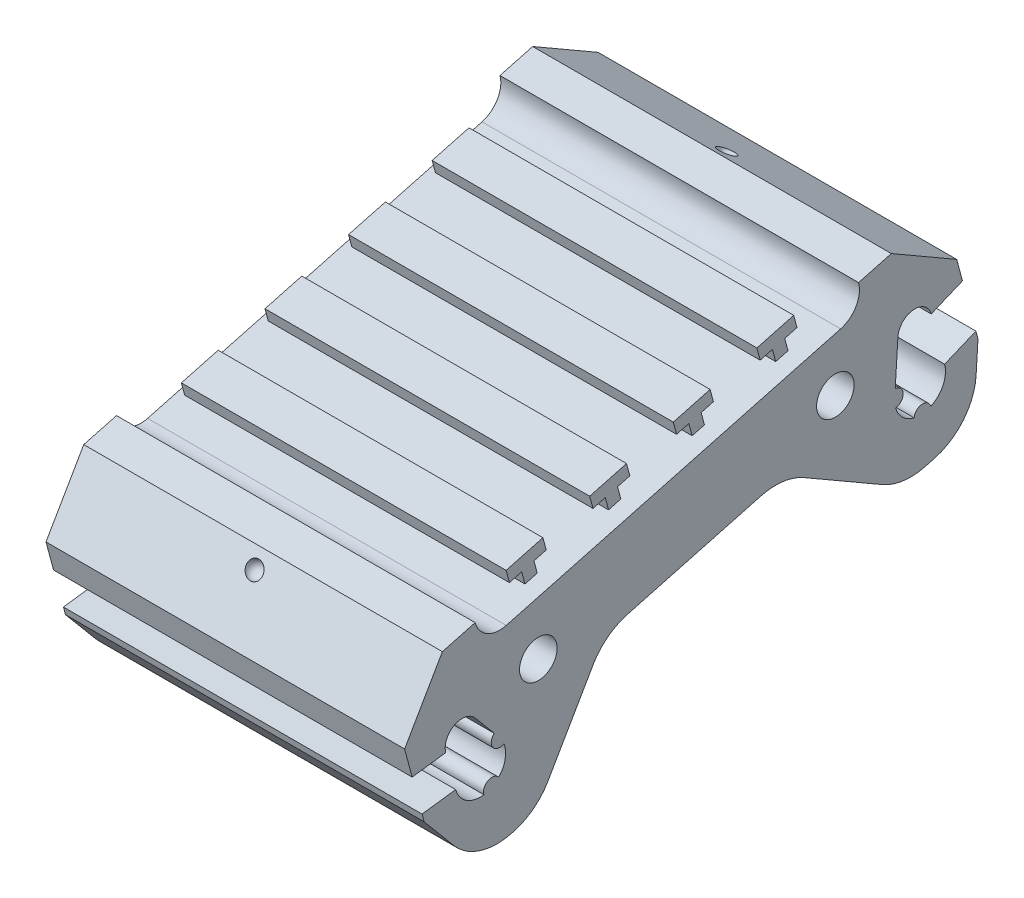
ISO-10303-21;
HEADER;
FILE_DESCRIPTION(('STEP AP214'),'2;1');
FILE_NAME('part.step','',(''),(''),'','','');
FILE_SCHEMA(('AUTOMOTIVE_DESIGN { 1 0 10303 214 1 1 1 1 }'));
ENDSEC;
DATA;
#1=APPLICATION_CONTEXT('core data for automotive mechanical design processes');
#2=APPLICATION_PROTOCOL_DEFINITION('international standard','automotive_design',2000,#1);
#3=PRODUCT_CONTEXT('',#1,'mechanical');
#4=PRODUCT('Part','Part','',(#3));
#5=PRODUCT_RELATED_PRODUCT_CATEGORY('part','',(#4));
#6=PRODUCT_DEFINITION_FORMATION('','',#4);
#7=PRODUCT_DEFINITION_CONTEXT('part definition',#1,'design');
#8=PRODUCT_DEFINITION('design','',#6,#7);
#9=PRODUCT_DEFINITION_SHAPE('','',#8);
#10=(LENGTH_UNIT() NAMED_UNIT(*) SI_UNIT(.MILLI.,.METRE.));
#11=(NAMED_UNIT(*) PLANE_ANGLE_UNIT() SI_UNIT($,.RADIAN.));
#12=(NAMED_UNIT(*) SI_UNIT($,.STERADIAN.) SOLID_ANGLE_UNIT());
#13=UNCERTAINTY_MEASURE_WITH_UNIT(LENGTH_MEASURE(1.E-05),#10,'distance_accuracy_value','');
#14=(GEOMETRIC_REPRESENTATION_CONTEXT(3) GLOBAL_UNCERTAINTY_ASSIGNED_CONTEXT((#13)) GLOBAL_UNIT_ASSIGNED_CONTEXT((#10,
#11,#12)) REPRESENTATION_CONTEXT('',''));
#15=CARTESIAN_POINT('',(0.,0.,0.));
#16=DIRECTION('',(0.,0.,1.));
#17=DIRECTION('',(1.,0.,0.));
#18=AXIS2_PLACEMENT_3D('',#15,#16,#17);
#19=CARTESIAN_POINT('',(-15.875,9.,11.375));
#20=DIRECTION('',(1.,0.,0.));
#21=DIRECTION('',(0.,1.,0.));
#22=AXIS2_PLACEMENT_3D('',#19,#20,#21);
#23=PLANE('',#22);
#24=DIRECTION('',(0.,0.258819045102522,-0.965925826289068));
#25=VECTOR('',#24,1.);
#26=CARTESIAN_POINT('',(-15.875,10.2596467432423,-20.942966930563));
#27=LINE('',#26,#25);
#28=CARTESIAN_POINT('',(-15.875,11.4831417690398,-25.5091125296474));
#29=VERTEX_POINT('',#28);
#30=CARTESIAN_POINT('',(-15.875,12.2595989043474,-28.4068900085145));
#31=VERTEX_POINT('',#30);
#32=EDGE_CURVE('E743',#29,#31,#27,.T.);
#33=ORIENTED_EDGE('',*,*,#32,.T.);
#34=CARTESIAN_POINT('',(-15.875,12.8419417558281,-30.580223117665));
#35=DIRECTION('',(1.,0.,0.));
#36=DIRECTION('',(0.,1.,0.));
#37=AXIS2_PLACEMENT_3D('',#34,#35,#36);
#38=CIRCLE('',#37,2.25000000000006);
#39=CARTESIAN_POINT('',(-15.875,10.6686086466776,-31.1625659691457));
#40=VERTEX_POINT('',#39);
#41=EDGE_CURVE('E793',#31,#40,#38,.T.);
#42=ORIENTED_EDGE('',*,*,#41,.T.);
#43=DIRECTION('',(0.,0.25881904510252,-0.965925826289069));
#44=VECTOR('',#43,1.);
#45=CARTESIAN_POINT('',(-15.875,-0.0775584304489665,8.94267554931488));
#46=LINE('',#45,#44);
#47=CARTESIAN_POINT('',(-15.875,18.6009511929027,-60.7664713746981));
#48=VERTEX_POINT('',#47);
#49=EDGE_CURVE('E790',#40,#48,#46,.T.);
#50=ORIENTED_EDGE('',*,*,#49,.T.);
#51=CARTESIAN_POINT('',(-15.875,20.7742843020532,-60.1841285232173));
#52=DIRECTION('',(1.,0.,0.));
#53=DIRECTION('',(0.,1.,0.));
#54=AXIS2_PLACEMENT_3D('',#51,#52,#53);
#55=CIRCLE('',#54,2.25000000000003);
#56=CARTESIAN_POINT('',(-15.875,21.3566271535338,-62.3574616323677));
#57=VERTEX_POINT('',#56);
#58=EDGE_CURVE('E801',#57,#48,#55,.F.);
#59=ORIENTED_EDGE('',*,*,#58,.F.);
#60=CARTESIAN_POINT('',(-15.875,22.1330842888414,-65.2552391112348));
#61=VERTEX_POINT('',#60);
#62=EDGE_CURVE('E47',#57,#61,#27,.T.);
#63=ORIENTED_EDGE('',*,*,#62,.T.);
#64=DIRECTION('',(0.,-0.500000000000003,-0.866025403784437));
#65=VECTOR('',#64,1.);
#66=CARTESIAN_POINT('',(-15.875,52.0316801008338,-13.4693520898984));
#67=LINE('',#66,#65);
#68=CARTESIAN_POINT('',(-15.875,18.7904337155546,-71.0448797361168));
#69=VERTEX_POINT('',#68);
#70=EDGE_CURVE('E626',#61,#69,#67,.T.);
#71=ORIENTED_EDGE('',*,*,#70,.T.);
#72=DIRECTION('',(0.,-0.965925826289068,-0.258819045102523));
#73=VECTOR('',#72,1.);
#74=CARTESIAN_POINT('',(-15.875,23.3565793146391,-69.8213847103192));
#75=LINE('',#74,#73);
#76=CARTESIAN_POINT('',(-15.875,16.8846693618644,-71.5555277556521));
#77=VERTEX_POINT('',#76);
#78=EDGE_CURVE('E741',#69,#77,#75,.T.);
#79=ORIENTED_EDGE('',*,*,#78,.T.);
#80=DIRECTION('',(0.,-0.382683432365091,0.923879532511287));
#81=VECTOR('',#80,1.);
#82=CARTESIAN_POINT('',(-15.875,-13.5903830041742,2.01775698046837));
#83=LINE('',#82,#81);
#84=CARTESIAN_POINT('',(-15.875,15.7366190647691,-68.7838891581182));
#85=VERTEX_POINT('',#84);
#86=EDGE_CURVE('E718',#77,#85,#83,.T.);
#87=ORIENTED_EDGE('',*,*,#86,.T.);
#88=CARTESIAN_POINT('',(-15.875,15.3483904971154,-67.3350004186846));
#89=DIRECTION('',(1.,0.,0.));
#90=DIRECTION('',(0.,1.,0.));
#91=AXIS2_PLACEMENT_3D('',#88,#89,#90);
#92=CIRCLE('',#91,1.50000000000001);
#93=CARTESIAN_POINT('',(-15.875,15.4405417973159,-65.8378337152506));
#94=VERTEX_POINT('',#93);
#95=EDGE_CURVE('E724',#85,#94,#92,.T.);
#96=ORIENTED_EDGE('',*,*,#95,.T.);
#97=DIRECTION('',(0.,-0.998111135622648,0.0614342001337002));
#98=VECTOR('',#97,1.);
#99=CARTESIAN_POINT('',(-15.875,4.28975880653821,-65.1514978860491));
#100=LINE('',#99,#98);
#101=CARTESIAN_POINT('',(-15.875,11.5982415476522,-65.6013383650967));
#102=VERTEX_POINT('',#101);
#103=EDGE_CURVE('E727',#94,#102,#100,.T.);
#104=ORIENTED_EDGE('',*,*,#103,.T.);
#105=CARTESIAN_POINT('',(-15.875,10.8496581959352,-65.5552627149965));
#106=DIRECTION('',(1.,0.,0.));
#107=DIRECTION('',(0.,1.,0.));
#108=AXIS2_PLACEMENT_3D('',#105,#106,#107);
#109=CIRCLE('',#108,0.749999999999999);
#110=CARTESIAN_POINT('',(-15.875,10.1038657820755,-65.6345954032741));
#111=VERTEX_POINT('',#110);
#112=EDGE_CURVE('E640',#102,#111,#109,.F.);
#113=ORIENTED_EDGE('',*,*,#112,.T.);
#114=CARTESIAN_POINT('',(-15.875,10.7114312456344,-67.8010127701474));
#115=DIRECTION('',(1.,0.,0.));
#116=DIRECTION('',(0.,1.,0.));
#117=AXIS2_PLACEMENT_3D('',#114,#115,#116);
#118=CIRCLE('',#117,2.25);
#119=CARTESIAN_POINT('',(-15.875,8.52313413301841,-67.277700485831));
#120=VERTEX_POINT('',#119);
#121=EDGE_CURVE('E731',#111,#120,#118,.T.);
#122=ORIENTED_EDGE('',*,*,#121,.T.);
#123=CARTESIAN_POINT('',(-15.875,8.47270857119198,-68.0260034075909));
#124=DIRECTION('',(1.,0.,0.));
#125=DIRECTION('',(0.,1.,0.));
#126=AXIS2_PLACEMENT_3D('',#123,#124,#125);
#127=CIRCLE('',#126,0.749999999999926);
#128=CARTESIAN_POINT('',(-15.875,8.67102997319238,-68.7493073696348));
#129=VERTEX_POINT('',#128);
#130=EDGE_CURVE('E649',#120,#129,#127,.F.);
#131=ORIENTED_EDGE('',*,*,#130,.T.);
#132=CARTESIAN_POINT('',(-15.875,11.2937740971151,-69.9743458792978));
#133=VERTEX_POINT('',#132);
#134=EDGE_CURVE('E730',#129,#133,#118,.T.);
#135=ORIENTED_EDGE('',*,*,#134,.T.);
#136=DIRECTION('',(0.,0.38268343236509,-0.923879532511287));
#137=VECTOR('',#136,1.);
#138=CARTESIAN_POINT('',(-15.875,-17.8034784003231,0.27263572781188));
#139=LINE('',#138,#137);
#140=CARTESIAN_POINT('',(-15.875,12.4418243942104,-72.7459844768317));
#141=VERTEX_POINT('',#140);
#142=EDGE_CURVE('E733',#133,#141,#139,.T.);
#143=ORIENTED_EDGE('',*,*,#142,.T.);
#144=DIRECTION('',(0.,-0.965925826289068,-0.25881904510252));
#145=VECTOR('',#144,1.);
#146=CARTESIAN_POINT('',(-15.875,30.2608046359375,-67.9714031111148));
#147=LINE('',#146,#145);
#148=CARTESIAN_POINT('',(-15.875,11.7598418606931,-72.9287211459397));
#149=VERTEX_POINT('',#148);
#150=EDGE_CURVE('E1239',#141,#149,#147,.T.);
#151=ORIENTED_EDGE('',*,*,#150,.T.);
#152=DIRECTION('',(0.,-0.998111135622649,0.0614342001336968));
#153=VECTOR('',#152,1.);
#154=CARTESIAN_POINT('',(-15.875,3.84106708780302,-72.441316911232));
#155=LINE('',#154,#153);
#156=CARTESIAN_POINT('',(-15.875,9.04137689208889,-72.7613983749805));
#157=VERTEX_POINT('',#156);
#158=EDGE_CURVE('E610',#149,#157,#155,.T.);
#159=ORIENTED_EDGE('',*,*,#158,.T.);
#160=CARTESIAN_POINT('',(-15.875,9.34854789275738,-67.7708426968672));
#161=DIRECTION('',(1.,0.,0.));
#162=DIRECTION('',(0.,1.,0.));
#163=AXIS2_PLACEMENT_3D('',#160,#161,#162);
#164=CIRCLE('',#163,5.);
#165=CARTESIAN_POINT('',(-15.875,4.51891876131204,-69.0649379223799));
#166=VERTEX_POINT('',#165);
#167=EDGE_CURVE('E836',#157,#166,#164,.F.);
#168=ORIENTED_EDGE('',*,*,#167,.T.);
#169=DIRECTION('',(0.,-0.258819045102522,0.965925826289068));
#170=VECTOR('',#169,1.);
#171=CARTESIAN_POINT('',(-15.875,-7.12701812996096,-25.6017097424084));
#172=LINE('',#171,#170);
#173=CARTESIAN_POINT('',(-15.875,4.30598435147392,-68.2702558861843));
#174=VERTEX_POINT('',#173);
#175=EDGE_CURVE('E740',#166,#174,#172,.T.);
#176=ORIENTED_EDGE('',*,*,#175,.T.);
#177=CARTESIAN_POINT('',(-15.875,9.13561348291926,-66.9761606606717));
#178=DIRECTION('',(1.,0.,0.));
#179=DIRECTION('',(0.,1.,0.));
#180=AXIS2_PLACEMENT_3D('',#177,#178,#179);
#181=CIRCLE('',#180,5.);
#182=CARTESIAN_POINT('',(-15.875,4.80548646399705,-64.4761606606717));
#183=VERTEX_POINT('',#182);
#184=EDGE_CURVE('E877',#174,#183,#181,.F.);
#185=ORIENTED_EDGE('',*,*,#184,.T.);
#186=DIRECTION('',(0.,0.499999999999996,0.866025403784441));
#187=VECTOR('',#186,1.);
#188=CARTESIAN_POINT('',(-15.875,38.6986308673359,-5.77151252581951));
#189=LINE('',#188,#187);
#190=CARTESIAN_POINT('',(-15.875,8.82149181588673,-57.5202353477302));
#191=VERTEX_POINT('',#190);
#192=EDGE_CURVE('E812',#183,#191,#189,.T.);
#193=ORIENTED_EDGE('',*,*,#192,.T.);
#194=CARTESIAN_POINT('',(-15.875,4.49136479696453,-55.0202353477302));
#195=DIRECTION('',(1.,0.,0.));
#196=DIRECTION('',(0.,1.,0.));
#197=AXIS2_PLACEMENT_3D('',#194,#195,#196);
#198=CIRCLE('',#197,5.);
#199=CARTESIAN_POINT('',(-15.875,9.32099392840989,-53.7261401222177));
#200=VERTEX_POINT('',#199);
#201=EDGE_CURVE('E852',#191,#200,#198,.T.);
#202=ORIENTED_EDGE('',*,*,#201,.T.);
#203=DIRECTION('',(0.,-0.258819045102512,0.965925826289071));
#204=VECTOR('',#203,1.);
#205=CARTESIAN_POINT('',(-15.875,-6.97579361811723,7.09429900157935));
#206=LINE('',#205,#204);
#207=CARTESIAN_POINT('',(-15.875,6.15209553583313,-41.8996503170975));
#208=VERTEX_POINT('',#207);
#209=EDGE_CURVE('E817',#200,#208,#206,.T.);
#210=ORIENTED_EDGE('',*,*,#209,.T.);
#211=CARTESIAN_POINT('',(-15.875,1.32246640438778,-43.19374554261));
#212=DIRECTION('',(1.,0.,0.));
#213=DIRECTION('',(0.,1.,0.));
#214=AXIS2_PLACEMENT_3D('',#211,#212,#213);
#215=CIRCLE('',#214,5.);
#216=CARTESIAN_POINT('',(-15.875,3.82246640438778,-38.8636185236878));
#217=VERTEX_POINT('',#216);
#218=EDGE_CURVE('E856',#208,#217,#215,.T.);
#219=ORIENTED_EDGE('',*,*,#218,.T.);
#220=DIRECTION('',(0.,-0.866025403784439,0.5));
#221=VECTOR('',#220,1.);
#222=CARTESIAN_POINT('',(-15.875,-14.0483433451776,-28.5459017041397));
#223=LINE('',#222,#221);
#224=CARTESIAN_POINT('',(-15.875,-3.13345890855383,-34.8476131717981));
#225=VERTEX_POINT('',#224);
#226=EDGE_CURVE('E815',#217,#225,#223,.T.);
#227=ORIENTED_EDGE('',*,*,#226,.T.);
#228=CARTESIAN_POINT('',(-15.875,-0.633458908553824,-30.5174861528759));
#229=DIRECTION('',(1.,0.,0.));
#230=DIRECTION('',(0.,1.,0.));
#231=AXIS2_PLACEMENT_3D('',#228,#229,#230);
#232=CIRCLE('',#231,5.);
#233=CARTESIAN_POINT('',(-15.875,-5.46308803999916,-31.8115813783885));
#234=VERTEX_POINT('',#233);
#235=EDGE_CURVE('E873',#225,#234,#232,.F.);
#236=ORIENTED_EDGE('',*,*,#235,.T.);
#237=CARTESIAN_POINT('',(-15.875,-5.5069730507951,-31.6478002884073));
#238=VERTEX_POINT('',#237);
#239=EDGE_CURVE('E737',#234,#238,#172,.T.);
#240=ORIENTED_EDGE('',*,*,#239,.T.);
#241=CARTESIAN_POINT('',(-15.875,-0.677343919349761,-30.3537050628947));
#242=DIRECTION('',(1.,0.,0.));
#243=DIRECTION('',(0.,1.,0.));
#244=AXIS2_PLACEMENT_3D('',#241,#242,#243);
#245=CIRCLE('',#244,5.);
#246=CARTESIAN_POINT('',(-15.875,-3.88843318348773,-26.5210942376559));
#247=VERTEX_POINT('',#246);
#248=EDGE_CURVE('E588',#238,#247,#245,.F.);
#249=ORIENTED_EDGE('',*,*,#248,.T.);
#250=DIRECTION('',(0.,0.766522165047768,0.642217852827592));
#251=VECTOR('',#250,1.);
#252=CARTESIAN_POINT('',(-15.875,22.3395162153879,-4.54644286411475));
#253=LINE('',#252,#251);
#254=CARTESIAN_POINT('',(-15.8750025,-0.752426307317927,-23.8936430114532));
#255=VERTEX_POINT('',#254);
#256=EDGE_CURVE('E589',#247,#255,#253,.T.);
#257=ORIENTED_EDGE('',*,*,#256,.T.);
#258=DIRECTION('',(0.,-0.965925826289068,-0.258819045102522));
#259=VECTOR('',#258,1.);
#260=CARTESIAN_POINT('',(-15.875,17.1638720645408,-19.0929853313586));
#261=LINE('',#260,#259);
#262=CARTESIAN_POINT('',(-15.875,-0.0704437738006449,-23.7109063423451));
#263=VERTEX_POINT('',#262);
#264=EDGE_CURVE('E1230',#263,#255,#261,.T.);
#265=ORIENTED_EDGE('',*,*,#264,.F.);
#266=DIRECTION('',(0.,0.130526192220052,-0.99144486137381));
#267=VECTOR('',#266,1.);
#268=CARTESIAN_POINT('',(-15.875,-4.4563602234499,9.60343656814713));
#269=LINE('',#268,#267);
#270=CARTESIAN_POINT('',(-15.875,0.321134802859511,-26.6852409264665));
#271=VERTEX_POINT('',#270);
#272=EDGE_CURVE('E681',#263,#271,#269,.T.);
#273=ORIENTED_EDGE('',*,*,#272,.T.);
#274=CARTESIAN_POINT('',(-15.875,0.903477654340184,-28.8585740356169));
#275=DIRECTION('',(1.,0.,0.));
#276=DIRECTION('',(0.,1.,0.));
#277=AXIS2_PLACEMENT_3D('',#274,#275,#276);
#278=CIRCLE('',#277,2.25);
#279=CARTESIAN_POINT('',(-15.875,-1.32300883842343,-29.1830087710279));
#280=VERTEX_POINT('',#279);
#281=EDGE_CURVE('E689',#271,#280,#278,.T.);
#282=ORIENTED_EDGE('',*,*,#281,.T.);
#283=CARTESIAN_POINT('',(-15.875,-1.09268282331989,-29.8967663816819));
#284=DIRECTION('',(1.,0.,0.));
#285=DIRECTION('',(0.,1.,0.));
#286=AXIS2_PLACEMENT_3D('',#283,#284,#285);
#287=CIRCLE('',#286,0.749999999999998);
#288=CARTESIAN_POINT('',(-15.875,-0.64056119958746,-30.4951692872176));
#289=VERTEX_POINT('',#288);
#290=EDGE_CURVE('E662',#280,#289,#287,.F.);
#291=ORIENTED_EDGE('',*,*,#290,.T.);
#292=CARTESIAN_POINT('',(-15.875,1.70133980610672,-30.9623601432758));
#293=VERTEX_POINT('',#292);
#294=EDGE_CURVE('E688',#289,#293,#278,.T.);
#295=ORIENTED_EDGE('',*,*,#294,.T.);
#296=CARTESIAN_POINT('',(-15.875,2.34846782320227,-30.5832489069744));
#297=DIRECTION('',(1.,0.,0.));
#298=DIRECTION('',(0.,1.,0.));
#299=AXIS2_PLACEMENT_3D('',#296,#297,#298);
#300=CIRCLE('',#299,0.749999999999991);
#301=CARTESIAN_POINT('',(-15.875,2.92335944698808,-30.1015855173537));
#302=VERTEX_POINT('',#301);
#303=EDGE_CURVE('E654',#293,#302,#300,.F.);
#304=ORIENTED_EDGE('',*,*,#303,.T.);
#305=DIRECTION('',(0.,0.766522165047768,0.642217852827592));
#306=VECTOR('',#305,1.);
#307=CARTESIAN_POINT('',(-15.875,26.9115811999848,-10.0034527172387));
#308=LINE('',#307,#306);
#309=CARTESIAN_POINT('',(-15.875,4.94620631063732,-28.406776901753));
#310=VERTEX_POINT('',#309);
#311=EDGE_CURVE('E692',#302,#310,#308,.T.);
#312=ORIENTED_EDGE('',*,*,#311,.T.);
#313=CARTESIAN_POINT('',(-15.875,3.98287953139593,-27.2569936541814));
#314=DIRECTION('',(1.,0.,0.));
#315=DIRECTION('',(0.,1.,0.));
#316=AXIS2_PLACEMENT_3D('',#313,#314,#315);
#317=CIRCLE('',#316,1.5);
#318=CARTESIAN_POINT('',(-15.875,3.59465096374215,-25.8081049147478));
#319=VERTEX_POINT('',#318);
#320=EDGE_CURVE('E694',#310,#319,#317,.T.);
#321=ORIENTED_EDGE('',*,*,#320,.T.);
#322=DIRECTION('',(0.,-0.130526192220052,0.99144486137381));
#323=VECTOR('',#322,1.);
#324=CARTESIAN_POINT('',(-15.875,-1.12510548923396,10.0420045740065));
#325=LINE('',#324,#323);
#326=CARTESIAN_POINT('',(-15.875,3.20307238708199,-22.8337703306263));
#327=VERTEX_POINT('',#326);
#328=EDGE_CURVE('E697',#319,#327,#325,.T.);
#329=ORIENTED_EDGE('',*,*,#328,.T.);
#330=DIRECTION('',(0.,0.965925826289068,0.258819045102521));
#331=VECTOR('',#330,1.);
#332=CARTESIAN_POINT('',(-15.875,3.88505492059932,-22.6510336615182));
#333=LINE('',#332,#331);
#334=CARTESIAN_POINT('',(-15.875,5.69350114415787,-22.1664619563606));
#335=VERTEX_POINT('',#334);
#336=EDGE_CURVE('E745',#327,#335,#333,.T.);
#337=ORIENTED_EDGE('',*,*,#336,.T.);
#338=DIRECTION('',(0.,0.866025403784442,-0.499999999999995));
#339=VECTOR('',#338,1.);
#340=CARTESIAN_POINT('',(-15.875,-6.35050378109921,-15.2128524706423));
#341=LINE('',#340,#339);
#342=EDGE_CURVE('E634',#335,#29,#341,.T.);
#343=ORIENTED_EDGE('',*,*,#342,.T.);
#344=EDGE_LOOP('',(#33,#42,#50,#59,#63,#71,#79,#87,#96,#104,#113,#122,#131,#135,#143,#151,#159,
#168,#176,#185,#193,#202,#210,#219,#227,#236,#240,#249,#257,#265,#273,#282,#291,#295,#304,#312,
#321,#329,#337,#343));
#345=FACE_BOUND('',#344,.T.);
#346=CARTESIAN_POINT('',(-15.875,6.68032637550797,-34.0028328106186));
#347=DIRECTION('',(1.,0.,0.));
#348=DIRECTION('',(0.,1.,0.));
#349=AXIS2_PLACEMENT_3D('',#346,#347,#348);
#350=CIRCLE('',#349,1.66250000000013);
#351=CARTESIAN_POINT('',(-15.875,8.3428263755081,-34.0028328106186));
#352=VERTEX_POINT('',#351);
#353=EDGE_CURVE('E1183',#352,#352,#350,.T.);
#354=ORIENTED_EDGE('',*,*,#353,.T.);
#355=EDGE_LOOP('',(#354));
#356=FACE_BOUND('',#355,.T.);
#357=CARTESIAN_POINT('',(-15.875,13.7268640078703,-60.3008692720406));
#358=DIRECTION('',(1.,0.,0.));
#359=DIRECTION('',(0.,1.,0.));
#360=AXIS2_PLACEMENT_3D('',#357,#358,#359);
#361=CIRCLE('',#360,1.66249999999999);
#362=CARTESIAN_POINT('',(-15.875,15.3893640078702,-60.3008692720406));
#363=VERTEX_POINT('',#362);
#364=EDGE_CURVE('E1213',#363,#363,#361,.T.);
#365=ORIENTED_EDGE('',*,*,#364,.T.);
#366=EDGE_LOOP('',(#365));
#367=FACE_BOUND('',#366,.T.);
#368=ADVANCED_FACE('F32',(#345,#356,#367),#23,.F.);
#369=CARTESIAN_POINT('',(15.875,9.,11.375));
#370=DIRECTION('',(-1.,0.,0.));
#371=DIRECTION('',(0.,-1.,0.));
#372=AXIS2_PLACEMENT_3D('',#369,#370,#371);
#373=PLANE('',#372);
#374=DIRECTION('',(0.,-0.258819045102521,0.965925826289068));
#375=VECTOR('',#374,1.);
#376=CARTESIAN_POINT('',(15.875,10.2596467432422,-20.942966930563));
#377=LINE('',#376,#375);
#378=CARTESIAN_POINT('',(15.875,22.1330842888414,-65.2552391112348));
#379=VERTEX_POINT('',#378);
#380=CARTESIAN_POINT('',(15.875,21.3566271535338,-62.3574616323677));
#381=VERTEX_POINT('',#380);
#382=EDGE_CURVE('E543',#379,#381,#377,.T.);
#383=ORIENTED_EDGE('',*,*,#382,.T.);
#384=CARTESIAN_POINT('',(15.875,20.7742843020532,-60.1841285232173));
#385=DIRECTION('',(-1.,0.,0.));
#386=DIRECTION('',(0.,-1.,0.));
#387=AXIS2_PLACEMENT_3D('',#384,#385,#386);
#388=CIRCLE('',#387,2.25000000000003);
#389=CARTESIAN_POINT('',(15.875,18.6009511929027,-60.7664713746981));
#390=VERTEX_POINT('',#389);
#391=EDGE_CURVE('E548',#390,#381,#388,.F.);
#392=ORIENTED_EDGE('',*,*,#391,.F.);
#393=DIRECTION('',(0.,-0.25881904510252,0.965925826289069));
#394=VECTOR('',#393,1.);
#395=CARTESIAN_POINT('',(15.875,-0.0775584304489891,8.94267554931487));
#396=LINE('',#395,#394);
#397=CARTESIAN_POINT('',(15.875,10.6686086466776,-31.1625659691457));
#398=VERTEX_POINT('',#397);
#399=EDGE_CURVE('E565',#390,#398,#396,.T.);
#400=ORIENTED_EDGE('',*,*,#399,.T.);
#401=CARTESIAN_POINT('',(15.875,12.8419417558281,-30.580223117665));
#402=DIRECTION('',(-1.,0.,0.));
#403=DIRECTION('',(0.,-1.,0.));
#404=AXIS2_PLACEMENT_3D('',#401,#402,#403);
#405=CIRCLE('',#404,2.25000000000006);
#406=CARTESIAN_POINT('',(15.875,12.2595989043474,-28.4068900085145));
#407=VERTEX_POINT('',#406);
#408=EDGE_CURVE('E569',#398,#407,#405,.T.);
#409=ORIENTED_EDGE('',*,*,#408,.T.);
#410=CARTESIAN_POINT('',(15.875,11.4831417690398,-25.5091125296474));
#411=VERTEX_POINT('',#410);
#412=EDGE_CURVE('E55',#407,#411,#377,.T.);
#413=ORIENTED_EDGE('',*,*,#412,.T.);
#414=DIRECTION('',(0.,0.866025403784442,-0.499999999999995));
#415=VECTOR('',#414,1.);
#416=CARTESIAN_POINT('',(15.875,5.69350114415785,-22.1664619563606));
#417=LINE('',#416,#415);
#418=CARTESIAN_POINT('',(15.875,5.69350114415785,-22.1664619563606));
#419=VERTEX_POINT('',#418);
#420=EDGE_CURVE('E629',#419,#411,#417,.T.);
#421=ORIENTED_EDGE('',*,*,#420,.F.);
#422=DIRECTION('',(0.,-0.965925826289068,-0.258819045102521));
#423=VECTOR('',#422,1.);
#424=CARTESIAN_POINT('',(15.875,3.8850549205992,-22.6510336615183));
#425=LINE('',#424,#423);
#426=CARTESIAN_POINT('',(15.875,3.20307238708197,-22.8337703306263));
#427=VERTEX_POINT('',#426);
#428=EDGE_CURVE('E551',#419,#427,#425,.T.);
#429=ORIENTED_EDGE('',*,*,#428,.T.);
#430=DIRECTION('',(0.,-0.130526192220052,0.99144486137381));
#431=VECTOR('',#430,1.);
#432=CARTESIAN_POINT('',(15.875,1.69449665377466,-11.375));
#433=LINE('',#432,#431);
#434=CARTESIAN_POINT('',(15.875,3.59465096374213,-25.8081049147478));
#435=VERTEX_POINT('',#434);
#436=EDGE_CURVE('E675',#435,#427,#433,.T.);
#437=ORIENTED_EDGE('',*,*,#436,.F.);
#438=CARTESIAN_POINT('',(15.875,3.98287953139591,-27.2569936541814));
#439=DIRECTION('',(1.,0.,0.));
#440=DIRECTION('',(0.,-1.,0.));
#441=AXIS2_PLACEMENT_3D('',#438,#439,#440);
#442=CIRCLE('',#441,1.5);
#443=CARTESIAN_POINT('',(15.875,4.9462063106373,-28.406776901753));
#444=VERTEX_POINT('',#443);
#445=EDGE_CURVE('E672',#444,#435,#442,.T.);
#446=ORIENTED_EDGE('',*,*,#445,.F.);
#447=DIRECTION('',(0.,0.766522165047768,0.642217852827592));
#448=VECTOR('',#447,1.);
#449=CARTESIAN_POINT('',(15.875,4.9462063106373,-28.406776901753));
#450=LINE('',#449,#448);
#451=CARTESIAN_POINT('',(15.875,2.92335944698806,-30.1015855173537));
#452=VERTEX_POINT('',#451);
#453=EDGE_CURVE('E670',#452,#444,#450,.T.);
#454=ORIENTED_EDGE('',*,*,#453,.F.);
#455=CARTESIAN_POINT('',(15.875,2.34846782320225,-30.5832489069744));
#456=DIRECTION('',(1.,0.,0.));
#457=DIRECTION('',(0.,-1.,0.));
#458=AXIS2_PLACEMENT_3D('',#455,#456,#457);
#459=CIRCLE('',#458,0.749999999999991);
#460=CARTESIAN_POINT('',(15.875,1.7013398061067,-30.9623601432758));
#461=VERTEX_POINT('',#460);
#462=EDGE_CURVE('E651',#452,#461,#459,.T.);
#463=ORIENTED_EDGE('',*,*,#462,.T.);
#464=CARTESIAN_POINT('',(15.875,0.903477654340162,-28.8585740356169));
#465=DIRECTION('',(1.,0.,0.));
#466=DIRECTION('',(0.,1.,0.));
#467=AXIS2_PLACEMENT_3D('',#464,#465,#466);
#468=CIRCLE('',#467,2.25);
#469=CARTESIAN_POINT('',(15.875,-0.640561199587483,-30.4951692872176));
#470=VERTEX_POINT('',#469);
#471=EDGE_CURVE('E666',#470,#461,#468,.T.);
#472=ORIENTED_EDGE('',*,*,#471,.F.);
#473=CARTESIAN_POINT('',(15.875,-1.09268282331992,-29.8967663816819));
#474=DIRECTION('',(1.,0.,0.));
#475=DIRECTION('',(0.,-1.,0.));
#476=AXIS2_PLACEMENT_3D('',#473,#474,#475);
#477=CIRCLE('',#476,0.749999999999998);
#478=CARTESIAN_POINT('',(15.875,-1.32300883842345,-29.1830087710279));
#479=VERTEX_POINT('',#478);
#480=EDGE_CURVE('E659',#470,#479,#477,.T.);
#481=ORIENTED_EDGE('',*,*,#480,.T.);
#482=CARTESIAN_POINT('',(15.875,0.32113480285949,-26.6852409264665));
#483=VERTEX_POINT('',#482);
#484=EDGE_CURVE('E667',#483,#479,#468,.T.);
#485=ORIENTED_EDGE('',*,*,#484,.F.);
#486=DIRECTION('',(0.,0.130526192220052,-0.99144486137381));
#487=VECTOR('',#486,1.);
#488=CARTESIAN_POINT('',(15.875,-0.070443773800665,-23.7109063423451));
#489=LINE('',#488,#487);
#490=CARTESIAN_POINT('',(15.875,-0.0704437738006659,-23.7109063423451));
#491=VERTEX_POINT('',#490);
#492=EDGE_CURVE('E664',#491,#483,#489,.T.);
#493=ORIENTED_EDGE('',*,*,#492,.F.);
#494=DIRECTION('',(0.,-0.965925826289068,-0.258819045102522));
#495=VECTOR('',#494,1.);
#496=CARTESIAN_POINT('',(15.875,5.92300774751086,-22.1049658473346));
#497=LINE('',#496,#495);
#498=CARTESIAN_POINT('',(15.875,-0.75242630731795,-23.8936430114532));
#499=VERTEX_POINT('',#498);
#500=EDGE_CURVE('E1236',#491,#499,#497,.T.);
#501=ORIENTED_EDGE('',*,*,#500,.T.);
#502=DIRECTION('',(0.,0.766522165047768,0.642217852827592));
#503=VECTOR('',#502,1.);
#504=CARTESIAN_POINT('',(15.875,-0.752426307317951,-23.8936430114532));
#505=LINE('',#504,#503);
#506=CARTESIAN_POINT('',(15.875,-3.88843318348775,-26.5210942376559));
#507=VERTEX_POINT('',#506);
#508=EDGE_CURVE('E594',#507,#499,#505,.T.);
#509=ORIENTED_EDGE('',*,*,#508,.F.);
#510=CARTESIAN_POINT('',(15.875,-0.677343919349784,-30.3537050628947));
#511=DIRECTION('',(-1.,0.,0.));
#512=DIRECTION('',(0.,-1.,0.));
#513=AXIS2_PLACEMENT_3D('',#510,#511,#512);
#514=CIRCLE('',#513,5.);
#515=CARTESIAN_POINT('',(15.875,-5.50697305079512,-31.6478002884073));
#516=VERTEX_POINT('',#515);
#517=EDGE_CURVE('E580',#507,#516,#514,.F.);
#518=ORIENTED_EDGE('',*,*,#517,.T.);
#519=DIRECTION('',(0.,0.258819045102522,-0.965925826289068));
#520=VECTOR('',#519,1.);
#521=CARTESIAN_POINT('',(15.875,-7.12701812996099,-25.6017097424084));
#522=LINE('',#521,#520);
#523=CARTESIAN_POINT('',(15.875,-5.46308803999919,-31.8115813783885));
#524=VERTEX_POINT('',#523);
#525=EDGE_CURVE('E751',#516,#524,#522,.T.);
#526=ORIENTED_EDGE('',*,*,#525,.T.);
#527=CARTESIAN_POINT('',(15.875,-0.633458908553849,-30.5174861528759));
#528=DIRECTION('',(-1.,0.,0.));
#529=DIRECTION('',(0.,-1.,0.));
#530=AXIS2_PLACEMENT_3D('',#527,#528,#529);
#531=CIRCLE('',#530,5.);
#532=CARTESIAN_POINT('',(15.875,-3.13345890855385,-34.8476131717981));
#533=VERTEX_POINT('',#532);
#534=EDGE_CURVE('E586',#524,#533,#531,.F.);
#535=ORIENTED_EDGE('',*,*,#534,.T.);
#536=DIRECTION('',(0.,-0.866025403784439,0.5));
#537=VECTOR('',#536,1.);
#538=CARTESIAN_POINT('',(15.875,-4.92705624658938,-33.8120792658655));
#539=LINE('',#538,#537);
#540=CARTESIAN_POINT('',(15.875,3.82246640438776,-38.8636185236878));
#541=VERTEX_POINT('',#540);
#542=EDGE_CURVE('E809',#541,#533,#539,.T.);
#543=ORIENTED_EDGE('',*,*,#542,.F.);
#544=CARTESIAN_POINT('',(15.875,1.32246640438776,-43.19374554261));
#545=DIRECTION('',(-1.,0.,0.));
#546=DIRECTION('',(0.,-1.,0.));
#547=AXIS2_PLACEMENT_3D('',#544,#545,#546);
#548=CIRCLE('',#547,5.);
#549=CARTESIAN_POINT('',(15.875,6.15209553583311,-41.8996503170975));
#550=VERTEX_POINT('',#549);
#551=EDGE_CURVE('E40',#541,#550,#548,.T.);
#552=ORIENTED_EDGE('',*,*,#551,.T.);
#553=DIRECTION('',(0.,-0.258819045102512,0.965925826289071));
#554=VECTOR('',#553,1.);
#555=CARTESIAN_POINT('',(15.875,5.61606374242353,-39.8991524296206));
#556=LINE('',#555,#554);
#557=CARTESIAN_POINT('',(15.875,9.32099392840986,-53.7261401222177));
#558=VERTEX_POINT('',#557);
#559=EDGE_CURVE('E806',#558,#550,#556,.T.);
#560=ORIENTED_EDGE('',*,*,#559,.F.);
#561=CARTESIAN_POINT('',(15.875,4.49136479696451,-55.0202353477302));
#562=DIRECTION('',(-1.,0.,0.));
#563=DIRECTION('',(0.,-1.,0.));
#564=AXIS2_PLACEMENT_3D('',#561,#562,#563);
#565=CIRCLE('',#564,5.);
#566=CARTESIAN_POINT('',(15.875,8.82149181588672,-57.5202353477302));
#567=VERTEX_POINT('',#566);
#568=EDGE_CURVE('E841',#558,#567,#565,.T.);
#569=ORIENTED_EDGE('',*,*,#568,.T.);
#570=DIRECTION('',(0.,0.499999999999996,0.866025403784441));
#571=VECTOR('',#570,1.);
#572=CARTESIAN_POINT('',(15.875,3.76995255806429,-66.2697579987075));
#573=LINE('',#572,#571);
#574=CARTESIAN_POINT('',(15.875,4.80548646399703,-64.4761606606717));
#575=VERTEX_POINT('',#574);
#576=EDGE_CURVE('E803',#575,#567,#573,.T.);
#577=ORIENTED_EDGE('',*,*,#576,.F.);
#578=CARTESIAN_POINT('',(15.875,9.13561348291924,-66.9761606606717));
#579=DIRECTION('',(-1.,0.,0.));
#580=DIRECTION('',(0.,-1.,0.));
#581=AXIS2_PLACEMENT_3D('',#578,#579,#580);
#582=CIRCLE('',#581,5.);
#583=CARTESIAN_POINT('',(15.875,4.30598435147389,-68.2702558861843));
#584=VERTEX_POINT('',#583);
#585=EDGE_CURVE('E584',#575,#584,#582,.F.);
#586=ORIENTED_EDGE('',*,*,#585,.T.);
#587=CARTESIAN_POINT('',(15.875,4.51891876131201,-69.0649379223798));
#588=VERTEX_POINT('',#587);
#589=EDGE_CURVE('E736',#584,#588,#522,.T.);
#590=ORIENTED_EDGE('',*,*,#589,.T.);
#591=CARTESIAN_POINT('',(15.875,9.34854789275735,-67.7708426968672));
#592=DIRECTION('',(-1.,0.,0.));
#593=DIRECTION('',(0.,-1.,0.));
#594=AXIS2_PLACEMENT_3D('',#591,#592,#593);
#595=CIRCLE('',#594,5.);
#596=CARTESIAN_POINT('',(15.875,9.04137689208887,-72.7613983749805));
#597=VERTEX_POINT('',#596);
#598=EDGE_CURVE('E582',#588,#597,#595,.F.);
#599=ORIENTED_EDGE('',*,*,#598,.T.);
#600=DIRECTION('',(0.,-0.998111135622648,0.0614342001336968));
#601=VECTOR('',#600,1.);
#602=CARTESIAN_POINT('',(15.875,11.7598418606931,-72.9287211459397));
#603=LINE('',#602,#601);
#604=CARTESIAN_POINT('',(15.875,11.7598418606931,-72.9287211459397));
#605=VERTEX_POINT('',#604);
#606=EDGE_CURVE('E614',#605,#597,#603,.T.);
#607=ORIENTED_EDGE('',*,*,#606,.F.);
#608=DIRECTION('',(0.,-0.965925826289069,-0.25881904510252));
#609=VECTOR('',#608,1.);
#610=CARTESIAN_POINT('',(15.875,19.0199403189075,-70.9833836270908));
#611=LINE('',#610,#609);
#612=CARTESIAN_POINT('',(15.875,12.4418243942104,-72.7459844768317));
#613=VERTEX_POINT('',#612);
#614=EDGE_CURVE('E557',#613,#605,#611,.T.);
#615=ORIENTED_EDGE('',*,*,#614,.F.);
#616=DIRECTION('',(0.,0.38268343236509,-0.923879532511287));
#617=VECTOR('',#616,1.);
#618=CARTESIAN_POINT('',(15.875,17.2858812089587,-84.4405721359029));
#619=LINE('',#618,#617);
#620=CARTESIAN_POINT('',(15.875,11.2937740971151,-69.9743458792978));
#621=VERTEX_POINT('',#620);
#622=EDGE_CURVE('E711',#621,#613,#619,.T.);
#623=ORIENTED_EDGE('',*,*,#622,.F.);
#624=CARTESIAN_POINT('',(15.875,10.7114312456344,-67.8010127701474));
#625=DIRECTION('',(1.,0.,0.));
#626=DIRECTION('',(0.,-1.,0.));
#627=AXIS2_PLACEMENT_3D('',#624,#625,#626);
#628=CIRCLE('',#627,2.25);
#629=CARTESIAN_POINT('',(15.875,8.67102997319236,-68.7493073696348));
#630=VERTEX_POINT('',#629);
#631=EDGE_CURVE('E708',#630,#621,#628,.T.);
#632=ORIENTED_EDGE('',*,*,#631,.F.);
#633=CARTESIAN_POINT('',(15.875,8.47270857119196,-68.0260034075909));
#634=DIRECTION('',(1.,0.,0.));
#635=DIRECTION('',(0.,1.,0.));
#636=AXIS2_PLACEMENT_3D('',#633,#634,#635);
#637=CIRCLE('',#636,0.749999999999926);
#638=CARTESIAN_POINT('',(15.875,8.52313413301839,-67.277700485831));
#639=VERTEX_POINT('',#638);
#640=EDGE_CURVE('E646',#630,#639,#637,.T.);
#641=ORIENTED_EDGE('',*,*,#640,.T.);
#642=CARTESIAN_POINT('',(15.875,10.1038657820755,-65.6345954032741));
#643=VERTEX_POINT('',#642);
#644=EDGE_CURVE('E709',#643,#639,#628,.T.);
#645=ORIENTED_EDGE('',*,*,#644,.F.);
#646=CARTESIAN_POINT('',(15.875,10.8496581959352,-65.5552627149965));
#647=DIRECTION('',(1.,0.,0.));
#648=DIRECTION('',(0.,1.,0.));
#649=AXIS2_PLACEMENT_3D('',#646,#647,#648);
#650=CIRCLE('',#649,0.749999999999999);
#651=CARTESIAN_POINT('',(15.875,11.5982415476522,-65.6013383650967));
#652=VERTEX_POINT('',#651);
#653=EDGE_CURVE('E637',#643,#652,#650,.T.);
#654=ORIENTED_EDGE('',*,*,#653,.T.);
#655=DIRECTION('',(0.,-0.998111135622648,0.0614342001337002));
#656=VECTOR('',#655,1.);
#657=CARTESIAN_POINT('',(15.875,15.4405417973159,-65.8378337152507));
#658=LINE('',#657,#656);
#659=CARTESIAN_POINT('',(15.875,15.4405417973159,-65.8378337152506));
#660=VERTEX_POINT('',#659);
#661=EDGE_CURVE('E705',#660,#652,#658,.T.);
#662=ORIENTED_EDGE('',*,*,#661,.F.);
#663=CARTESIAN_POINT('',(15.875,15.3483904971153,-67.3350004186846));
#664=DIRECTION('',(1.,0.,0.));
#665=DIRECTION('',(0.,1.,0.));
#666=AXIS2_PLACEMENT_3D('',#663,#664,#665);
#667=CIRCLE('',#666,1.50000000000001);
#668=CARTESIAN_POINT('',(15.875,15.7366190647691,-68.7838891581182));
#669=VERTEX_POINT('',#668);
#670=EDGE_CURVE('E702',#669,#660,#667,.T.);
#671=ORIENTED_EDGE('',*,*,#670,.F.);
#672=DIRECTION('',(0.,-0.382683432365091,0.923879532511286));
#673=VECTOR('',#672,1.);
#674=CARTESIAN_POINT('',(15.875,16.8846693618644,-71.5555277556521));
#675=LINE('',#674,#673);
#676=CARTESIAN_POINT('',(15.875,16.8846693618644,-71.5555277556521));
#677=VERTEX_POINT('',#676);
#678=EDGE_CURVE('E700',#677,#669,#675,.T.);
#679=ORIENTED_EDGE('',*,*,#678,.F.);
#680=DIRECTION('',(0.,0.965925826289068,0.258819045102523));
#681=VECTOR('',#680,1.);
#682=CARTESIAN_POINT('',(15.875,23.356579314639,-69.8213847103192));
#683=LINE('',#682,#681);
#684=CARTESIAN_POINT('',(15.875,18.7904337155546,-71.0448797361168));
#685=VERTEX_POINT('',#684);
#686=EDGE_CURVE('E752',#677,#685,#683,.T.);
#687=ORIENTED_EDGE('',*,*,#686,.T.);
#688=DIRECTION('',(0.,-0.500000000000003,-0.866025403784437));
#689=VECTOR('',#688,1.);
#690=CARTESIAN_POINT('',(15.875,18.7904337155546,-71.0448797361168));
#691=LINE('',#690,#689);
#692=EDGE_CURVE('E550',#379,#685,#691,.T.);
#693=ORIENTED_EDGE('',*,*,#692,.F.);
#694=EDGE_LOOP('',(#383,#392,#400,#409,#413,#421,#429,#437,#446,#454,#463,#472,#481,#485,#493,
#501,#509,#518,#526,#535,#543,#552,#560,#569,#577,#586,#590,#599,#607,#615,#623,#632,#641,#645,
#654,#662,#671,#679,#687,#693));
#695=FACE_BOUND('',#694,.T.);
#696=CARTESIAN_POINT('',(15.875,6.68032637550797,-34.0028328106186));
#697=DIRECTION('',(1.,0.,0.));
#698=DIRECTION('',(0.,1.,0.));
#699=AXIS2_PLACEMENT_3D('',#696,#697,#698);
#700=CIRCLE('',#699,1.66250000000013);
#701=CARTESIAN_POINT('',(15.875,8.3428263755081,-34.0028328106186));
#702=VERTEX_POINT('',#701);
#703=EDGE_CURVE('E1210',#702,#702,#700,.T.);
#704=ORIENTED_EDGE('',*,*,#703,.F.);
#705=EDGE_LOOP('',(#704));
#706=FACE_BOUND('',#705,.T.);
#707=CARTESIAN_POINT('',(15.875,13.7268640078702,-60.3008692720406));
#708=DIRECTION('',(1.,0.,0.));
#709=DIRECTION('',(0.,1.,0.));
#710=AXIS2_PLACEMENT_3D('',#707,#708,#709);
#711=CIRCLE('',#710,1.66249999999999);
#712=CARTESIAN_POINT('',(15.875,15.3893640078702,-60.3008692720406));
#713=VERTEX_POINT('',#712);
#714=EDGE_CURVE('E1224',#713,#713,#711,.T.);
#715=ORIENTED_EDGE('',*,*,#714,.F.);
#716=EDGE_LOOP('',(#715));
#717=FACE_BOUND('',#716,.T.);
#718=ADVANCED_FACE('F544',(#695,#706,#717),#373,.F.);
#719=CARTESIAN_POINT('',(-15.87505,1.69449665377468,-11.375));
#720=DIRECTION('',(0.,0.99144486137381,0.130526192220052));
#721=DIRECTION('',(0.,-0.130526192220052,0.99144486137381));
#722=AXIS2_PLACEMENT_3D('',#719,#720,#721);
#723=PLANE('',#722);
#724=DIRECTION('',(1.,0.,0.));
#725=VECTOR('',#724,1.);
#726=CARTESIAN_POINT('',(-15.87505,3.20307238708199,-22.8337703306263));
#727=LINE('',#726,#725);
#728=EDGE_CURVE('E1227',#327,#427,#727,.T.);
#729=ORIENTED_EDGE('',*,*,#728,.F.);
#730=ORIENTED_EDGE('',*,*,#328,.F.);
#731=DIRECTION('',(1.,0.,0.));
#732=VECTOR('',#731,1.);
#733=CARTESIAN_POINT('',(-15.87505,3.59465096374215,-25.8081049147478));
#734=LINE('',#733,#732);
#735=EDGE_CURVE('E679',#319,#435,#734,.T.);
#736=ORIENTED_EDGE('',*,*,#735,.T.);
#737=ORIENTED_EDGE('',*,*,#436,.T.);
#738=EDGE_LOOP('',(#729,#730,#736,#737));
#739=FACE_BOUND('',#738,.T.);
#740=ADVANCED_FACE('F1312',(#739),#723,.F.);
#741=CARTESIAN_POINT('',(-15.87505,-0.0704437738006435,-23.7109063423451));
#742=DIRECTION('',(0.,-0.99144486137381,-0.130526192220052));
#743=DIRECTION('',(0.,0.130526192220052,-0.99144486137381));
#744=AXIS2_PLACEMENT_3D('',#741,#742,#743);
#745=PLANE('',#744);
#746=DIRECTION('',(-1.,0.,0.));
#747=VECTOR('',#746,1.);
#748=CARTESIAN_POINT('',(-15.87505,-0.0704437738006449,-23.7109063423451));
#749=LINE('',#748,#747);
#750=EDGE_CURVE('E1234',#491,#263,#749,.T.);
#751=ORIENTED_EDGE('',*,*,#750,.F.);
#752=ORIENTED_EDGE('',*,*,#492,.T.);
#753=DIRECTION('',(1.,0.,0.));
#754=VECTOR('',#753,1.);
#755=CARTESIAN_POINT('',(-15.87505,0.321134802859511,-26.6852409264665));
#756=LINE('',#755,#754);
#757=EDGE_CURVE('E678',#271,#483,#756,.T.);
#758=ORIENTED_EDGE('',*,*,#757,.F.);
#759=ORIENTED_EDGE('',*,*,#272,.F.);
#760=EDGE_LOOP('',(#751,#752,#758,#759));
#761=FACE_BOUND('',#760,.T.);
#762=ADVANCED_FACE('F1363',(#761),#745,.F.);
#763=CARTESIAN_POINT('',(-15.8752650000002,2.163305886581,0.579656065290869));
#764=DIRECTION('',(0.,-0.965925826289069,-0.25881904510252));
#765=DIRECTION('',(0.,0.25881904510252,-0.965925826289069));
#766=AXIS2_PLACEMENT_3D('',#763,#764,#765);
#767=PLANE('',#766);
#768=DIRECTION('',(0.,0.258819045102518,-0.965925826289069));
#769=VECTOR('',#768,1.);
#770=CARTESIAN_POINT('',(14.375,13.7888228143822,-42.8073637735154));
#771=LINE('',#770,#769);
#772=CARTESIAN_POINT('',(14.375,13.4976513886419,-41.7206972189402));
#773=VERTEX_POINT('',#772);
#774=CARTESIAN_POINT('',(14.375,13.7888228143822,-42.8073637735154));
#775=VERTEX_POINT('',#774);
#776=EDGE_CURVE('E1074',#773,#775,#771,.T.);
#777=ORIENTED_EDGE('',*,*,#776,.F.);
#778=DIRECTION('',(-1.,0.,0.));
#779=VECTOR('',#778,1.);
#780=CARTESIAN_POINT('',(14.375,13.4976513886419,-41.7206972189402));
#781=LINE('',#780,#779);
#782=CARTESIAN_POINT('',(-14.375,13.4976513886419,-41.7206972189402));
#783=VERTEX_POINT('',#782);
#784=EDGE_CURVE('E1023',#773,#783,#781,.T.);
#785=ORIENTED_EDGE('',*,*,#784,.T.);
#786=DIRECTION('',(0.,0.258819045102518,-0.965925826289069));
#787=VECTOR('',#786,1.);
#788=CARTESIAN_POINT('',(-14.375,13.7888228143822,-42.8073637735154));
#789=LINE('',#788,#787);
#790=CARTESIAN_POINT('',(-14.375,13.7888228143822,-42.8073637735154));
#791=VERTEX_POINT('',#790);
#792=EDGE_CURVE('E1056',#783,#791,#789,.T.);
#793=ORIENTED_EDGE('',*,*,#792,.T.);
#794=DIRECTION('',(-1.,0.,0.));
#795=VECTOR('',#794,1.);
#796=CARTESIAN_POINT('',(14.375,13.7888228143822,-42.8073637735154));
#797=LINE('',#796,#795);
#798=EDGE_CURVE('E1026',#775,#791,#797,.T.);
#799=ORIENTED_EDGE('',*,*,#798,.F.);
#800=EDGE_LOOP('',(#777,#785,#793,#799));
#801=FACE_BOUND('',#800,.T.);
#802=DIRECTION('',(-1.,0.,0.));
#803=VECTOR('',#802,1.);
#804=CARTESIAN_POINT('',(14.375,11.805737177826,-35.4063874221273));
#805=LINE('',#804,#803);
#806=CARTESIAN_POINT('',(14.375,11.8057371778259,-35.4063874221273));
#807=VERTEX_POINT('',#806);
#808=CARTESIAN_POINT('',(-14.375,11.8057371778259,-35.4063874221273));
#809=VERTEX_POINT('',#808);
#810=EDGE_CURVE('E971',#807,#809,#805,.T.);
#811=ORIENTED_EDGE('',*,*,#810,.F.);
#812=DIRECTION('',(0.,0.258819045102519,-0.965925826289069));
#813=VECTOR('',#812,1.);
#814=CARTESIAN_POINT('',(14.375,11.5145657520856,-34.3197208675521));
#815=LINE('',#814,#813);
#816=CARTESIAN_POINT('',(14.375,11.5145657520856,-34.3197208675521));
#817=VERTEX_POINT('',#816);
#818=EDGE_CURVE('E1009',#817,#807,#815,.T.);
#819=ORIENTED_EDGE('',*,*,#818,.F.);
#820=DIRECTION('',(-1.,0.,0.));
#821=VECTOR('',#820,1.);
#822=CARTESIAN_POINT('',(14.375,11.5145657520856,-34.3197208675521));
#823=LINE('',#822,#821);
#824=CARTESIAN_POINT('',(-14.375,11.5145657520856,-34.3197208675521));
#825=VERTEX_POINT('',#824);
#826=EDGE_CURVE('E969',#817,#825,#823,.T.);
#827=ORIENTED_EDGE('',*,*,#826,.T.);
#828=DIRECTION('',(0.,0.258819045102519,-0.965925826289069));
#829=VECTOR('',#828,1.);
#830=CARTESIAN_POINT('',(-14.375,11.5145657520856,-34.3197208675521));
#831=LINE('',#830,#829);
#832=EDGE_CURVE('E991',#825,#809,#831,.T.);
#833=ORIENTED_EDGE('',*,*,#832,.T.);
#834=EDGE_LOOP('',(#811,#819,#827,#833));
#835=FACE_BOUND('',#834,.T.);
#836=DIRECTION('',(1.,0.,0.));
#837=VECTOR('',#836,1.);
#838=CARTESIAN_POINT('',(-15.8752650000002,10.6686086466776,-31.1625659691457));
#839=LINE('',#838,#837);
#840=EDGE_CURVE('E784',#40,#398,#839,.T.);
#841=ORIENTED_EDGE('',*,*,#840,.T.);
#842=ORIENTED_EDGE('',*,*,#399,.F.);
#843=DIRECTION('',(1.,0.,0.));
#844=VECTOR('',#843,1.);
#845=CARTESIAN_POINT('',(-15.8752650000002,18.6009511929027,-60.7664713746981));
#846=LINE('',#845,#844);
#847=EDGE_CURVE('E563',#48,#390,#846,.T.);
#848=ORIENTED_EDGE('',*,*,#847,.F.);
#849=ORIENTED_EDGE('',*,*,#49,.F.);
#850=EDGE_LOOP('',(#841,#842,#848,#849));
#851=FACE_BOUND('',#850,.T.);
#852=DIRECTION('',(-1.,0.,0.));
#853=VECTOR('',#852,1.);
#854=CARTESIAN_POINT('',(14.375,15.7719084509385,-50.2083401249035));
#855=LINE('',#854,#853);
#856=CARTESIAN_POINT('',(14.375,15.7719084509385,-50.2083401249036));
#857=VERTEX_POINT('',#856);
#858=CARTESIAN_POINT('',(-14.375,15.7719084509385,-50.2083401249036));
#859=VERTEX_POINT('',#858);
#860=EDGE_CURVE('E1087',#857,#859,#855,.T.);
#861=ORIENTED_EDGE('',*,*,#860,.F.);
#862=DIRECTION('',(0.,0.258819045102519,-0.965925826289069));
#863=VECTOR('',#862,1.);
#864=CARTESIAN_POINT('',(14.375,15.4807370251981,-49.1216735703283));
#865=LINE('',#864,#863);
#866=CARTESIAN_POINT('',(14.375,15.4807370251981,-49.1216735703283));
#867=VERTEX_POINT('',#866);
#868=EDGE_CURVE('E1130',#867,#857,#865,.T.);
#869=ORIENTED_EDGE('',*,*,#868,.F.);
#870=DIRECTION('',(-1.,0.,0.));
#871=VECTOR('',#870,1.);
#872=CARTESIAN_POINT('',(14.375,15.4807370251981,-49.1216735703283));
#873=LINE('',#872,#871);
#874=CARTESIAN_POINT('',(-14.375,15.4807370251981,-49.1216735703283));
#875=VERTEX_POINT('',#874);
#876=EDGE_CURVE('E1085',#867,#875,#873,.T.);
#877=ORIENTED_EDGE('',*,*,#876,.T.);
#878=DIRECTION('',(0.,0.258819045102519,-0.965925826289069));
#879=VECTOR('',#878,1.);
#880=CARTESIAN_POINT('',(-14.375,15.4807370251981,-49.1216735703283));
#881=LINE('',#880,#879);
#882=EDGE_CURVE('E1112',#875,#859,#881,.T.);
#883=ORIENTED_EDGE('',*,*,#882,.T.);
#884=EDGE_LOOP('',(#861,#869,#877,#883));
#885=FACE_BOUND('',#884,.T.);
#886=DIRECTION('',(0.,0.258819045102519,-0.965925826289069));
#887=VECTOR('',#886,1.);
#888=CARTESIAN_POINT('',(14.375,17.7549940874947,-57.6093164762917));
#889=LINE('',#888,#887);
#890=CARTESIAN_POINT('',(14.375,17.4638226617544,-56.5226499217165));
#891=VERTEX_POINT('',#890);
#892=CARTESIAN_POINT('',(14.375,17.7549940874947,-57.6093164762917));
#893=VERTEX_POINT('',#892);
#894=EDGE_CURVE('E1163',#891,#893,#889,.T.);
#895=ORIENTED_EDGE('',*,*,#894,.F.);
#896=DIRECTION('',(-1.,0.,0.));
#897=VECTOR('',#896,1.);
#898=CARTESIAN_POINT('',(14.375,17.4638226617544,-56.5226499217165));
#899=LINE('',#898,#897);
#900=CARTESIAN_POINT('',(-14.375,17.4638226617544,-56.5226499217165));
#901=VERTEX_POINT('',#900);
#902=EDGE_CURVE('E1157',#891,#901,#899,.T.);
#903=ORIENTED_EDGE('',*,*,#902,.T.);
#904=DIRECTION('',(0.,0.258819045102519,-0.965925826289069));
#905=VECTOR('',#904,1.);
#906=CARTESIAN_POINT('',(-14.375,17.7549940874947,-57.6093164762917));
#907=LINE('',#906,#905);
#908=CARTESIAN_POINT('',(-14.375,17.7549940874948,-57.6093164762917));
#909=VERTEX_POINT('',#908);
#910=EDGE_CURVE('E1164',#901,#909,#907,.T.);
#911=ORIENTED_EDGE('',*,*,#910,.T.);
#912=DIRECTION('',(-1.,0.,0.));
#913=VECTOR('',#912,1.);
#914=CARTESIAN_POINT('',(14.375,17.7549940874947,-57.6093164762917));
#915=LINE('',#914,#913);
#916=EDGE_CURVE('E1160',#893,#909,#915,.T.);
#917=ORIENTED_EDGE('',*,*,#916,.F.);
#918=EDGE_LOOP('',(#895,#903,#911,#917));
#919=FACE_BOUND('',#918,.T.);
#920=ADVANCED_FACE('F787',(#801,#835,#851,#885,#919),#767,.F.);
#921=CARTESIAN_POINT('',(-15.87505,5.61606374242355,-39.8991524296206));
#922=DIRECTION('',(0.,0.96592582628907,0.258819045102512));
#923=DIRECTION('',(0.,-0.258819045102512,0.965925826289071));
#924=AXIS2_PLACEMENT_3D('',#921,#922,#923);
#925=PLANE('',#924);
#926=ORIENTED_EDGE('',*,*,#209,.F.);
#927=DIRECTION('',(1.,0.,0.));
#928=VECTOR('',#927,1.);
#929=CARTESIAN_POINT('',(-12.875,9.32099392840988,-53.7261401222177));
#930=LINE('',#929,#928);
#931=CARTESIAN_POINT('',(-12.875,9.32099392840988,-53.7261401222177));
#932=VERTEX_POINT('',#931);
#933=EDGE_CURVE('E889',#200,#932,#930,.T.);
#934=ORIENTED_EDGE('',*,*,#933,.T.);
#935=DIRECTION('',(0.,0.258819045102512,-0.965925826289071));
#936=VECTOR('',#935,1.);
#937=CARTESIAN_POINT('',(-12.875,5.61606374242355,-39.8991524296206));
#938=LINE('',#937,#936);
#939=CARTESIAN_POINT('',(-12.875,6.15209553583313,-41.8996503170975));
#940=VERTEX_POINT('',#939);
#941=EDGE_CURVE('E796',#940,#932,#938,.T.);
#942=ORIENTED_EDGE('',*,*,#941,.F.);
#943=DIRECTION('',(1.,0.,0.));
#944=VECTOR('',#943,1.);
#945=CARTESIAN_POINT('',(-15.875,6.15209553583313,-41.8996503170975));
#946=LINE('',#945,#944);
#947=EDGE_CURVE('E887',#940,#208,#946,.F.);
#948=ORIENTED_EDGE('',*,*,#947,.T.);
#949=EDGE_LOOP('',(#926,#934,#942,#948));
#950=FACE_BOUND('',#949,.T.);
#951=ADVANCED_FACE('F928',(#950),#925,.F.);
#952=CARTESIAN_POINT('',(-15.87505,-4.92705624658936,-33.8120792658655));
#953=DIRECTION('',(0.,0.5,0.866025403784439));
#954=DIRECTION('',(0.,-0.866025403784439,0.5));
#955=AXIS2_PLACEMENT_3D('',#952,#953,#954);
#956=PLANE('',#955);
#957=ORIENTED_EDGE('',*,*,#226,.F.);
#958=DIRECTION('',(1.,0.,0.));
#959=VECTOR('',#958,1.);
#960=CARTESIAN_POINT('',(-12.875,3.82246640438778,-38.8636185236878));
#961=LINE('',#960,#959);
#962=CARTESIAN_POINT('',(-12.875,3.82246640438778,-38.8636185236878));
#963=VERTEX_POINT('',#962);
#964=EDGE_CURVE('E897',#217,#963,#961,.T.);
#965=ORIENTED_EDGE('',*,*,#964,.T.);
#966=DIRECTION('',(0.,0.866025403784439,-0.5));
#967=VECTOR('',#966,1.);
#968=CARTESIAN_POINT('',(-12.875,-4.92705624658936,-33.8120792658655));
#969=LINE('',#968,#967);
#970=CARTESIAN_POINT('',(-12.875,0.0671214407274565,-36.6954690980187));
#971=VERTEX_POINT('',#970);
#972=EDGE_CURVE('E791',#971,#963,#969,.T.);
#973=ORIENTED_EDGE('',*,*,#972,.F.);
#974=DIRECTION('',(1.,0.,0.));
#975=VECTOR('',#974,1.);
#976=CARTESIAN_POINT('',(-12.875,0.0671214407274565,-36.6954690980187));
#977=LINE('',#976,#975);
#978=CARTESIAN_POINT('',(12.875,0.0671214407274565,-36.6954690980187));
#979=VERTEX_POINT('',#978);
#980=EDGE_CURVE('E941',#971,#979,#977,.T.);
#981=ORIENTED_EDGE('',*,*,#980,.T.);
#982=DIRECTION('',(0.,0.866025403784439,-0.5));
#983=VECTOR('',#982,1.);
#984=CARTESIAN_POINT('',(12.875,-4.92705624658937,-33.8120792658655));
#985=LINE('',#984,#983);
#986=CARTESIAN_POINT('',(12.875,3.82246640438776,-38.8636185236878));
#987=VERTEX_POINT('',#986);
#988=EDGE_CURVE('E933',#979,#987,#985,.T.);
#989=ORIENTED_EDGE('',*,*,#988,.T.);
#990=DIRECTION('',(1.,0.,0.));
#991=VECTOR('',#990,1.);
#992=CARTESIAN_POINT('',(15.875,3.82246640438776,-38.8636185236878));
#993=LINE('',#992,#991);
#994=EDGE_CURVE('E895',#987,#541,#993,.T.);
#995=ORIENTED_EDGE('',*,*,#994,.T.);
#996=ORIENTED_EDGE('',*,*,#542,.T.);
#997=DIRECTION('',(-1.,0.,0.));
#998=VECTOR('',#997,1.);
#999=CARTESIAN_POINT('',(-15.875,-3.13345890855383,-34.8476131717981));
#1000=LINE('',#999,#998);
#1001=EDGE_CURVE('E892',#533,#225,#1000,.T.);
#1002=ORIENTED_EDGE('',*,*,#1001,.T.);
#1003=EDGE_LOOP('',(#957,#965,#973,#981,#989,#995,#996,#1002));
#1004=FACE_BOUND('',#1003,.T.);
#1005=ADVANCED_FACE('F1418',(#1004),#956,.F.);
#1006=CARTESIAN_POINT('',(-15.87505,3.76995255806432,-66.2697579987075));
#1007=DIRECTION('',(0.,0.866025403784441,-0.499999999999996));
#1008=DIRECTION('',(0.,0.499999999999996,0.866025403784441));
#1009=AXIS2_PLACEMENT_3D('',#1006,#1007,#1008);
#1010=PLANE('',#1009);
#1011=ORIENTED_EDGE('',*,*,#576,.T.);
#1012=DIRECTION('',(1.,0.,0.));
#1013=VECTOR('',#1012,1.);
#1014=CARTESIAN_POINT('',(12.875,8.82149181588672,-57.5202353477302));
#1015=LINE('',#1014,#1013);
#1016=CARTESIAN_POINT('',(12.875,8.82149181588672,-57.5202353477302));
#1017=VERTEX_POINT('',#1016);
#1018=EDGE_CURVE('E885',#567,#1017,#1015,.F.);
#1019=ORIENTED_EDGE('',*,*,#1018,.T.);
#1020=DIRECTION('',(0.,-0.499999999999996,-0.866025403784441));
#1021=VECTOR('',#1020,1.);
#1022=CARTESIAN_POINT('',(12.875,3.7699525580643,-66.2697579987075));
#1023=LINE('',#1022,#1021);
#1024=CARTESIAN_POINT('',(12.875,6.6533423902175,-61.2755803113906));
#1025=VERTEX_POINT('',#1024);
#1026=EDGE_CURVE('E564',#1017,#1025,#1023,.T.);
#1027=ORIENTED_EDGE('',*,*,#1026,.T.);
#1028=DIRECTION('',(1.,0.,0.));
#1029=VECTOR('',#1028,1.);
#1030=CARTESIAN_POINT('',(-12.875,6.65334239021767,-61.2755803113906));
#1031=LINE('',#1030,#1029);
#1032=CARTESIAN_POINT('',(-12.875,6.65334239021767,-61.2755803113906));
#1033=VERTEX_POINT('',#1032);
#1034=EDGE_CURVE('E940',#1033,#1025,#1031,.T.);
#1035=ORIENTED_EDGE('',*,*,#1034,.F.);
#1036=DIRECTION('',(0.,-0.499999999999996,-0.866025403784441));
#1037=VECTOR('',#1036,1.);
#1038=CARTESIAN_POINT('',(-12.875,3.76995255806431,-66.2697579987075));
#1039=LINE('',#1038,#1037);
#1040=CARTESIAN_POINT('',(-12.875,8.82149181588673,-57.5202353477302));
#1041=VERTEX_POINT('',#1040);
#1042=EDGE_CURVE('E567',#1041,#1033,#1039,.T.);
#1043=ORIENTED_EDGE('',*,*,#1042,.F.);
#1044=DIRECTION('',(1.,0.,0.));
#1045=VECTOR('',#1044,1.);
#1046=CARTESIAN_POINT('',(-15.875,8.82149181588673,-57.5202353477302));
#1047=LINE('',#1046,#1045);
#1048=EDGE_CURVE('E883',#1041,#191,#1047,.F.);
#1049=ORIENTED_EDGE('',*,*,#1048,.T.);
#1050=ORIENTED_EDGE('',*,*,#192,.F.);
#1051=DIRECTION('',(1.,0.,0.));
#1052=VECTOR('',#1051,1.);
#1053=CARTESIAN_POINT('',(15.875,4.80548646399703,-64.4761606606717));
#1054=LINE('',#1053,#1052);
#1055=EDGE_CURVE('E875',#183,#575,#1054,.T.);
#1056=ORIENTED_EDGE('',*,*,#1055,.T.);
#1057=EDGE_LOOP('',(#1011,#1019,#1027,#1035,#1043,#1049,#1050,#1056));
#1058=FACE_BOUND('',#1057,.T.);
#1059=ADVANCED_FACE('F916',(#1058),#1010,.F.);
#1060=CARTESIAN_POINT('',(-131.033501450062,-7.12701812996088,-25.6017097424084));
#1061=DIRECTION('',(0.,-0.965925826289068,-0.258819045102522));
#1062=DIRECTION('',(0.,0.258819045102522,-0.965925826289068));
#1063=AXIS2_PLACEMENT_3D('',#1060,#1061,#1062);
#1064=PLANE('',#1063);
#1065=ORIENTED_EDGE('',*,*,#239,.F.);
#1066=DIRECTION('',(-1.,0.,0.));
#1067=VECTOR('',#1066,1.);
#1068=CARTESIAN_POINT('',(15.875,-5.46308803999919,-31.8115813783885));
#1069=LINE('',#1068,#1067);
#1070=EDGE_CURVE('E902',#234,#524,#1069,.F.);
#1071=ORIENTED_EDGE('',*,*,#1070,.T.);
#1072=ORIENTED_EDGE('',*,*,#525,.F.);
#1073=DIRECTION('',(1.,0.,0.));
#1074=VECTOR('',#1073,1.);
#1075=CARTESIAN_POINT('',(-15.875,-5.5069730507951,-31.6478002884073));
#1076=LINE('',#1075,#1074);
#1077=EDGE_CURVE('E900',#516,#238,#1076,.F.);
#1078=ORIENTED_EDGE('',*,*,#1077,.T.);
#1079=EDGE_LOOP('',(#1065,#1071,#1072,#1078));
#1080=FACE_BOUND('',#1079,.T.);
#1081=ADVANCED_FACE('F1408',(#1080),#1064,.T.);
#1082=CARTESIAN_POINT('',(-131.033501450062,10.2596467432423,-20.942966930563));
#1083=DIRECTION('',(0.,0.965925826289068,0.258819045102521));
#1084=DIRECTION('',(0.,-0.258819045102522,0.965925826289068));
#1085=AXIS2_PLACEMENT_3D('',#1082,#1083,#1084);
#1086=PLANE('',#1085);
#1087=ORIENTED_EDGE('',*,*,#62,.F.);
#1088=DIRECTION('',(1.,0.,0.));
#1089=VECTOR('',#1088,1.);
#1090=CARTESIAN_POINT('',(-15.8752650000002,21.3566271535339,-62.3574616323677));
#1091=LINE('',#1090,#1089);
#1092=EDGE_CURVE('E553',#57,#381,#1091,.T.);
#1093=ORIENTED_EDGE('',*,*,#1092,.T.);
#1094=ORIENTED_EDGE('',*,*,#382,.F.);
#1095=DIRECTION('',(1.,0.,0.));
#1096=VECTOR('',#1095,1.);
#1097=CARTESIAN_POINT('',(-15.87505,22.1330842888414,-65.2552391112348));
#1098=LINE('',#1097,#1096);
#1099=EDGE_CURVE('E624',#61,#379,#1098,.T.);
#1100=ORIENTED_EDGE('',*,*,#1099,.F.);
#1101=EDGE_LOOP('',(#1087,#1093,#1094,#1100));
#1102=FACE_BOUND('',#1101,.T.);
#1103=ADVANCED_FACE('F554',(#1102),#1086,.T.);
#1104=CARTESIAN_POINT('',(-15.87505,10.7114312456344,-67.8010127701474));
#1105=DIRECTION('',(1.,0.,0.));
#1106=DIRECTION('',(0.,1.,0.));
#1107=AXIS2_PLACEMENT_3D('',#1104,#1105,#1106);
#1108=CYLINDRICAL_SURFACE('',#1107,2.25);
#1109=ORIENTED_EDGE('',*,*,#134,.F.);
#1110=DIRECTION('',(1.,0.,0.));
#1111=VECTOR('',#1110,1.);
#1112=CARTESIAN_POINT('',(0.,8.67102997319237,-68.7493073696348));
#1113=LINE('',#1112,#1111);
#1114=EDGE_CURVE('E766',#129,#630,#1113,.T.);
#1115=ORIENTED_EDGE('',*,*,#1114,.T.);
#1116=ORIENTED_EDGE('',*,*,#631,.T.);
#1117=DIRECTION('',(1.,0.,0.));
#1118=VECTOR('',#1117,1.);
#1119=CARTESIAN_POINT('',(-15.87505,11.2937740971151,-69.9743458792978));
#1120=LINE('',#1119,#1118);
#1121=EDGE_CURVE('E715',#133,#621,#1120,.T.);
#1122=ORIENTED_EDGE('',*,*,#1121,.F.);
#1123=EDGE_LOOP('',(#1109,#1115,#1116,#1122));
#1124=FACE_BOUND('',#1123,.T.);
#1125=ADVANCED_FACE('F1261',(#1124),#1108,.F.);
#1126=CARTESIAN_POINT('',(-15.87505,0.903477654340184,-28.8585740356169));
#1127=DIRECTION('',(1.,0.,0.));
#1128=DIRECTION('',(0.,1.,0.));
#1129=AXIS2_PLACEMENT_3D('',#1126,#1127,#1128);
#1130=CYLINDRICAL_SURFACE('',#1129,2.25);
#1131=ORIENTED_EDGE('',*,*,#471,.T.);
#1132=DIRECTION('',(1.,0.,0.));
#1133=VECTOR('',#1132,1.);
#1134=CARTESIAN_POINT('',(0.,1.70133980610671,-30.9623601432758));
#1135=LINE('',#1134,#1133);
#1136=EDGE_CURVE('E656',#461,#293,#1135,.F.);
#1137=ORIENTED_EDGE('',*,*,#1136,.T.);
#1138=ORIENTED_EDGE('',*,*,#294,.F.);
#1139=DIRECTION('',(1.,0.,0.));
#1140=VECTOR('',#1139,1.);
#1141=CARTESIAN_POINT('',(0.,-0.640561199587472,-30.4951692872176));
#1142=LINE('',#1141,#1140);
#1143=EDGE_CURVE('E757',#289,#470,#1142,.T.);
#1144=ORIENTED_EDGE('',*,*,#1143,.T.);
#1145=EDGE_LOOP('',(#1131,#1137,#1138,#1144));
#1146=FACE_BOUND('',#1145,.T.);
#1147=ADVANCED_FACE('F1376',(#1146),#1130,.F.);
#1148=CARTESIAN_POINT('',(-131.033501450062,3.88505492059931,-22.6510336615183));
#1149=DIRECTION('',(0.,-0.258819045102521,0.965925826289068));
#1150=DIRECTION('',(0.,-0.965925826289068,-0.258819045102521));
#1151=AXIS2_PLACEMENT_3D('',#1148,#1149,#1150);
#1152=PLANE('',#1151);
#1153=DIRECTION('',(1.,0.,0.));
#1154=VECTOR('',#1153,1.);
#1155=CARTESIAN_POINT('',(-15.87505,5.69350114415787,-22.1664619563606));
#1156=LINE('',#1155,#1154);
#1157=EDGE_CURVE('E632',#335,#419,#1156,.T.);
#1158=ORIENTED_EDGE('',*,*,#1157,.F.);
#1159=ORIENTED_EDGE('',*,*,#336,.F.);
#1160=ORIENTED_EDGE('',*,*,#728,.T.);
#1161=ORIENTED_EDGE('',*,*,#428,.F.);
#1162=EDGE_LOOP('',(#1158,#1159,#1160,#1161));
#1163=FACE_BOUND('',#1162,.T.);
#1164=ADVANCED_FACE('F1396',(#1163),#1152,.T.);
#1165=ORIENTED_EDGE('',*,*,#412,.F.);
#1166=DIRECTION('',(1.,0.,0.));
#1167=VECTOR('',#1166,1.);
#1168=CARTESIAN_POINT('',(-15.8752650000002,12.2595989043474,-28.4068900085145));
#1169=LINE('',#1168,#1167);
#1170=EDGE_CURVE('E558',#31,#407,#1169,.T.);
#1171=ORIENTED_EDGE('',*,*,#1170,.F.);
#1172=ORIENTED_EDGE('',*,*,#32,.F.);
#1173=DIRECTION('',(-1.,0.,0.));
#1174=VECTOR('',#1173,1.);
#1175=CARTESIAN_POINT('',(-131.033501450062,11.4831417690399,-25.5091125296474));
#1176=LINE('',#1175,#1174);
#1177=EDGE_CURVE('E771',#411,#29,#1176,.T.);
#1178=ORIENTED_EDGE('',*,*,#1177,.F.);
#1179=EDGE_LOOP('',(#1165,#1171,#1172,#1178));
#1180=FACE_BOUND('',#1179,.T.);
#1181=ADVANCED_FACE('F1398',(#1180),#1086,.T.);
#1182=CARTESIAN_POINT('',(-131.033501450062,23.3565793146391,-69.8213847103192));
#1183=DIRECTION('',(0.,0.258819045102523,-0.965925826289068));
#1184=DIRECTION('',(0.,0.965925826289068,0.258819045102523));
#1185=AXIS2_PLACEMENT_3D('',#1182,#1183,#1184);
#1186=PLANE('',#1185);
#1187=DIRECTION('',(-1.,0.,0.));
#1188=VECTOR('',#1187,1.);
#1189=CARTESIAN_POINT('',(-131.033501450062,18.7904337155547,-71.0448797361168));
#1190=LINE('',#1189,#1188);
#1191=EDGE_CURVE('E599',#685,#69,#1190,.T.);
#1192=ORIENTED_EDGE('',*,*,#1191,.F.);
#1193=ORIENTED_EDGE('',*,*,#686,.F.);
#1194=DIRECTION('',(1.,0.,0.));
#1195=VECTOR('',#1194,1.);
#1196=CARTESIAN_POINT('',(-15.87505,16.8846693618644,-71.5555277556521));
#1197=LINE('',#1196,#1195);
#1198=EDGE_CURVE('E1246',#77,#677,#1197,.T.);
#1199=ORIENTED_EDGE('',*,*,#1198,.F.);
#1200=ORIENTED_EDGE('',*,*,#78,.F.);
#1201=EDGE_LOOP('',(#1192,#1193,#1199,#1200));
#1202=FACE_BOUND('',#1201,.T.);
#1203=ADVANCED_FACE('F1289',(#1202),#1186,.T.);
#1204=ORIENTED_EDGE('',*,*,#589,.F.);
#1205=DIRECTION('',(1.,0.,0.));
#1206=VECTOR('',#1205,1.);
#1207=CARTESIAN_POINT('',(-15.875,4.30598435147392,-68.2702558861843));
#1208=LINE('',#1207,#1206);
#1209=EDGE_CURVE('E838',#584,#174,#1208,.F.);
#1210=ORIENTED_EDGE('',*,*,#1209,.T.);
#1211=ORIENTED_EDGE('',*,*,#175,.F.);
#1212=DIRECTION('',(-1.,0.,0.));
#1213=VECTOR('',#1212,1.);
#1214=CARTESIAN_POINT('',(15.875,4.51891876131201,-69.0649379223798));
#1215=LINE('',#1214,#1213);
#1216=EDGE_CURVE('E843',#166,#588,#1215,.F.);
#1217=ORIENTED_EDGE('',*,*,#1216,.T.);
#1218=EDGE_LOOP('',(#1204,#1210,#1211,#1217));
#1219=FACE_BOUND('',#1218,.T.);
#1220=ADVANCED_FACE('F906',(#1219),#1064,.T.);
#1221=CARTESIAN_POINT('',(-15.87505,17.2858812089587,-84.4405721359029));
#1222=DIRECTION('',(0.,-0.923879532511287,-0.38268343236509));
#1223=DIRECTION('',(0.,0.38268343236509,-0.923879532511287));
#1224=AXIS2_PLACEMENT_3D('',#1221,#1222,#1223);
#1225=PLANE('',#1224);
#1226=ORIENTED_EDGE('',*,*,#622,.T.);
#1227=DIRECTION('',(-1.,0.,0.));
#1228=VECTOR('',#1227,1.);
#1229=CARTESIAN_POINT('',(-15.87505,12.4418243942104,-72.7459844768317));
#1230=LINE('',#1229,#1228);
#1231=EDGE_CURVE('E1243',#613,#141,#1230,.T.);
#1232=ORIENTED_EDGE('',*,*,#1231,.T.);
#1233=ORIENTED_EDGE('',*,*,#142,.F.);
#1234=ORIENTED_EDGE('',*,*,#1121,.T.);
#1235=EDGE_LOOP('',(#1226,#1232,#1233,#1234));
#1236=FACE_BOUND('',#1235,.T.);
#1237=ADVANCED_FACE('F1256',(#1236),#1225,.F.);
#1238=ORIENTED_EDGE('',*,*,#121,.F.);
#1239=DIRECTION('',(1.,0.,0.));
#1240=VECTOR('',#1239,1.);
#1241=CARTESIAN_POINT('',(0.,10.1038657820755,-65.6345954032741));
#1242=LINE('',#1241,#1240);
#1243=EDGE_CURVE('E643',#111,#643,#1242,.T.);
#1244=ORIENTED_EDGE('',*,*,#1243,.T.);
#1245=ORIENTED_EDGE('',*,*,#644,.T.);
#1246=DIRECTION('',(1.,0.,0.));
#1247=VECTOR('',#1246,1.);
#1248=CARTESIAN_POINT('',(0.,8.5231341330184,-67.277700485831));
#1249=LINE('',#1248,#1247);
#1250=EDGE_CURVE('E763',#639,#120,#1249,.F.);
#1251=ORIENTED_EDGE('',*,*,#1250,.T.);
#1252=EDGE_LOOP('',(#1238,#1244,#1245,#1251));
#1253=FACE_BOUND('',#1252,.T.);
#1254=ADVANCED_FACE('F1270',(#1253),#1108,.F.);
#1255=CARTESIAN_POINT('',(-15.87505,15.4405417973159,-65.8378337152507));
#1256=DIRECTION('',(0.,0.0614342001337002,0.998111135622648));
#1257=DIRECTION('',(0.,-0.998111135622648,0.0614342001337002));
#1258=AXIS2_PLACEMENT_3D('',#1255,#1256,#1257);
#1259=PLANE('',#1258);
#1260=ORIENTED_EDGE('',*,*,#661,.T.);
#1261=DIRECTION('',(1.,0.,0.));
#1262=VECTOR('',#1261,1.);
#1263=CARTESIAN_POINT('',(-17.99632034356,11.5982415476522,-65.6013383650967));
#1264=LINE('',#1263,#1262);
#1265=EDGE_CURVE('E769',#652,#102,#1264,.F.);
#1266=ORIENTED_EDGE('',*,*,#1265,.T.);
#1267=ORIENTED_EDGE('',*,*,#103,.F.);
#1268=DIRECTION('',(1.,0.,0.));
#1269=VECTOR('',#1268,1.);
#1270=CARTESIAN_POINT('',(-15.87505,15.4405417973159,-65.8378337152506));
#1271=LINE('',#1270,#1269);
#1272=EDGE_CURVE('E719',#94,#660,#1271,.T.);
#1273=ORIENTED_EDGE('',*,*,#1272,.T.);
#1274=EDGE_LOOP('',(#1260,#1266,#1267,#1273));
#1275=FACE_BOUND('',#1274,.T.);
#1276=ADVANCED_FACE('F1276',(#1275),#1259,.F.);
#1277=CARTESIAN_POINT('',(-15.87505,15.3483904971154,-67.3350004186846));
#1278=DIRECTION('',(1.,0.,0.));
#1279=DIRECTION('',(0.,1.,0.));
#1280=AXIS2_PLACEMENT_3D('',#1277,#1278,#1279);
#1281=CYLINDRICAL_SURFACE('',#1280,1.50000000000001);
#1282=DIRECTION('',(1.,0.,0.));
#1283=VECTOR('',#1282,1.);
#1284=CARTESIAN_POINT('',(-15.87505,15.7366190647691,-68.7838891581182));
#1285=LINE('',#1284,#1283);
#1286=EDGE_CURVE('E714',#85,#669,#1285,.T.);
#1287=ORIENTED_EDGE('',*,*,#1286,.T.);
#1288=ORIENTED_EDGE('',*,*,#670,.T.);
#1289=ORIENTED_EDGE('',*,*,#1272,.F.);
#1290=ORIENTED_EDGE('',*,*,#95,.F.);
#1291=EDGE_LOOP('',(#1287,#1288,#1289,#1290));
#1292=FACE_BOUND('',#1291,.T.);
#1293=ADVANCED_FACE('F1278',(#1292),#1281,.F.);
#1294=CARTESIAN_POINT('',(-15.87505,16.8846693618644,-71.5555277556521));
#1295=DIRECTION('',(0.,0.923879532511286,0.382683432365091));
#1296=DIRECTION('',(0.,-0.382683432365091,0.923879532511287));
#1297=AXIS2_PLACEMENT_3D('',#1294,#1295,#1296);
#1298=PLANE('',#1297);
#1299=ORIENTED_EDGE('',*,*,#86,.F.);
#1300=ORIENTED_EDGE('',*,*,#1198,.T.);
#1301=ORIENTED_EDGE('',*,*,#678,.T.);
#1302=ORIENTED_EDGE('',*,*,#1286,.F.);
#1303=EDGE_LOOP('',(#1299,#1300,#1301,#1302));
#1304=FACE_BOUND('',#1303,.T.);
#1305=ADVANCED_FACE('F1285',(#1304),#1298,.F.);
#1306=CARTESIAN_POINT('',(-15.87505,3.98287953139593,-27.2569936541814));
#1307=DIRECTION('',(1.,0.,0.));
#1308=DIRECTION('',(0.,1.,0.));
#1309=AXIS2_PLACEMENT_3D('',#1306,#1307,#1308);
#1310=CYLINDRICAL_SURFACE('',#1309,1.5);
#1311=DIRECTION('',(1.,0.,0.));
#1312=VECTOR('',#1311,1.);
#1313=CARTESIAN_POINT('',(-15.87505,4.94620631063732,-28.406776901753));
#1314=LINE('',#1313,#1312);
#1315=EDGE_CURVE('E682',#310,#444,#1314,.T.);
#1316=ORIENTED_EDGE('',*,*,#1315,.T.);
#1317=ORIENTED_EDGE('',*,*,#445,.T.);
#1318=ORIENTED_EDGE('',*,*,#735,.F.);
#1319=ORIENTED_EDGE('',*,*,#320,.F.);
#1320=EDGE_LOOP('',(#1316,#1317,#1318,#1319));
#1321=FACE_BOUND('',#1320,.T.);
#1322=ADVANCED_FACE('F1389',(#1321),#1310,.F.);
#1323=CARTESIAN_POINT('',(-15.87505,4.94620631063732,-28.406776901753));
#1324=DIRECTION('',(0.,0.642217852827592,-0.766522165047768));
#1325=DIRECTION('',(0.,0.766522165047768,0.642217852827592));
#1326=AXIS2_PLACEMENT_3D('',#1323,#1324,#1325);
#1327=PLANE('',#1326);
#1328=ORIENTED_EDGE('',*,*,#311,.F.);
#1329=DIRECTION('',(1.,0.,0.));
#1330=VECTOR('',#1329,1.);
#1331=CARTESIAN_POINT('',(-17.9963203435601,2.92335944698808,-30.1015855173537));
#1332=LINE('',#1331,#1330);
#1333=EDGE_CURVE('E760',#302,#452,#1332,.T.);
#1334=ORIENTED_EDGE('',*,*,#1333,.T.);
#1335=ORIENTED_EDGE('',*,*,#453,.T.);
#1336=ORIENTED_EDGE('',*,*,#1315,.F.);
#1337=EDGE_LOOP('',(#1328,#1334,#1335,#1336));
#1338=FACE_BOUND('',#1337,.T.);
#1339=ADVANCED_FACE('F1386',(#1338),#1327,.F.);
#1340=ORIENTED_EDGE('',*,*,#484,.T.);
#1341=DIRECTION('',(1.,0.,0.));
#1342=VECTOR('',#1341,1.);
#1343=CARTESIAN_POINT('',(0.,-1.32300883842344,-29.1830087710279));
#1344=LINE('',#1343,#1342);
#1345=EDGE_CURVE('E748',#479,#280,#1344,.F.);
#1346=ORIENTED_EDGE('',*,*,#1345,.T.);
#1347=ORIENTED_EDGE('',*,*,#281,.F.);
#1348=ORIENTED_EDGE('',*,*,#757,.T.);
#1349=EDGE_LOOP('',(#1340,#1346,#1347,#1348));
#1350=FACE_BOUND('',#1349,.T.);
#1351=ADVANCED_FACE('F1367',(#1350),#1130,.F.);
#1352=CARTESIAN_POINT('',(-17.9963203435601,-1.09268282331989,-29.8967663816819));
#1353=DIRECTION('',(1.,0.,0.));
#1354=DIRECTION('',(0.,1.,0.));
#1355=AXIS2_PLACEMENT_3D('',#1352,#1353,#1354);
#1356=CYLINDRICAL_SURFACE('',#1355,0.749999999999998);
#1357=ORIENTED_EDGE('',*,*,#1143,.F.);
#1358=ORIENTED_EDGE('',*,*,#290,.F.);
#1359=ORIENTED_EDGE('',*,*,#1345,.F.);
#1360=ORIENTED_EDGE('',*,*,#480,.F.);
#1361=EDGE_LOOP('',(#1357,#1358,#1359,#1360));
#1362=FACE_BOUND('',#1361,.T.);
#1363=ADVANCED_FACE('F1372',(#1362),#1356,.T.);
#1364=CARTESIAN_POINT('',(-17.9963203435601,2.34846782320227,-30.5832489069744));
#1365=DIRECTION('',(1.,0.,0.));
#1366=DIRECTION('',(0.,1.,0.));
#1367=AXIS2_PLACEMENT_3D('',#1364,#1365,#1366);
#1368=CYLINDRICAL_SURFACE('',#1367,0.749999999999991);
#1369=ORIENTED_EDGE('',*,*,#1136,.F.);
#1370=ORIENTED_EDGE('',*,*,#462,.F.);
#1371=ORIENTED_EDGE('',*,*,#1333,.F.);
#1372=ORIENTED_EDGE('',*,*,#303,.F.);
#1373=EDGE_LOOP('',(#1369,#1370,#1371,#1372));
#1374=FACE_BOUND('',#1373,.T.);
#1375=ADVANCED_FACE('F1378',(#1374),#1368,.T.);
#1376=CARTESIAN_POINT('',(-17.99632034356,8.47270857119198,-68.0260034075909));
#1377=DIRECTION('',(1.,0.,0.));
#1378=DIRECTION('',(0.,1.,0.));
#1379=AXIS2_PLACEMENT_3D('',#1376,#1377,#1378);
#1380=CYLINDRICAL_SURFACE('',#1379,0.749999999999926);
#1381=ORIENTED_EDGE('',*,*,#1114,.F.);
#1382=ORIENTED_EDGE('',*,*,#130,.F.);
#1383=ORIENTED_EDGE('',*,*,#1250,.F.);
#1384=ORIENTED_EDGE('',*,*,#640,.F.);
#1385=EDGE_LOOP('',(#1381,#1382,#1383,#1384));
#1386=FACE_BOUND('',#1385,.T.);
#1387=ADVANCED_FACE('F1266',(#1386),#1380,.T.);
#1388=CARTESIAN_POINT('',(-17.99632034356,10.8496581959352,-65.5552627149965));
#1389=DIRECTION('',(1.,0.,0.));
#1390=DIRECTION('',(0.,1.,0.));
#1391=AXIS2_PLACEMENT_3D('',#1388,#1389,#1390);
#1392=CYLINDRICAL_SURFACE('',#1391,0.749999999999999);
#1393=ORIENTED_EDGE('',*,*,#1243,.F.);
#1394=ORIENTED_EDGE('',*,*,#112,.F.);
#1395=ORIENTED_EDGE('',*,*,#1265,.F.);
#1396=ORIENTED_EDGE('',*,*,#653,.F.);
#1397=EDGE_LOOP('',(#1393,#1394,#1395,#1396));
#1398=FACE_BOUND('',#1397,.T.);
#1399=ADVANCED_FACE('F1272',(#1398),#1392,.T.);
#1400=CARTESIAN_POINT('',(-15.87505,5.69350114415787,-22.1664619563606));
#1401=DIRECTION('',(0.,-0.499999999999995,-0.866025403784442));
#1402=DIRECTION('',(0.,0.866025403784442,-0.499999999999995));
#1403=AXIS2_PLACEMENT_3D('',#1400,#1401,#1402);
#1404=PLANE('',#1403);
#1405=CARTESIAN_POINT('',(0.,10.1841036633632,-24.7591125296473));
#1406=DIRECTION('',(0.,0.499999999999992,0.866025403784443));
#1407=DIRECTION('',(0.,-0.866025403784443,0.499999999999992));
#1408=AXIS2_PLACEMENT_3D('',#1405,#1406,#1407);
#1409=CIRCLE('',#1408,0.749999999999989);
#1410=CARTESIAN_POINT('',(0.,9.53458461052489,-24.3841125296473));
#1411=VERTEX_POINT('',#1410);
#1412=EDGE_CURVE('E620',#1411,#1411,#1409,.T.);
#1413=ORIENTED_EDGE('',*,*,#1412,.F.);
#1414=EDGE_LOOP('',(#1413));
#1415=FACE_BOUND('',#1414,.T.);
#1416=ORIENTED_EDGE('',*,*,#1157,.T.);
#1417=ORIENTED_EDGE('',*,*,#420,.T.);
#1418=ORIENTED_EDGE('',*,*,#1177,.T.);
#1419=ORIENTED_EDGE('',*,*,#342,.F.);
#1420=EDGE_LOOP('',(#1416,#1417,#1418,#1419));
#1421=FACE_BOUND('',#1420,.T.);
#1422=ADVANCED_FACE('F1293',(#1415,#1421),#1404,.F.);
#1423=CARTESIAN_POINT('',(-15.87505,18.7904337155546,-71.0448797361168));
#1424=DIRECTION('',(0.,-0.866025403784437,0.500000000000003));
#1425=DIRECTION('',(0.,-0.500000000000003,-0.866025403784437));
#1426=AXIS2_PLACEMENT_3D('',#1423,#1424,#1425);
#1427=PLANE('',#1426);
#1428=CARTESIAN_POINT('',(0.,21.3830842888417,-66.5542772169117));
#1429=DIRECTION('',(0.,0.866025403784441,-0.499999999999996));
#1430=DIRECTION('',(0.,0.499999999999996,0.866025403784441));
#1431=AXIS2_PLACEMENT_3D('',#1428,#1429,#1430);
#1432=CIRCLE('',#1431,0.750000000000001);
#1433=CARTESIAN_POINT('',(0.,21.7580842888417,-65.9047581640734));
#1434=VERTEX_POINT('',#1433);
#1435=EDGE_CURVE('E593',#1434,#1434,#1432,.T.);
#1436=ORIENTED_EDGE('',*,*,#1435,.F.);
#1437=EDGE_LOOP('',(#1436));
#1438=FACE_BOUND('',#1437,.T.);
#1439=ORIENTED_EDGE('',*,*,#1099,.T.);
#1440=ORIENTED_EDGE('',*,*,#692,.T.);
#1441=ORIENTED_EDGE('',*,*,#1191,.T.);
#1442=ORIENTED_EDGE('',*,*,#70,.F.);
#1443=EDGE_LOOP('',(#1439,#1440,#1441,#1442));
#1444=FACE_BOUND('',#1443,.T.);
#1445=ADVANCED_FACE('F1290',(#1438,#1444),#1427,.F.);
#1446=CARTESIAN_POINT('',(0.,21.3830842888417,-66.5542772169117));
#1447=DIRECTION('',(0.,0.,1.));
#1448=DIRECTION('',(1.,0.,0.));
#1449=AXIS2_PLACEMENT_3D('',#1446,#1447,#1448);
#1450=SPHERICAL_SURFACE('',#1449,0.75);
#1451=CARTESIAN_POINT('',(0.,21.3830842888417,-66.5542772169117));
#1452=DIRECTION('',(0.,0.866025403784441,-0.499999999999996));
#1453=DIRECTION('',(0.,0.499999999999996,0.866025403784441));
#1454=AXIS2_PLACEMENT_3D('',#1451,#1452,#1453);
#1455=SPHERICAL_SURFACE('',#1454,0.75);
#1456=ORIENTED_EDGE('',*,*,#1435,.T.);
#1457=EDGE_LOOP('',(#1456));
#1458=FACE_BOUND('',#1457,.T.);
#1459=ADVANCED_FACE('F1292',(#1458),#1455,.F.);
#1460=CARTESIAN_POINT('',(0.,10.1841036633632,-24.7591125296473));
#1461=DIRECTION('',(0.,0.,1.));
#1462=DIRECTION('',(1.,0.,0.));
#1463=AXIS2_PLACEMENT_3D('',#1460,#1461,#1462);
#1464=SPHERICAL_SURFACE('',#1463,0.75);
#1465=CARTESIAN_POINT('',(0.,10.1841036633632,-24.7591125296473));
#1466=DIRECTION('',(0.,0.499999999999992,0.866025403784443));
#1467=DIRECTION('',(0.,-0.866025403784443,0.499999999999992));
#1468=AXIS2_PLACEMENT_3D('',#1465,#1466,#1467);
#1469=SPHERICAL_SURFACE('',#1468,0.75);
#1470=ORIENTED_EDGE('',*,*,#1412,.T.);
#1471=EDGE_LOOP('',(#1470));
#1472=FACE_BOUND('',#1471,.T.);
#1473=ADVANCED_FACE('F1300',(#1472),#1469,.F.);
#1474=CARTESIAN_POINT('',(-15.87505,-0.752426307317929,-23.8936430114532));
#1475=DIRECTION('',(0.,0.642217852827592,-0.766522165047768));
#1476=DIRECTION('',(0.,0.766522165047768,0.642217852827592));
#1477=AXIS2_PLACEMENT_3D('',#1474,#1475,#1476);
#1478=PLANE('',#1477);
#1479=ORIENTED_EDGE('',*,*,#256,.F.);
#1480=DIRECTION('',(1.,0.,0.));
#1481=VECTOR('',#1480,1.);
#1482=CARTESIAN_POINT('',(15.875,-3.88843318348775,-26.5210942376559));
#1483=LINE('',#1482,#1481);
#1484=EDGE_CURVE('E837',#247,#507,#1483,.T.);
#1485=ORIENTED_EDGE('',*,*,#1484,.T.);
#1486=ORIENTED_EDGE('',*,*,#508,.T.);
#1487=DIRECTION('',(1.,0.,0.));
#1488=VECTOR('',#1487,1.);
#1489=CARTESIAN_POINT('',(-131.033501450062,-0.75242630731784,-23.8936430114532));
#1490=LINE('',#1489,#1488);
#1491=EDGE_CURVE('E601',#255,#499,#1490,.T.);
#1492=ORIENTED_EDGE('',*,*,#1491,.F.);
#1493=EDGE_LOOP('',(#1479,#1485,#1486,#1492));
#1494=FACE_BOUND('',#1493,.T.);
#1495=ADVANCED_FACE('F1318',(#1494),#1478,.F.);
#1496=CARTESIAN_POINT('',(-15.87505,11.7598418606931,-72.9287211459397));
#1497=DIRECTION('',(0.,0.0614342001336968,0.998111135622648));
#1498=DIRECTION('',(0.,-0.998111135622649,0.0614342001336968));
#1499=AXIS2_PLACEMENT_3D('',#1496,#1497,#1498);
#1500=PLANE('',#1499);
#1501=ORIENTED_EDGE('',*,*,#606,.T.);
#1502=DIRECTION('',(-1.,0.,0.));
#1503=VECTOR('',#1502,1.);
#1504=CARTESIAN_POINT('',(-15.875,9.04137689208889,-72.7613983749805));
#1505=LINE('',#1504,#1503);
#1506=EDGE_CURVE('E830',#597,#157,#1505,.T.);
#1507=ORIENTED_EDGE('',*,*,#1506,.T.);
#1508=ORIENTED_EDGE('',*,*,#158,.F.);
#1509=DIRECTION('',(1.,0.,0.));
#1510=VECTOR('',#1509,1.);
#1511=CARTESIAN_POINT('',(-131.033501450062,11.7598418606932,-72.9287211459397));
#1512=LINE('',#1511,#1510);
#1513=EDGE_CURVE('E603',#149,#605,#1512,.T.);
#1514=ORIENTED_EDGE('',*,*,#1513,.T.);
#1515=EDGE_LOOP('',(#1501,#1507,#1508,#1514));
#1516=FACE_BOUND('',#1515,.T.);
#1517=ADVANCED_FACE('F828',(#1516),#1500,.F.);
#1518=DIRECTION('',(0.,0.258819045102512,-0.965925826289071));
#1519=VECTOR('',#1518,1.);
#1520=CARTESIAN_POINT('',(12.875,5.61606374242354,-39.8991524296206));
#1521=LINE('',#1520,#1519);
#1522=CARTESIAN_POINT('',(12.875,6.15209553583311,-41.8996503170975));
#1523=VERTEX_POINT('',#1522);
#1524=CARTESIAN_POINT('',(12.875,9.32099392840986,-53.7261401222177));
#1525=VERTEX_POINT('',#1524);
#1526=EDGE_CURVE('E936',#1523,#1525,#1521,.T.);
#1527=ORIENTED_EDGE('',*,*,#1526,.T.);
#1528=DIRECTION('',(1.,0.,0.));
#1529=VECTOR('',#1528,1.);
#1530=CARTESIAN_POINT('',(15.875,9.32099392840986,-53.7261401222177));
#1531=LINE('',#1530,#1529);
#1532=EDGE_CURVE('E870',#1525,#558,#1531,.T.);
#1533=ORIENTED_EDGE('',*,*,#1532,.T.);
#1534=ORIENTED_EDGE('',*,*,#559,.T.);
#1535=DIRECTION('',(1.,0.,0.));
#1536=VECTOR('',#1535,1.);
#1537=CARTESIAN_POINT('',(12.875,6.15209553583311,-41.8996503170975));
#1538=LINE('',#1537,#1536);
#1539=EDGE_CURVE('E867',#550,#1523,#1538,.F.);
#1540=ORIENTED_EDGE('',*,*,#1539,.T.);
#1541=EDGE_LOOP('',(#1527,#1533,#1534,#1540));
#1542=FACE_BOUND('',#1541,.T.);
#1543=ADVANCED_FACE('F866',(#1542),#925,.F.);
#1544=CARTESIAN_POINT('',(-15.8752650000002,20.7742843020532,-60.1841285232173));
#1545=DIRECTION('',(1.,0.,0.));
#1546=DIRECTION('',(0.,1.,0.));
#1547=AXIS2_PLACEMENT_3D('',#1544,#1545,#1546);
#1548=CYLINDRICAL_SURFACE('',#1547,2.25000000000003);
#1549=ORIENTED_EDGE('',*,*,#1092,.F.);
#1550=ORIENTED_EDGE('',*,*,#58,.T.);
#1551=ORIENTED_EDGE('',*,*,#847,.T.);
#1552=ORIENTED_EDGE('',*,*,#391,.T.);
#1553=EDGE_LOOP('',(#1549,#1550,#1551,#1552));
#1554=FACE_BOUND('',#1553,.T.);
#1555=ADVANCED_FACE('F561',(#1554),#1548,.F.);
#1556=CARTESIAN_POINT('',(-15.8752650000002,12.8419417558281,-30.580223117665));
#1557=DIRECTION('',(1.,0.,0.));
#1558=DIRECTION('',(0.,1.,0.));
#1559=AXIS2_PLACEMENT_3D('',#1556,#1557,#1558);
#1560=CYLINDRICAL_SURFACE('',#1559,2.25000000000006);
#1561=ORIENTED_EDGE('',*,*,#41,.F.);
#1562=ORIENTED_EDGE('',*,*,#1170,.T.);
#1563=ORIENTED_EDGE('',*,*,#408,.F.);
#1564=ORIENTED_EDGE('',*,*,#840,.F.);
#1565=EDGE_LOOP('',(#1561,#1562,#1563,#1564));
#1566=FACE_BOUND('',#1565,.T.);
#1567=ADVANCED_FACE('F783',(#1566),#1560,.F.);
#1568=CARTESIAN_POINT('',(-12.875,6.68032637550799,-34.0028328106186));
#1569=DIRECTION('',(1.,0.,0.));
#1570=DIRECTION('',(0.,0.,-1.));
#1571=AXIS2_PLACEMENT_3D('',#1568,#1569,#1570);
#1572=PLANE('',#1571);
#1573=CARTESIAN_POINT('',(-12.875,13.7268640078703,-60.3008692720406));
#1574=DIRECTION('',(1.,0.,0.));
#1575=DIRECTION('',(0.,0.,-1.));
#1576=AXIS2_PLACEMENT_3D('',#1573,#1574,#1575);
#1577=CIRCLE('',#1576,1.66249999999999);
#1578=CARTESIAN_POINT('',(-12.875,15.1324895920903,-59.4131063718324));
#1579=VERTEX_POINT('',#1578);
#1580=CARTESIAN_POINT('',(-12.875,13.0966725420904,-61.8392986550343));
#1581=VERTEX_POINT('',#1580);
#1582=EDGE_CURVE('E1219',#1579,#1581,#1577,.T.);
#1583=ORIENTED_EDGE('',*,*,#1582,.F.);
#1584=DIRECTION('',(0.,-0.258819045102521,0.965925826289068));
#1585=VECTOR('',#1584,1.);
#1586=CARTESIAN_POINT('',(-12.875,8.21373362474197,-33.5919575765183));
#1587=LINE('',#1586,#1585);
#1588=CARTESIAN_POINT('',(-12.875,8.34151528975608,-34.0688452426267));
#1589=VERTEX_POINT('',#1588);
#1590=EDGE_CURVE('E944',#1579,#1589,#1587,.T.);
#1591=ORIENTED_EDGE('',*,*,#1590,.T.);
#1592=CARTESIAN_POINT('',(-12.875,6.68032637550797,-34.0028328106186));
#1593=DIRECTION('',(1.,0.,0.));
#1594=DIRECTION('',(0.,0.,-1.));
#1595=AXIS2_PLACEMENT_3D('',#1592,#1593,#1594);
#1596=CIRCLE('',#1595,1.66250000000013);
#1597=CARTESIAN_POINT('',(-12.875,5.36534986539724,-32.9856096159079));
#1598=VERTEX_POINT('',#1597);
#1599=EDGE_CURVE('E1204',#1598,#1589,#1596,.T.);
#1600=ORIENTED_EDGE('',*,*,#1599,.F.);
#1601=DIRECTION('',(0.,-0.819152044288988,-0.573576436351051));
#1602=VECTOR('',#1601,1.);
#1603=CARTESIAN_POINT('',(-12.875,5.76977378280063,-32.7024289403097));
#1604=LINE('',#1603,#1602);
#1605=EDGE_CURVE('E949',#1598,#971,#1604,.T.);
#1606=ORIENTED_EDGE('',*,*,#1605,.T.);
#1607=ORIENTED_EDGE('',*,*,#972,.T.);
#1608=CARTESIAN_POINT('',(-12.875,1.32246640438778,-43.19374554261));
#1609=DIRECTION('',(1.,0.,0.));
#1610=DIRECTION('',(0.,0.,-1.));
#1611=AXIS2_PLACEMENT_3D('',#1608,#1609,#1610);
#1612=CIRCLE('',#1611,5.);
#1613=EDGE_CURVE('E854',#963,#940,#1612,.F.);
#1614=ORIENTED_EDGE('',*,*,#1613,.T.);
#1615=ORIENTED_EDGE('',*,*,#941,.T.);
#1616=CARTESIAN_POINT('',(-12.875,4.49136479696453,-55.0202353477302));
#1617=DIRECTION('',(1.,0.,0.));
#1618=DIRECTION('',(0.,0.,-1.));
#1619=AXIS2_PLACEMENT_3D('',#1616,#1617,#1618);
#1620=CIRCLE('',#1619,5.);
#1621=EDGE_CURVE('E850',#932,#1041,#1620,.F.);
#1622=ORIENTED_EDGE('',*,*,#1621,.T.);
#1623=ORIENTED_EDGE('',*,*,#1042,.T.);
#1624=DIRECTION('',(0.,0.996194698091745,-0.0871557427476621));
#1625=VECTOR('',#1624,1.);
#1626=CARTESIAN_POINT('',(-12.875,13.5885042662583,-61.8823283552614));
#1627=LINE('',#1626,#1625);
#1628=EDGE_CURVE('E957',#1033,#1581,#1627,.T.);
#1629=ORIENTED_EDGE('',*,*,#1628,.T.);
#1630=EDGE_LOOP('',(#1583,#1591,#1600,#1606,#1607,#1614,#1615,#1622,#1623,#1629));
#1631=FACE_BOUND('',#1630,.T.);
#1632=ADVANCED_FACE('F932',(#1631),#1572,.T.);
#1633=CARTESIAN_POINT('',(12.875,6.68032637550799,-34.0028328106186));
#1634=DIRECTION('',(1.,0.,0.));
#1635=DIRECTION('',(0.,0.,-1.));
#1636=AXIS2_PLACEMENT_3D('',#1633,#1634,#1635);
#1637=PLANE('',#1636);
#1638=DIRECTION('',(0.,-0.258819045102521,0.965925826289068));
#1639=VECTOR('',#1638,1.);
#1640=CARTESIAN_POINT('',(12.875,8.21373362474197,-33.5919575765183));
#1641=LINE('',#1640,#1639);
#1642=CARTESIAN_POINT('',(12.875,15.1324895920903,-59.4131063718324));
#1643=VERTEX_POINT('',#1642);
#1644=CARTESIAN_POINT('',(12.875,8.34151528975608,-34.0688452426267));
#1645=VERTEX_POINT('',#1644);
#1646=EDGE_CURVE('E947',#1643,#1645,#1641,.T.);
#1647=ORIENTED_EDGE('',*,*,#1646,.F.);
#1648=CARTESIAN_POINT('',(12.875,13.7268640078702,-60.3008692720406));
#1649=DIRECTION('',(1.,0.,0.));
#1650=DIRECTION('',(0.,0.,-1.));
#1651=AXIS2_PLACEMENT_3D('',#1648,#1649,#1650);
#1652=CIRCLE('',#1651,1.66249999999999);
#1653=CARTESIAN_POINT('',(12.875,13.0966725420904,-61.8392986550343));
#1654=VERTEX_POINT('',#1653);
#1655=EDGE_CURVE('E1221',#1643,#1654,#1652,.T.);
#1656=ORIENTED_EDGE('',*,*,#1655,.T.);
#1657=DIRECTION('',(0.,0.996194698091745,-0.0871557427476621));
#1658=VECTOR('',#1657,1.);
#1659=CARTESIAN_POINT('',(12.875,13.5885042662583,-61.8823283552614));
#1660=LINE('',#1659,#1658);
#1661=EDGE_CURVE('E950',#1025,#1654,#1660,.T.);
#1662=ORIENTED_EDGE('',*,*,#1661,.F.);
#1663=ORIENTED_EDGE('',*,*,#1026,.F.);
#1664=CARTESIAN_POINT('',(12.875,4.49136479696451,-55.0202353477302));
#1665=DIRECTION('',(1.,0.,0.));
#1666=DIRECTION('',(0.,0.,-1.));
#1667=AXIS2_PLACEMENT_3D('',#1664,#1665,#1666);
#1668=CIRCLE('',#1667,5.);
#1669=EDGE_CURVE('E848',#1017,#1525,#1668,.T.);
#1670=ORIENTED_EDGE('',*,*,#1669,.T.);
#1671=ORIENTED_EDGE('',*,*,#1526,.F.);
#1672=CARTESIAN_POINT('',(12.875,1.32246640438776,-43.19374554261));
#1673=DIRECTION('',(1.,0.,0.));
#1674=DIRECTION('',(0.,0.,-1.));
#1675=AXIS2_PLACEMENT_3D('',#1672,#1673,#1674);
#1676=CIRCLE('',#1675,5.);
#1677=EDGE_CURVE('E11',#1523,#987,#1676,.T.);
#1678=ORIENTED_EDGE('',*,*,#1677,.T.);
#1679=ORIENTED_EDGE('',*,*,#988,.F.);
#1680=DIRECTION('',(0.,-0.819152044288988,-0.573576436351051));
#1681=VECTOR('',#1680,1.);
#1682=CARTESIAN_POINT('',(12.875,5.76977378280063,-32.7024289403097));
#1683=LINE('',#1682,#1681);
#1684=CARTESIAN_POINT('',(12.875,5.36534986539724,-32.9856096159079));
#1685=VERTEX_POINT('',#1684);
#1686=EDGE_CURVE('E953',#1685,#979,#1683,.T.);
#1687=ORIENTED_EDGE('',*,*,#1686,.F.);
#1688=CARTESIAN_POINT('',(12.875,6.68032637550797,-34.0028328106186));
#1689=DIRECTION('',(1.,0.,0.));
#1690=DIRECTION('',(0.,0.,-1.));
#1691=AXIS2_PLACEMENT_3D('',#1688,#1689,#1690);
#1692=CIRCLE('',#1691,1.66250000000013);
#1693=EDGE_CURVE('E1207',#1685,#1645,#1692,.T.);
#1694=ORIENTED_EDGE('',*,*,#1693,.T.);
#1695=EDGE_LOOP('',(#1647,#1656,#1662,#1663,#1670,#1671,#1678,#1679,#1687,#1694));
#1696=FACE_BOUND('',#1695,.T.);
#1697=ADVANCED_FACE('F1695',(#1696),#1637,.F.);
#1698=CARTESIAN_POINT('',(-12.875,8.21373362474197,-33.5919575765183));
#1699=DIRECTION('',(0.,0.965925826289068,0.258819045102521));
#1700=DIRECTION('',(0.,-0.258819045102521,0.965925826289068));
#1701=AXIS2_PLACEMENT_3D('',#1698,#1699,#1700);
#1702=PLANE('',#1701);
#1703=ORIENTED_EDGE('',*,*,#1590,.F.);
#1704=DIRECTION('',(1.,0.,0.));
#1705=VECTOR('',#1704,1.);
#1706=CARTESIAN_POINT('',(-15.8752650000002,15.1324895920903,-59.4131063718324));
#1707=LINE('',#1706,#1705);
#1708=EDGE_CURVE('E1216',#1579,#1643,#1707,.T.);
#1709=ORIENTED_EDGE('',*,*,#1708,.T.);
#1710=ORIENTED_EDGE('',*,*,#1646,.T.);
#1711=DIRECTION('',(1.,0.,0.));
#1712=VECTOR('',#1711,1.);
#1713=CARTESIAN_POINT('',(-15.8752650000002,8.34151528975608,-34.0688452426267));
#1714=LINE('',#1713,#1712);
#1715=EDGE_CURVE('E1201',#1645,#1589,#1714,.F.);
#1716=ORIENTED_EDGE('',*,*,#1715,.T.);
#1717=EDGE_LOOP('',(#1703,#1709,#1710,#1716));
#1718=FACE_BOUND('',#1717,.T.);
#1719=ADVANCED_FACE('F1698',(#1718),#1702,.F.);
#1720=CARTESIAN_POINT('',(-12.875,13.5885042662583,-61.8823283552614));
#1721=DIRECTION('',(0.,-0.0871557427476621,-0.996194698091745));
#1722=DIRECTION('',(0.,0.996194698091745,-0.0871557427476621));
#1723=AXIS2_PLACEMENT_3D('',#1720,#1721,#1722);
#1724=PLANE('',#1723);
#1725=ORIENTED_EDGE('',*,*,#1661,.T.);
#1726=DIRECTION('',(1.,0.,0.));
#1727=VECTOR('',#1726,1.);
#1728=CARTESIAN_POINT('',(-15.8752650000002,13.0966725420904,-61.8392986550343));
#1729=LINE('',#1728,#1727);
#1730=EDGE_CURVE('E577',#1654,#1581,#1729,.F.);
#1731=ORIENTED_EDGE('',*,*,#1730,.T.);
#1732=ORIENTED_EDGE('',*,*,#1628,.F.);
#1733=ORIENTED_EDGE('',*,*,#1034,.T.);
#1734=EDGE_LOOP('',(#1725,#1731,#1732,#1733));
#1735=FACE_BOUND('',#1734,.T.);
#1736=ADVANCED_FACE('F1702',(#1735),#1724,.F.);
#1737=CARTESIAN_POINT('',(-12.875,5.76977378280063,-32.7024289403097));
#1738=DIRECTION('',(0.,-0.573576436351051,0.819152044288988));
#1739=DIRECTION('',(0.,-0.819152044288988,-0.573576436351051));
#1740=AXIS2_PLACEMENT_3D('',#1737,#1738,#1739);
#1741=PLANE('',#1740);
#1742=ORIENTED_EDGE('',*,*,#1605,.F.);
#1743=DIRECTION('',(1.,0.,0.));
#1744=VECTOR('',#1743,1.);
#1745=CARTESIAN_POINT('',(-15.8752650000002,5.36534986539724,-32.9856096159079));
#1746=LINE('',#1745,#1744);
#1747=EDGE_CURVE('E574',#1598,#1685,#1746,.T.);
#1748=ORIENTED_EDGE('',*,*,#1747,.T.);
#1749=ORIENTED_EDGE('',*,*,#1686,.T.);
#1750=ORIENTED_EDGE('',*,*,#980,.F.);
#1751=EDGE_LOOP('',(#1742,#1748,#1749,#1750));
#1752=FACE_BOUND('',#1751,.T.);
#1753=ADVANCED_FACE('F1692',(#1752),#1741,.F.);
#1754=CARTESIAN_POINT('',(14.375,14.2702417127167,-35.9107111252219));
#1755=DIRECTION('',(0.,-0.965925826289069,-0.258819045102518));
#1756=DIRECTION('',(0.,0.258819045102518,-0.965925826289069));
#1757=AXIS2_PLACEMENT_3D('',#1754,#1755,#1756);
#1758=PLANE('',#1757);
#1759=DIRECTION('',(0.,-0.258819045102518,0.965925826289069));
#1760=VECTOR('',#1759,1.);
#1761=CARTESIAN_POINT('',(-14.375,14.2702417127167,-35.9107111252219));
#1762=LINE('',#1761,#1760);
#1763=CARTESIAN_POINT('',(-14.375,14.2702417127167,-35.9107111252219));
#1764=VERTEX_POINT('',#1763);
#1765=CARTESIAN_POINT('',(-14.375,13.3967274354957,-32.6507114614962));
#1766=VERTEX_POINT('',#1765);
#1767=EDGE_CURVE('E1000',#1764,#1766,#1762,.T.);
#1768=ORIENTED_EDGE('',*,*,#1767,.T.);
#1769=DIRECTION('',(-1.,0.,0.));
#1770=VECTOR('',#1769,1.);
#1771=CARTESIAN_POINT('',(14.375,13.3967274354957,-32.6507114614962));
#1772=LINE('',#1771,#1770);
#1773=CARTESIAN_POINT('',(14.375,13.3967274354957,-32.6507114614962));
#1774=VERTEX_POINT('',#1773);
#1775=EDGE_CURVE('E955',#1774,#1766,#1772,.T.);
#1776=ORIENTED_EDGE('',*,*,#1775,.F.);
#1777=DIRECTION('',(0.,-0.258819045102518,0.965925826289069));
#1778=VECTOR('',#1777,1.);
#1779=CARTESIAN_POINT('',(14.375,14.2702417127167,-35.9107111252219));
#1780=LINE('',#1779,#1778);
#1781=CARTESIAN_POINT('',(14.375,14.2702417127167,-35.9107111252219));
#1782=VERTEX_POINT('',#1781);
#1783=EDGE_CURVE('E986',#1782,#1774,#1780,.T.);
#1784=ORIENTED_EDGE('',*,*,#1783,.F.);
#1785=DIRECTION('',(-1.,0.,0.));
#1786=VECTOR('',#1785,1.);
#1787=CARTESIAN_POINT('',(14.375,14.2702417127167,-35.9107111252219));
#1788=LINE('',#1787,#1786);
#1789=EDGE_CURVE('E980',#1782,#1764,#1788,.T.);
#1790=ORIENTED_EDGE('',*,*,#1789,.T.);
#1791=EDGE_LOOP('',(#1768,#1776,#1784,#1790));
#1792=FACE_BOUND('',#1791,.T.);
#1793=ADVANCED_FACE('F1688',(#1792),#1758,.F.);
#1794=CARTESIAN_POINT('',(14.375,13.3967274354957,-32.6507114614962));
#1795=DIRECTION('',(0.,0.258819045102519,-0.965925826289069));
#1796=DIRECTION('',(0.,0.965925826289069,0.258819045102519));
#1797=AXIS2_PLACEMENT_3D('',#1794,#1795,#1796);
#1798=PLANE('',#1797);
#1799=DIRECTION('',(0.,-0.965925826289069,-0.258819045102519));
#1800=VECTOR('',#1799,1.);
#1801=CARTESIAN_POINT('',(-14.375,13.3967274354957,-32.6507114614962));
#1802=LINE('',#1801,#1800);
#1803=CARTESIAN_POINT('',(-14.375,12.3100608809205,-32.9418828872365));
#1804=VERTEX_POINT('',#1803);
#1805=EDGE_CURVE('E998',#1766,#1804,#1802,.T.);
#1806=ORIENTED_EDGE('',*,*,#1805,.T.);
#1807=DIRECTION('',(-1.,0.,0.));
#1808=VECTOR('',#1807,1.);
#1809=CARTESIAN_POINT('',(14.375,12.3100608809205,-32.9418828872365));
#1810=LINE('',#1809,#1808);
#1811=CARTESIAN_POINT('',(14.375,12.3100608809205,-32.9418828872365));
#1812=VERTEX_POINT('',#1811);
#1813=EDGE_CURVE('E963',#1812,#1804,#1810,.T.);
#1814=ORIENTED_EDGE('',*,*,#1813,.F.);
#1815=DIRECTION('',(0.,-0.965925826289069,-0.258819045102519));
#1816=VECTOR('',#1815,1.);
#1817=CARTESIAN_POINT('',(14.375,13.3967274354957,-32.6507114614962));
#1818=LINE('',#1817,#1816);
#1819=EDGE_CURVE('E1017',#1774,#1812,#1818,.T.);
#1820=ORIENTED_EDGE('',*,*,#1819,.F.);
#1821=ORIENTED_EDGE('',*,*,#1775,.T.);
#1822=EDGE_LOOP('',(#1806,#1814,#1820,#1821));
#1823=FACE_BOUND('',#1822,.T.);
#1824=ADVANCED_FACE('F1684',(#1823),#1798,.F.);
#1825=CARTESIAN_POINT('',(14.375,12.3100608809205,-32.9418828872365));
#1826=DIRECTION('',(0.,0.965925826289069,0.258819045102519));
#1827=DIRECTION('',(0.,-0.258819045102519,0.965925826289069));
#1828=AXIS2_PLACEMENT_3D('',#1825,#1826,#1827);
#1829=PLANE('',#1828);
#1830=DIRECTION('',(0.,0.258819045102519,-0.965925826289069));
#1831=VECTOR('',#1830,1.);
#1832=CARTESIAN_POINT('',(-14.375,12.3100608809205,-32.9418828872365));
#1833=LINE('',#1832,#1831);
#1834=CARTESIAN_POINT('',(-14.375,12.6012323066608,-34.0285494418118));
#1835=VERTEX_POINT('',#1834);
#1836=EDGE_CURVE('E996',#1804,#1835,#1833,.T.);
#1837=ORIENTED_EDGE('',*,*,#1836,.T.);
#1838=DIRECTION('',(-1.,0.,0.));
#1839=VECTOR('',#1838,1.);
#1840=CARTESIAN_POINT('',(14.375,12.6012323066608,-34.0285494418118));
#1841=LINE('',#1840,#1839);
#1842=CARTESIAN_POINT('',(14.375,12.6012323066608,-34.0285494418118));
#1843=VERTEX_POINT('',#1842);
#1844=EDGE_CURVE('E966',#1843,#1835,#1841,.T.);
#1845=ORIENTED_EDGE('',*,*,#1844,.F.);
#1846=DIRECTION('',(0.,0.258819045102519,-0.965925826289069));
#1847=VECTOR('',#1846,1.);
#1848=CARTESIAN_POINT('',(14.375,12.3100608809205,-32.9418828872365));
#1849=LINE('',#1848,#1847);
#1850=EDGE_CURVE('E1015',#1812,#1843,#1849,.T.);
#1851=ORIENTED_EDGE('',*,*,#1850,.F.);
#1852=ORIENTED_EDGE('',*,*,#1813,.T.);
#1853=EDGE_LOOP('',(#1837,#1845,#1851,#1852));
#1854=FACE_BOUND('',#1853,.T.);
#1855=ADVANCED_FACE('F1680',(#1854),#1829,.F.);
#1856=CARTESIAN_POINT('',(14.375,12.6012323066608,-34.0285494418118));
#1857=DIRECTION('',(0.,0.258819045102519,-0.965925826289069));
#1858=DIRECTION('',(0.,0.965925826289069,0.258819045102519));
#1859=AXIS2_PLACEMENT_3D('',#1856,#1857,#1858);
#1860=PLANE('',#1859);
#1861=DIRECTION('',(0.,-0.965925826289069,-0.258819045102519));
#1862=VECTOR('',#1861,1.);
#1863=CARTESIAN_POINT('',(-14.375,12.6012323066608,-34.0285494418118));
#1864=LINE('',#1863,#1862);
#1865=EDGE_CURVE('E993',#1835,#825,#1864,.T.);
#1866=ORIENTED_EDGE('',*,*,#1865,.T.);
#1867=ORIENTED_EDGE('',*,*,#826,.F.);
#1868=DIRECTION('',(0.,-0.965925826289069,-0.258819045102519));
#1869=VECTOR('',#1868,1.);
#1870=CARTESIAN_POINT('',(14.375,12.6012323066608,-34.0285494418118));
#1871=LINE('',#1870,#1869);
#1872=EDGE_CURVE('E1012',#1843,#817,#1871,.T.);
#1873=ORIENTED_EDGE('',*,*,#1872,.F.);
#1874=ORIENTED_EDGE('',*,*,#1844,.T.);
#1875=EDGE_LOOP('',(#1866,#1867,#1873,#1874));
#1876=FACE_BOUND('',#1875,.T.);
#1877=ADVANCED_FACE('F1676',(#1876),#1860,.F.);
#1878=CARTESIAN_POINT('',(14.375,11.805737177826,-35.4063874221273));
#1879=DIRECTION('',(0.,-0.25881904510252,0.965925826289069));
#1880=DIRECTION('',(0.,-0.965925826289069,-0.25881904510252));
#1881=AXIS2_PLACEMENT_3D('',#1878,#1879,#1880);
#1882=PLANE('',#1881);
#1883=DIRECTION('',(0.,0.965925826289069,0.25881904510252));
#1884=VECTOR('',#1883,1.);
#1885=CARTESIAN_POINT('',(-14.375,11.805737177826,-35.4063874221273));
#1886=LINE('',#1885,#1884);
#1887=CARTESIAN_POINT('',(-14.375,12.8924037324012,-35.115215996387));
#1888=VERTEX_POINT('',#1887);
#1889=EDGE_CURVE('E989',#809,#1888,#1886,.T.);
#1890=ORIENTED_EDGE('',*,*,#1889,.T.);
#1891=DIRECTION('',(-1.,0.,0.));
#1892=VECTOR('',#1891,1.);
#1893=CARTESIAN_POINT('',(14.375,12.8924037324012,-35.115215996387));
#1894=LINE('',#1893,#1892);
#1895=CARTESIAN_POINT('',(14.375,12.8924037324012,-35.115215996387));
#1896=VERTEX_POINT('',#1895);
#1897=EDGE_CURVE('E974',#1896,#1888,#1894,.T.);
#1898=ORIENTED_EDGE('',*,*,#1897,.F.);
#1899=DIRECTION('',(0.,0.965925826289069,0.25881904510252));
#1900=VECTOR('',#1899,1.);
#1901=CARTESIAN_POINT('',(14.375,11.805737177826,-35.4063874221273));
#1902=LINE('',#1901,#1900);
#1903=EDGE_CURVE('E1007',#807,#1896,#1902,.T.);
#1904=ORIENTED_EDGE('',*,*,#1903,.F.);
#1905=ORIENTED_EDGE('',*,*,#810,.T.);
#1906=EDGE_LOOP('',(#1890,#1898,#1904,#1905));
#1907=FACE_BOUND('',#1906,.T.);
#1908=ADVANCED_FACE('F1672',(#1907),#1882,.F.);
#1909=CARTESIAN_POINT('',(14.375,12.8924037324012,-35.115215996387));
#1910=DIRECTION('',(0.,0.965925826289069,0.258819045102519));
#1911=DIRECTION('',(0.,-0.258819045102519,0.965925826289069));
#1912=AXIS2_PLACEMENT_3D('',#1909,#1910,#1911);
#1913=PLANE('',#1912);
#1914=DIRECTION('',(0.,0.258819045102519,-0.965925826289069));
#1915=VECTOR('',#1914,1.);
#1916=CARTESIAN_POINT('',(-14.375,12.8924037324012,-35.115215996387));
#1917=LINE('',#1916,#1915);
#1918=CARTESIAN_POINT('',(-14.375,13.1835751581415,-36.2018825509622));
#1919=VERTEX_POINT('',#1918);
#1920=EDGE_CURVE('E987',#1888,#1919,#1917,.T.);
#1921=ORIENTED_EDGE('',*,*,#1920,.T.);
#1922=DIRECTION('',(-1.,0.,0.));
#1923=VECTOR('',#1922,1.);
#1924=CARTESIAN_POINT('',(14.375,13.1835751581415,-36.2018825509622));
#1925=LINE('',#1924,#1923);
#1926=CARTESIAN_POINT('',(14.375,13.1835751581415,-36.2018825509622));
#1927=VERTEX_POINT('',#1926);
#1928=EDGE_CURVE('E977',#1927,#1919,#1925,.T.);
#1929=ORIENTED_EDGE('',*,*,#1928,.F.);
#1930=DIRECTION('',(0.,0.258819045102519,-0.965925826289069));
#1931=VECTOR('',#1930,1.);
#1932=CARTESIAN_POINT('',(14.375,12.8924037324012,-35.115215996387));
#1933=LINE('',#1932,#1931);
#1934=EDGE_CURVE('E1005',#1896,#1927,#1933,.T.);
#1935=ORIENTED_EDGE('',*,*,#1934,.F.);
#1936=ORIENTED_EDGE('',*,*,#1897,.T.);
#1937=EDGE_LOOP('',(#1921,#1929,#1935,#1936));
#1938=FACE_BOUND('',#1937,.T.);
#1939=ADVANCED_FACE('F1668',(#1938),#1913,.F.);
#1940=CARTESIAN_POINT('',(14.375,13.1835751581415,-36.2018825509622));
#1941=DIRECTION('',(0.,-0.25881904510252,0.965925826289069));
#1942=DIRECTION('',(0.,-0.965925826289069,-0.25881904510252));
#1943=AXIS2_PLACEMENT_3D('',#1940,#1941,#1942);
#1944=PLANE('',#1943);
#1945=DIRECTION('',(0.,0.965925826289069,0.25881904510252));
#1946=VECTOR('',#1945,1.);
#1947=CARTESIAN_POINT('',(-14.375,13.1835751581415,-36.2018825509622));
#1948=LINE('',#1947,#1946);
#1949=EDGE_CURVE('E984',#1919,#1764,#1948,.T.);
#1950=ORIENTED_EDGE('',*,*,#1949,.T.);
#1951=ORIENTED_EDGE('',*,*,#1789,.F.);
#1952=DIRECTION('',(0.,0.965925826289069,0.25881904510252));
#1953=VECTOR('',#1952,1.);
#1954=CARTESIAN_POINT('',(14.375,13.1835751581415,-36.2018825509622));
#1955=LINE('',#1954,#1953);
#1956=EDGE_CURVE('E983',#1927,#1782,#1955,.T.);
#1957=ORIENTED_EDGE('',*,*,#1956,.F.);
#1958=ORIENTED_EDGE('',*,*,#1928,.T.);
#1959=EDGE_LOOP('',(#1950,#1951,#1957,#1958));
#1960=FACE_BOUND('',#1959,.T.);
#1961=ADVANCED_FACE('F1661',(#1960),#1944,.F.);
#1962=CARTESIAN_POINT('',(14.375,0.,0.));
#1963=DIRECTION('',(1.,0.,0.));
#1964=DIRECTION('',(0.,0.,-1.));
#1965=AXIS2_PLACEMENT_3D('',#1962,#1963,#1964);
#1966=PLANE('',#1965);
#1967=ORIENTED_EDGE('',*,*,#1783,.T.);
#1968=ORIENTED_EDGE('',*,*,#1819,.T.);
#1969=ORIENTED_EDGE('',*,*,#1850,.T.);
#1970=ORIENTED_EDGE('',*,*,#1872,.T.);
#1971=ORIENTED_EDGE('',*,*,#818,.T.);
#1972=ORIENTED_EDGE('',*,*,#1903,.T.);
#1973=ORIENTED_EDGE('',*,*,#1934,.T.);
#1974=ORIENTED_EDGE('',*,*,#1956,.T.);
#1975=EDGE_LOOP('',(#1967,#1968,#1969,#1970,#1971,#1972,#1973,#1974));
#1976=FACE_BOUND('',#1975,.T.);
#1977=ADVANCED_FACE('F1658',(#1976),#1966,.T.);
#1978=CARTESIAN_POINT('',(-14.375,0.,0.));
#1979=DIRECTION('',(1.,0.,0.));
#1980=DIRECTION('',(0.,0.,-1.));
#1981=AXIS2_PLACEMENT_3D('',#1978,#1979,#1980);
#1982=PLANE('',#1981);
#1983=ORIENTED_EDGE('',*,*,#1767,.F.);
#1984=ORIENTED_EDGE('',*,*,#1949,.F.);
#1985=ORIENTED_EDGE('',*,*,#1920,.F.);
#1986=ORIENTED_EDGE('',*,*,#1889,.F.);
#1987=ORIENTED_EDGE('',*,*,#832,.F.);
#1988=ORIENTED_EDGE('',*,*,#1865,.F.);
#1989=ORIENTED_EDGE('',*,*,#1836,.F.);
#1990=ORIENTED_EDGE('',*,*,#1805,.F.);
#1991=EDGE_LOOP('',(#1983,#1984,#1985,#1986,#1987,#1988,#1989,#1990));
#1992=FACE_BOUND('',#1991,.T.);
#1993=ADVANCED_FACE('F1656',(#1992),#1982,.F.);
#1994=CARTESIAN_POINT('',(14.375,14.5843179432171,-41.4295257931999));
#1995=DIRECTION('',(0.,0.96592582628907,0.258819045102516));
#1996=DIRECTION('',(0.,-0.258819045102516,0.96592582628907));
#1997=AXIS2_PLACEMENT_3D('',#1994,#1995,#1996);
#1998=PLANE('',#1997);
#1999=DIRECTION('',(0.,0.258819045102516,-0.96592582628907));
#2000=VECTOR('',#1999,1.);
#2001=CARTESIAN_POINT('',(-14.375,14.5843179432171,-41.4295257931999));
#2002=LINE('',#2001,#2000);
#2003=CARTESIAN_POINT('',(-14.375,14.2931465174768,-40.3428592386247));
#2004=VERTEX_POINT('',#2003);
#2005=CARTESIAN_POINT('',(-14.375,14.5843179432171,-41.4295257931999));
#2006=VERTEX_POINT('',#2005);
#2007=EDGE_CURVE('E1061',#2004,#2006,#2002,.T.);
#2008=ORIENTED_EDGE('',*,*,#2007,.T.);
#2009=DIRECTION('',(-1.,0.,0.));
#2010=VECTOR('',#2009,1.);
#2011=CARTESIAN_POINT('',(14.375,14.5843179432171,-41.4295257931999));
#2012=LINE('',#2011,#2010);
#2013=CARTESIAN_POINT('',(14.375,14.5843179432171,-41.4295257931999));
#2014=VERTEX_POINT('',#2013);
#2015=EDGE_CURVE('E1003',#2014,#2006,#2012,.T.);
#2016=ORIENTED_EDGE('',*,*,#2015,.F.);
#2017=DIRECTION('',(0.,0.258819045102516,-0.96592582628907));
#2018=VECTOR('',#2017,1.);
#2019=CARTESIAN_POINT('',(14.375,14.5843179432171,-41.4295257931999));
#2020=LINE('',#2019,#2018);
#2021=CARTESIAN_POINT('',(14.375,14.2931465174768,-40.3428592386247));
#2022=VERTEX_POINT('',#2021);
#2023=EDGE_CURVE('E1047',#2022,#2014,#2020,.T.);
#2024=ORIENTED_EDGE('',*,*,#2023,.F.);
#2025=DIRECTION('',(-1.,0.,0.));
#2026=VECTOR('',#2025,1.);
#2027=CARTESIAN_POINT('',(14.375,14.2931465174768,-40.3428592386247));
#2028=LINE('',#2027,#2026);
#2029=EDGE_CURVE('E1041',#2022,#2004,#2028,.T.);
#2030=ORIENTED_EDGE('',*,*,#2029,.T.);
#2031=EDGE_LOOP('',(#2008,#2016,#2024,#2030));
#2032=FACE_BOUND('',#2031,.T.);
#2033=ADVANCED_FACE('F1652',(#2032),#1998,.F.);
#2034=CARTESIAN_POINT('',(14.375,13.4976513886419,-41.7206972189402));
#2035=DIRECTION('',(0.,0.258819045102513,-0.96592582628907));
#2036=DIRECTION('',(0.,0.96592582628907,0.258819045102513));
#2037=AXIS2_PLACEMENT_3D('',#2034,#2035,#2036);
#2038=PLANE('',#2037);
#2039=DIRECTION('',(0.,-0.96592582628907,-0.258819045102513));
#2040=VECTOR('',#2039,1.);
#2041=CARTESIAN_POINT('',(-14.375,13.4976513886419,-41.7206972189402));
#2042=LINE('',#2041,#2040);
#2043=EDGE_CURVE('E1059',#2006,#783,#2042,.T.);
#2044=ORIENTED_EDGE('',*,*,#2043,.T.);
#2045=ORIENTED_EDGE('',*,*,#784,.F.);
#2046=DIRECTION('',(0.,-0.96592582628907,-0.258819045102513));
#2047=VECTOR('',#2046,1.);
#2048=CARTESIAN_POINT('',(14.375,13.4976513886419,-41.7206972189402));
#2049=LINE('',#2048,#2047);
#2050=EDGE_CURVE('E1076',#2014,#773,#2049,.T.);
#2051=ORIENTED_EDGE('',*,*,#2050,.F.);
#2052=ORIENTED_EDGE('',*,*,#2015,.T.);
#2053=EDGE_LOOP('',(#2044,#2045,#2051,#2052));
#2054=FACE_BOUND('',#2053,.T.);
#2055=ADVANCED_FACE('F1648',(#2054),#2038,.F.);
#2056=CARTESIAN_POINT('',(14.375,14.8754893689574,-42.5161923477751));
#2057=DIRECTION('',(0.,-0.258819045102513,0.96592582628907));
#2058=DIRECTION('',(0.,-0.96592582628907,-0.258819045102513));
#2059=AXIS2_PLACEMENT_3D('',#2056,#2057,#2058);
#2060=PLANE('',#2059);
#2061=DIRECTION('',(0.,0.96592582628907,0.258819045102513));
#2062=VECTOR('',#2061,1.);
#2063=CARTESIAN_POINT('',(-14.375,14.8754893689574,-42.5161923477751));
#2064=LINE('',#2063,#2062);
#2065=CARTESIAN_POINT('',(-14.375,14.8754893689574,-42.5161923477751));
#2066=VERTEX_POINT('',#2065);
#2067=EDGE_CURVE('E1054',#791,#2066,#2064,.T.);
#2068=ORIENTED_EDGE('',*,*,#2067,.T.);
#2069=DIRECTION('',(-1.,0.,0.));
#2070=VECTOR('',#2069,1.);
#2071=CARTESIAN_POINT('',(14.375,14.8754893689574,-42.5161923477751));
#2072=LINE('',#2071,#2070);
#2073=CARTESIAN_POINT('',(14.375,14.8754893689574,-42.5161923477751));
#2074=VERTEX_POINT('',#2073);
#2075=EDGE_CURVE('E1029',#2074,#2066,#2072,.T.);
#2076=ORIENTED_EDGE('',*,*,#2075,.F.);
#2077=DIRECTION('',(0.,0.96592582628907,0.258819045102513));
#2078=VECTOR('',#2077,1.);
#2079=CARTESIAN_POINT('',(14.375,14.8754893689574,-42.5161923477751));
#2080=LINE('',#2079,#2078);
#2081=EDGE_CURVE('E1072',#775,#2074,#2080,.T.);
#2082=ORIENTED_EDGE('',*,*,#2081,.F.);
#2083=ORIENTED_EDGE('',*,*,#798,.T.);
#2084=EDGE_LOOP('',(#2068,#2076,#2082,#2083));
#2085=FACE_BOUND('',#2084,.T.);
#2086=ADVANCED_FACE('F1644',(#2085),#2060,.F.);
#2087=CARTESIAN_POINT('',(14.375,15.1666607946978,-43.6028589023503));
#2088=DIRECTION('',(0.,0.965925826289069,0.258819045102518));
#2089=DIRECTION('',(0.,-0.258819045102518,0.965925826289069));
#2090=AXIS2_PLACEMENT_3D('',#2087,#2088,#2089);
#2091=PLANE('',#2090);
#2092=DIRECTION('',(0.,0.258819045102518,-0.965925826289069));
#2093=VECTOR('',#2092,1.);
#2094=CARTESIAN_POINT('',(-14.375,15.1666607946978,-43.6028589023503));
#2095=LINE('',#2094,#2093);
#2096=CARTESIAN_POINT('',(-14.375,15.1666607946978,-43.6028589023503));
#2097=VERTEX_POINT('',#2096);
#2098=EDGE_CURVE('E1052',#2066,#2097,#2095,.T.);
#2099=ORIENTED_EDGE('',*,*,#2098,.T.);
#2100=DIRECTION('',(-1.,0.,0.));
#2101=VECTOR('',#2100,1.);
#2102=CARTESIAN_POINT('',(14.375,15.1666607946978,-43.6028589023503));
#2103=LINE('',#2102,#2101);
#2104=CARTESIAN_POINT('',(14.375,15.1666607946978,-43.6028589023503));
#2105=VERTEX_POINT('',#2104);
#2106=EDGE_CURVE('E1032',#2105,#2097,#2103,.T.);
#2107=ORIENTED_EDGE('',*,*,#2106,.F.);
#2108=DIRECTION('',(0.,0.258819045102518,-0.965925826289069));
#2109=VECTOR('',#2108,1.);
#2110=CARTESIAN_POINT('',(14.375,15.1666607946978,-43.6028589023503));
#2111=LINE('',#2110,#2109);
#2112=EDGE_CURVE('E1070',#2074,#2105,#2111,.T.);
#2113=ORIENTED_EDGE('',*,*,#2112,.F.);
#2114=ORIENTED_EDGE('',*,*,#2075,.T.);
#2115=EDGE_LOOP('',(#2099,#2107,#2113,#2114));
#2116=FACE_BOUND('',#2115,.T.);
#2117=ADVANCED_FACE('F1640',(#2116),#2091,.F.);
#2118=CARTESIAN_POINT('',(14.375,16.253327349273,-43.31168747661));
#2119=DIRECTION('',(0.,-0.258819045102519,0.965925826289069));
#2120=DIRECTION('',(0.,-0.965925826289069,-0.258819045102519));
#2121=AXIS2_PLACEMENT_3D('',#2118,#2119,#2120);
#2122=PLANE('',#2121);
#2123=DIRECTION('',(0.,0.965925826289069,0.258819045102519));
#2124=VECTOR('',#2123,1.);
#2125=CARTESIAN_POINT('',(-14.375,16.253327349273,-43.31168747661));
#2126=LINE('',#2125,#2124);
#2127=CARTESIAN_POINT('',(-14.375,16.253327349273,-43.31168747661));
#2128=VERTEX_POINT('',#2127);
#2129=EDGE_CURVE('E1050',#2097,#2128,#2126,.T.);
#2130=ORIENTED_EDGE('',*,*,#2129,.T.);
#2131=DIRECTION('',(-1.,0.,0.));
#2132=VECTOR('',#2131,1.);
#2133=CARTESIAN_POINT('',(14.375,16.253327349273,-43.31168747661));
#2134=LINE('',#2133,#2132);
#2135=CARTESIAN_POINT('',(14.375,16.253327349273,-43.31168747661));
#2136=VERTEX_POINT('',#2135);
#2137=EDGE_CURVE('E1035',#2136,#2128,#2134,.T.);
#2138=ORIENTED_EDGE('',*,*,#2137,.F.);
#2139=DIRECTION('',(0.,0.965925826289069,0.258819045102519));
#2140=VECTOR('',#2139,1.);
#2141=CARTESIAN_POINT('',(14.375,16.253327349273,-43.31168747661));
#2142=LINE('',#2141,#2140);
#2143=EDGE_CURVE('E1068',#2105,#2136,#2142,.T.);
#2144=ORIENTED_EDGE('',*,*,#2143,.F.);
#2145=ORIENTED_EDGE('',*,*,#2106,.T.);
#2146=EDGE_LOOP('',(#2130,#2138,#2144,#2145));
#2147=FACE_BOUND('',#2146,.T.);
#2148=ADVANCED_FACE('F1636',(#2147),#2122,.F.);
#2149=CARTESIAN_POINT('',(14.375,15.379813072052,-40.0516878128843));
#2150=DIRECTION('',(0.,-0.965925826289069,-0.258819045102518));
#2151=DIRECTION('',(0.,0.258819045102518,-0.965925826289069));
#2152=AXIS2_PLACEMENT_3D('',#2149,#2150,#2151);
#2153=PLANE('',#2152);
#2154=DIRECTION('',(0.,-0.258819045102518,0.965925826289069));
#2155=VECTOR('',#2154,1.);
#2156=CARTESIAN_POINT('',(-14.375,15.379813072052,-40.0516878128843));
#2157=LINE('',#2156,#2155);
#2158=CARTESIAN_POINT('',(-14.375,15.379813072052,-40.0516878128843));
#2159=VERTEX_POINT('',#2158);
#2160=EDGE_CURVE('E1048',#2128,#2159,#2157,.T.);
#2161=ORIENTED_EDGE('',*,*,#2160,.T.);
#2162=DIRECTION('',(-1.,0.,0.));
#2163=VECTOR('',#2162,1.);
#2164=CARTESIAN_POINT('',(14.375,15.379813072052,-40.0516878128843));
#2165=LINE('',#2164,#2163);
#2166=CARTESIAN_POINT('',(14.375,15.379813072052,-40.0516878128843));
#2167=VERTEX_POINT('',#2166);
#2168=EDGE_CURVE('E1038',#2167,#2159,#2165,.T.);
#2169=ORIENTED_EDGE('',*,*,#2168,.F.);
#2170=DIRECTION('',(0.,-0.258819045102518,0.965925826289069));
#2171=VECTOR('',#2170,1.);
#2172=CARTESIAN_POINT('',(14.375,15.379813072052,-40.0516878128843));
#2173=LINE('',#2172,#2171);
#2174=EDGE_CURVE('E1066',#2136,#2167,#2173,.T.);
#2175=ORIENTED_EDGE('',*,*,#2174,.F.);
#2176=ORIENTED_EDGE('',*,*,#2137,.T.);
#2177=EDGE_LOOP('',(#2161,#2169,#2175,#2176));
#2178=FACE_BOUND('',#2177,.T.);
#2179=ADVANCED_FACE('F1632',(#2178),#2153,.F.);
#2180=CARTESIAN_POINT('',(14.375,14.2931465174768,-40.3428592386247));
#2181=DIRECTION('',(0.,0.258819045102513,-0.96592582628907));
#2182=DIRECTION('',(0.,0.96592582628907,0.258819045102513));
#2183=AXIS2_PLACEMENT_3D('',#2180,#2181,#2182);
#2184=PLANE('',#2183);
#2185=DIRECTION('',(0.,-0.96592582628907,-0.258819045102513));
#2186=VECTOR('',#2185,1.);
#2187=CARTESIAN_POINT('',(-14.375,14.2931465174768,-40.3428592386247));
#2188=LINE('',#2187,#2186);
#2189=EDGE_CURVE('E1045',#2159,#2004,#2188,.T.);
#2190=ORIENTED_EDGE('',*,*,#2189,.T.);
#2191=ORIENTED_EDGE('',*,*,#2029,.F.);
#2192=DIRECTION('',(0.,-0.96592582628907,-0.258819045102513));
#2193=VECTOR('',#2192,1.);
#2194=CARTESIAN_POINT('',(14.375,14.2931465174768,-40.3428592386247));
#2195=LINE('',#2194,#2193);
#2196=EDGE_CURVE('E1044',#2167,#2022,#2195,.T.);
#2197=ORIENTED_EDGE('',*,*,#2196,.F.);
#2198=ORIENTED_EDGE('',*,*,#2168,.T.);
#2199=EDGE_LOOP('',(#2190,#2191,#2197,#2198));
#2200=FACE_BOUND('',#2199,.T.);
#2201=ADVANCED_FACE('F1625',(#2200),#2184,.F.);
#2202=CARTESIAN_POINT('',(14.375,0.,0.));
#2203=DIRECTION('',(-1.,0.,0.));
#2204=DIRECTION('',(0.,0.,1.));
#2205=AXIS2_PLACEMENT_3D('',#2202,#2203,#2204);
#2206=PLANE('',#2205);
#2207=ORIENTED_EDGE('',*,*,#2023,.T.);
#2208=ORIENTED_EDGE('',*,*,#2050,.T.);
#2209=ORIENTED_EDGE('',*,*,#776,.T.);
#2210=ORIENTED_EDGE('',*,*,#2081,.T.);
#2211=ORIENTED_EDGE('',*,*,#2112,.T.);
#2212=ORIENTED_EDGE('',*,*,#2143,.T.);
#2213=ORIENTED_EDGE('',*,*,#2174,.T.);
#2214=ORIENTED_EDGE('',*,*,#2196,.T.);
#2215=EDGE_LOOP('',(#2207,#2208,#2209,#2210,#2211,#2212,#2213,#2214));
#2216=FACE_BOUND('',#2215,.T.);
#2217=ADVANCED_FACE('F1622',(#2216),#2206,.F.);
#2218=CARTESIAN_POINT('',(-14.375,0.,0.));
#2219=DIRECTION('',(-1.,0.,0.));
#2220=DIRECTION('',(0.,0.,1.));
#2221=AXIS2_PLACEMENT_3D('',#2218,#2219,#2220);
#2222=PLANE('',#2221);
#2223=ORIENTED_EDGE('',*,*,#2007,.F.);
#2224=ORIENTED_EDGE('',*,*,#2189,.F.);
#2225=ORIENTED_EDGE('',*,*,#2160,.F.);
#2226=ORIENTED_EDGE('',*,*,#2129,.F.);
#2227=ORIENTED_EDGE('',*,*,#2098,.F.);
#2228=ORIENTED_EDGE('',*,*,#2067,.F.);
#2229=ORIENTED_EDGE('',*,*,#792,.F.);
#2230=ORIENTED_EDGE('',*,*,#2043,.F.);
#2231=EDGE_LOOP('',(#2223,#2224,#2225,#2226,#2227,#2228,#2229,#2230));
#2232=FACE_BOUND('',#2231,.T.);
#2233=ADVANCED_FACE('F1620',(#2232),#2222,.T.);
#2234=CARTESIAN_POINT('',(14.375,17.3628987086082,-47.4526641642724));
#2235=DIRECTION('',(0.,0.258819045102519,-0.965925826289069));
#2236=DIRECTION('',(0.,0.965925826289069,0.258819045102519));
#2237=AXIS2_PLACEMENT_3D('',#2234,#2235,#2236);
#2238=PLANE('',#2237);
#2239=DIRECTION('',(0.,-0.965925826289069,-0.258819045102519));
#2240=VECTOR('',#2239,1.);
#2241=CARTESIAN_POINT('',(-14.375,17.3628987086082,-47.4526641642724));
#2242=LINE('',#2241,#2240);
#2243=CARTESIAN_POINT('',(-14.375,17.3628987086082,-47.4526641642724));
#2244=VERTEX_POINT('',#2243);
#2245=CARTESIAN_POINT('',(-14.375,16.276232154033,-47.7438355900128));
#2246=VERTEX_POINT('',#2245);
#2247=EDGE_CURVE('E1119',#2244,#2246,#2242,.T.);
#2248=ORIENTED_EDGE('',*,*,#2247,.T.);
#2249=DIRECTION('',(-1.,0.,0.));
#2250=VECTOR('',#2249,1.);
#2251=CARTESIAN_POINT('',(14.375,16.276232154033,-47.7438355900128));
#2252=LINE('',#2251,#2250);
#2253=CARTESIAN_POINT('',(14.375,16.276232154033,-47.7438355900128));
#2254=VERTEX_POINT('',#2253);
#2255=EDGE_CURVE('E1064',#2254,#2246,#2252,.T.);
#2256=ORIENTED_EDGE('',*,*,#2255,.F.);
#2257=DIRECTION('',(0.,-0.965925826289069,-0.258819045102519));
#2258=VECTOR('',#2257,1.);
#2259=CARTESIAN_POINT('',(14.375,17.3628987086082,-47.4526641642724));
#2260=LINE('',#2259,#2258);
#2261=CARTESIAN_POINT('',(14.375,17.3628987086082,-47.4526641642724));
#2262=VERTEX_POINT('',#2261);
#2263=EDGE_CURVE('E1105',#2262,#2254,#2260,.T.);
#2264=ORIENTED_EDGE('',*,*,#2263,.F.);
#2265=DIRECTION('',(-1.,0.,0.));
#2266=VECTOR('',#2265,1.);
#2267=CARTESIAN_POINT('',(14.375,17.3628987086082,-47.4526641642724));
#2268=LINE('',#2267,#2266);
#2269=EDGE_CURVE('E1099',#2262,#2244,#2268,.T.);
#2270=ORIENTED_EDGE('',*,*,#2269,.T.);
#2271=EDGE_LOOP('',(#2248,#2256,#2264,#2270));
#2272=FACE_BOUND('',#2271,.T.);
#2273=ADVANCED_FACE('F1616',(#2272),#2238,.F.);
#2274=CARTESIAN_POINT('',(14.375,16.276232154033,-47.7438355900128));
#2275=DIRECTION('',(0.,0.96592582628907,0.258819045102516));
#2276=DIRECTION('',(0.,-0.258819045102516,0.96592582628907));
#2277=AXIS2_PLACEMENT_3D('',#2274,#2275,#2276);
#2278=PLANE('',#2277);
#2279=DIRECTION('',(0.,0.258819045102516,-0.96592582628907));
#2280=VECTOR('',#2279,1.);
#2281=CARTESIAN_POINT('',(-14.375,16.276232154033,-47.7438355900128));
#2282=LINE('',#2281,#2280);
#2283=CARTESIAN_POINT('',(-14.375,16.5674035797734,-48.830502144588));
#2284=VERTEX_POINT('',#2283);
#2285=EDGE_CURVE('E1117',#2246,#2284,#2282,.T.);
#2286=ORIENTED_EDGE('',*,*,#2285,.T.);
#2287=DIRECTION('',(-1.,0.,0.));
#2288=VECTOR('',#2287,1.);
#2289=CARTESIAN_POINT('',(14.375,16.5674035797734,-48.830502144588));
#2290=LINE('',#2289,#2288);
#2291=CARTESIAN_POINT('',(14.375,16.5674035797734,-48.830502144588));
#2292=VERTEX_POINT('',#2291);
#2293=EDGE_CURVE('E1082',#2292,#2284,#2290,.T.);
#2294=ORIENTED_EDGE('',*,*,#2293,.F.);
#2295=DIRECTION('',(0.,0.258819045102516,-0.96592582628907));
#2296=VECTOR('',#2295,1.);
#2297=CARTESIAN_POINT('',(14.375,16.276232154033,-47.7438355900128));
#2298=LINE('',#2297,#2296);
#2299=EDGE_CURVE('E1136',#2254,#2292,#2298,.T.);
#2300=ORIENTED_EDGE('',*,*,#2299,.F.);
#2301=ORIENTED_EDGE('',*,*,#2255,.T.);
#2302=EDGE_LOOP('',(#2286,#2294,#2300,#2301));
#2303=FACE_BOUND('',#2302,.T.);
#2304=ADVANCED_FACE('F1612',(#2303),#2278,.F.);
#2305=CARTESIAN_POINT('',(14.375,16.5674035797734,-48.830502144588));
#2306=DIRECTION('',(0.,0.25881904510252,-0.965925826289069));
#2307=DIRECTION('',(0.,0.965925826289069,0.25881904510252));
#2308=AXIS2_PLACEMENT_3D('',#2305,#2306,#2307);
#2309=PLANE('',#2308);
#2310=DIRECTION('',(0.,-0.965925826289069,-0.25881904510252));
#2311=VECTOR('',#2310,1.);
#2312=CARTESIAN_POINT('',(-14.375,16.5674035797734,-48.830502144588));
#2313=LINE('',#2312,#2311);
#2314=EDGE_CURVE('E1114',#2284,#875,#2313,.T.);
#2315=ORIENTED_EDGE('',*,*,#2314,.T.);
#2316=ORIENTED_EDGE('',*,*,#876,.F.);
#2317=DIRECTION('',(0.,-0.965925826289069,-0.25881904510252));
#2318=VECTOR('',#2317,1.);
#2319=CARTESIAN_POINT('',(14.375,16.5674035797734,-48.830502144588));
#2320=LINE('',#2319,#2318);
#2321=EDGE_CURVE('E1133',#2292,#867,#2320,.T.);
#2322=ORIENTED_EDGE('',*,*,#2321,.F.);
#2323=ORIENTED_EDGE('',*,*,#2293,.T.);
#2324=EDGE_LOOP('',(#2315,#2316,#2322,#2323));
#2325=FACE_BOUND('',#2324,.T.);
#2326=ADVANCED_FACE('F1608',(#2325),#2309,.F.);
#2327=CARTESIAN_POINT('',(14.375,15.7719084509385,-50.2083401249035));
#2328=DIRECTION('',(0.,-0.258819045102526,0.965925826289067));
#2329=DIRECTION('',(0.,-0.965925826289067,-0.258819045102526));
#2330=AXIS2_PLACEMENT_3D('',#2327,#2328,#2329);
#2331=PLANE('',#2330);
#2332=DIRECTION('',(0.,0.965925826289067,0.258819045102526));
#2333=VECTOR('',#2332,1.);
#2334=CARTESIAN_POINT('',(-14.375,15.7719084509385,-50.2083401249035));
#2335=LINE('',#2334,#2333);
#2336=CARTESIAN_POINT('',(-14.375,16.8585750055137,-49.9171686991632));
#2337=VERTEX_POINT('',#2336);
#2338=EDGE_CURVE('E1110',#859,#2337,#2335,.T.);
#2339=ORIENTED_EDGE('',*,*,#2338,.T.);
#2340=DIRECTION('',(-1.,0.,0.));
#2341=VECTOR('',#2340,1.);
#2342=CARTESIAN_POINT('',(14.375,16.8585750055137,-49.9171686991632));
#2343=LINE('',#2342,#2341);
#2344=CARTESIAN_POINT('',(14.375,16.8585750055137,-49.9171686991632));
#2345=VERTEX_POINT('',#2344);
#2346=EDGE_CURVE('E1090',#2345,#2337,#2343,.T.);
#2347=ORIENTED_EDGE('',*,*,#2346,.F.);
#2348=DIRECTION('',(0.,0.965925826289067,0.258819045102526));
#2349=VECTOR('',#2348,1.);
#2350=CARTESIAN_POINT('',(14.375,15.7719084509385,-50.2083401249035));
#2351=LINE('',#2350,#2349);
#2352=EDGE_CURVE('E1128',#857,#2345,#2351,.T.);
#2353=ORIENTED_EDGE('',*,*,#2352,.F.);
#2354=ORIENTED_EDGE('',*,*,#860,.T.);
#2355=EDGE_LOOP('',(#2339,#2347,#2353,#2354));
#2356=FACE_BOUND('',#2355,.T.);
#2357=ADVANCED_FACE('F1604',(#2356),#2331,.F.);
#2358=CARTESIAN_POINT('',(14.375,16.8585750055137,-49.9171686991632));
#2359=DIRECTION('',(0.,0.965925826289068,0.258819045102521));
#2360=DIRECTION('',(0.,-0.258819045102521,0.965925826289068));
#2361=AXIS2_PLACEMENT_3D('',#2358,#2359,#2360);
#2362=PLANE('',#2361);
#2363=DIRECTION('',(0.,0.258819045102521,-0.965925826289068));
#2364=VECTOR('',#2363,1.);
#2365=CARTESIAN_POINT('',(-14.375,16.8585750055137,-49.9171686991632));
#2366=LINE('',#2365,#2364);
#2367=CARTESIAN_POINT('',(-14.375,17.149746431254,-51.0038352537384));
#2368=VERTEX_POINT('',#2367);
#2369=EDGE_CURVE('E1108',#2337,#2368,#2366,.T.);
#2370=ORIENTED_EDGE('',*,*,#2369,.T.);
#2371=DIRECTION('',(-1.,0.,0.));
#2372=VECTOR('',#2371,1.);
#2373=CARTESIAN_POINT('',(14.375,17.149746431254,-51.0038352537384));
#2374=LINE('',#2373,#2372);
#2375=CARTESIAN_POINT('',(14.375,17.149746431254,-51.0038352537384));
#2376=VERTEX_POINT('',#2375);
#2377=EDGE_CURVE('E1093',#2376,#2368,#2374,.T.);
#2378=ORIENTED_EDGE('',*,*,#2377,.F.);
#2379=DIRECTION('',(0.,0.258819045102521,-0.965925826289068));
#2380=VECTOR('',#2379,1.);
#2381=CARTESIAN_POINT('',(14.375,16.8585750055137,-49.9171686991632));
#2382=LINE('',#2381,#2380);
#2383=EDGE_CURVE('E1126',#2345,#2376,#2382,.T.);
#2384=ORIENTED_EDGE('',*,*,#2383,.F.);
#2385=ORIENTED_EDGE('',*,*,#2346,.T.);
#2386=EDGE_LOOP('',(#2370,#2378,#2384,#2385));
#2387=FACE_BOUND('',#2386,.T.);
#2388=ADVANCED_FACE('F1600',(#2387),#2362,.F.);
#2389=CARTESIAN_POINT('',(14.375,17.149746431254,-51.0038352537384));
#2390=DIRECTION('',(0.,-0.25881904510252,0.965925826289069));
#2391=DIRECTION('',(0.,-0.965925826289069,-0.25881904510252));
#2392=AXIS2_PLACEMENT_3D('',#2389,#2390,#2391);
#2393=PLANE('',#2392);
#2394=DIRECTION('',(0.,0.965925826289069,0.25881904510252));
#2395=VECTOR('',#2394,1.);
#2396=CARTESIAN_POINT('',(-14.375,17.149746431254,-51.0038352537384));
#2397=LINE('',#2396,#2395);
#2398=CARTESIAN_POINT('',(-14.375,18.2364129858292,-50.7126638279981));
#2399=VERTEX_POINT('',#2398);
#2400=EDGE_CURVE('E1106',#2368,#2399,#2397,.T.);
#2401=ORIENTED_EDGE('',*,*,#2400,.T.);
#2402=DIRECTION('',(-1.,0.,0.));
#2403=VECTOR('',#2402,1.);
#2404=CARTESIAN_POINT('',(14.375,18.2364129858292,-50.7126638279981));
#2405=LINE('',#2404,#2403);
#2406=CARTESIAN_POINT('',(14.375,18.2364129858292,-50.7126638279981));
#2407=VERTEX_POINT('',#2406);
#2408=EDGE_CURVE('E1096',#2407,#2399,#2405,.T.);
#2409=ORIENTED_EDGE('',*,*,#2408,.F.);
#2410=DIRECTION('',(0.,0.965925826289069,0.25881904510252));
#2411=VECTOR('',#2410,1.);
#2412=CARTESIAN_POINT('',(14.375,17.149746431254,-51.0038352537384));
#2413=LINE('',#2412,#2411);
#2414=EDGE_CURVE('E1124',#2376,#2407,#2413,.T.);
#2415=ORIENTED_EDGE('',*,*,#2414,.F.);
#2416=ORIENTED_EDGE('',*,*,#2377,.T.);
#2417=EDGE_LOOP('',(#2401,#2409,#2415,#2416));
#2418=FACE_BOUND('',#2417,.T.);
#2419=ADVANCED_FACE('F1596',(#2418),#2393,.F.);
#2420=CARTESIAN_POINT('',(14.375,18.2364129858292,-50.7126638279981));
#2421=DIRECTION('',(0.,-0.965925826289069,-0.258819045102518));
#2422=DIRECTION('',(0.,0.258819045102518,-0.965925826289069));
#2423=AXIS2_PLACEMENT_3D('',#2420,#2421,#2422);
#2424=PLANE('',#2423);
#2425=DIRECTION('',(0.,-0.258819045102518,0.965925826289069));
#2426=VECTOR('',#2425,1.);
#2427=CARTESIAN_POINT('',(-14.375,18.2364129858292,-50.7126638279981));
#2428=LINE('',#2427,#2426);
#2429=EDGE_CURVE('E1103',#2399,#2244,#2428,.T.);
#2430=ORIENTED_EDGE('',*,*,#2429,.T.);
#2431=ORIENTED_EDGE('',*,*,#2269,.F.);
#2432=DIRECTION('',(0.,-0.258819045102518,0.965925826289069));
#2433=VECTOR('',#2432,1.);
#2434=CARTESIAN_POINT('',(14.375,18.2364129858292,-50.7126638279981));
#2435=LINE('',#2434,#2433);
#2436=EDGE_CURVE('E1102',#2407,#2262,#2435,.T.);
#2437=ORIENTED_EDGE('',*,*,#2436,.F.);
#2438=ORIENTED_EDGE('',*,*,#2408,.T.);
#2439=EDGE_LOOP('',(#2430,#2431,#2437,#2438));
#2440=FACE_BOUND('',#2439,.T.);
#2441=ADVANCED_FACE('F1589',(#2440),#2424,.F.);
#2442=CARTESIAN_POINT('',(14.375,0.,0.));
#2443=DIRECTION('',(1.,0.,0.));
#2444=DIRECTION('',(0.,0.,-1.));
#2445=AXIS2_PLACEMENT_3D('',#2442,#2443,#2444);
#2446=PLANE('',#2445);
#2447=ORIENTED_EDGE('',*,*,#2263,.T.);
#2448=ORIENTED_EDGE('',*,*,#2299,.T.);
#2449=ORIENTED_EDGE('',*,*,#2321,.T.);
#2450=ORIENTED_EDGE('',*,*,#868,.T.);
#2451=ORIENTED_EDGE('',*,*,#2352,.T.);
#2452=ORIENTED_EDGE('',*,*,#2383,.T.);
#2453=ORIENTED_EDGE('',*,*,#2414,.T.);
#2454=ORIENTED_EDGE('',*,*,#2436,.T.);
#2455=EDGE_LOOP('',(#2447,#2448,#2449,#2450,#2451,#2452,#2453,#2454));
#2456=FACE_BOUND('',#2455,.T.);
#2457=ADVANCED_FACE('F1586',(#2456),#2446,.T.);
#2458=CARTESIAN_POINT('',(-14.375,0.,0.));
#2459=DIRECTION('',(1.,0.,0.));
#2460=DIRECTION('',(0.,0.,-1.));
#2461=AXIS2_PLACEMENT_3D('',#2458,#2459,#2460);
#2462=PLANE('',#2461);
#2463=ORIENTED_EDGE('',*,*,#2247,.F.);
#2464=ORIENTED_EDGE('',*,*,#2429,.F.);
#2465=ORIENTED_EDGE('',*,*,#2400,.F.);
#2466=ORIENTED_EDGE('',*,*,#2369,.F.);
#2467=ORIENTED_EDGE('',*,*,#2338,.F.);
#2468=ORIENTED_EDGE('',*,*,#882,.F.);
#2469=ORIENTED_EDGE('',*,*,#2314,.F.);
#2470=ORIENTED_EDGE('',*,*,#2285,.F.);
#2471=EDGE_LOOP('',(#2463,#2464,#2465,#2466,#2467,#2468,#2469,#2470));
#2472=FACE_BOUND('',#2471,.T.);
#2473=ADVANCED_FACE('F1584',(#2472),#2462,.F.);
#2474=CARTESIAN_POINT('',(14.375,18.84166064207,-57.3181450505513));
#2475=DIRECTION('',(0.,-0.258819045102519,0.965925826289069));
#2476=DIRECTION('',(0.,-0.965925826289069,-0.258819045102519));
#2477=AXIS2_PLACEMENT_3D('',#2474,#2475,#2476);
#2478=PLANE('',#2477);
#2479=DIRECTION('',(0.,0.965925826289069,0.258819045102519));
#2480=VECTOR('',#2479,1.);
#2481=CARTESIAN_POINT('',(-14.375,18.84166064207,-57.3181450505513));
#2482=LINE('',#2481,#2480);
#2483=CARTESIAN_POINT('',(-14.375,18.84166064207,-57.3181450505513));
#2484=VERTEX_POINT('',#2483);
#2485=EDGE_CURVE('E1180',#909,#2484,#2482,.T.);
#2486=ORIENTED_EDGE('',*,*,#2485,.T.);
#2487=DIRECTION('',(-1.,0.,0.));
#2488=VECTOR('',#2487,1.);
#2489=CARTESIAN_POINT('',(14.375,18.84166064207,-57.3181450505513));
#2490=LINE('',#2489,#2488);
#2491=CARTESIAN_POINT('',(14.375,18.84166064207,-57.3181450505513));
#2492=VERTEX_POINT('',#2491);
#2493=EDGE_CURVE('E1122',#2492,#2484,#2490,.T.);
#2494=ORIENTED_EDGE('',*,*,#2493,.F.);
#2495=DIRECTION('',(0.,0.965925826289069,0.258819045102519));
#2496=VECTOR('',#2495,1.);
#2497=CARTESIAN_POINT('',(14.375,18.84166064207,-57.3181450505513));
#2498=LINE('',#2497,#2496);
#2499=EDGE_CURVE('E1167',#893,#2492,#2498,.T.);
#2500=ORIENTED_EDGE('',*,*,#2499,.F.);
#2501=ORIENTED_EDGE('',*,*,#916,.T.);
#2502=EDGE_LOOP('',(#2486,#2494,#2500,#2501));
#2503=FACE_BOUND('',#2502,.T.);
#2504=ADVANCED_FACE('F1580',(#2503),#2478,.F.);
#2505=CARTESIAN_POINT('',(14.375,19.1328320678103,-58.4048116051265));
#2506=DIRECTION('',(0.,0.96592582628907,0.258819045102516));
#2507=DIRECTION('',(0.,-0.258819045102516,0.96592582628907));
#2508=AXIS2_PLACEMENT_3D('',#2505,#2506,#2507);
#2509=PLANE('',#2508);
#2510=DIRECTION('',(0.,0.258819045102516,-0.96592582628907));
#2511=VECTOR('',#2510,1.);
#2512=CARTESIAN_POINT('',(-14.375,19.1328320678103,-58.4048116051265));
#2513=LINE('',#2512,#2511);
#2514=CARTESIAN_POINT('',(-14.375,19.1328320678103,-58.4048116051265));
#2515=VERTEX_POINT('',#2514);
#2516=EDGE_CURVE('E1178',#2484,#2515,#2513,.T.);
#2517=ORIENTED_EDGE('',*,*,#2516,.T.);
#2518=DIRECTION('',(-1.,0.,0.));
#2519=VECTOR('',#2518,1.);
#2520=CARTESIAN_POINT('',(14.375,19.1328320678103,-58.4048116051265));
#2521=LINE('',#2520,#2519);
#2522=CARTESIAN_POINT('',(14.375,19.1328320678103,-58.4048116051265));
#2523=VERTEX_POINT('',#2522);
#2524=EDGE_CURVE('E1142',#2523,#2515,#2521,.T.);
#2525=ORIENTED_EDGE('',*,*,#2524,.F.);
#2526=DIRECTION('',(0.,0.258819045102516,-0.96592582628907));
#2527=VECTOR('',#2526,1.);
#2528=CARTESIAN_POINT('',(14.375,19.1328320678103,-58.4048116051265));
#2529=LINE('',#2528,#2527);
#2530=EDGE_CURVE('E1195',#2492,#2523,#2529,.T.);
#2531=ORIENTED_EDGE('',*,*,#2530,.F.);
#2532=ORIENTED_EDGE('',*,*,#2493,.T.);
#2533=EDGE_LOOP('',(#2517,#2525,#2531,#2532));
#2534=FACE_BOUND('',#2533,.T.);
#2535=ADVANCED_FACE('F1576',(#2534),#2509,.F.);
#2536=CARTESIAN_POINT('',(14.375,20.2194986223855,-58.1136401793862));
#2537=DIRECTION('',(0.,-0.258819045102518,0.965925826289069));
#2538=DIRECTION('',(0.,-0.965925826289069,-0.258819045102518));
#2539=AXIS2_PLACEMENT_3D('',#2536,#2537,#2538);
#2540=PLANE('',#2539);
#2541=DIRECTION('',(0.,0.965925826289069,0.258819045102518));
#2542=VECTOR('',#2541,1.);
#2543=CARTESIAN_POINT('',(-14.375,20.2194986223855,-58.1136401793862));
#2544=LINE('',#2543,#2542);
#2545=CARTESIAN_POINT('',(-14.375,20.2194986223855,-58.1136401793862));
#2546=VERTEX_POINT('',#2545);
#2547=EDGE_CURVE('E1176',#2515,#2546,#2544,.T.);
#2548=ORIENTED_EDGE('',*,*,#2547,.T.);
#2549=DIRECTION('',(-1.,0.,0.));
#2550=VECTOR('',#2549,1.);
#2551=CARTESIAN_POINT('',(14.375,20.2194986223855,-58.1136401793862));
#2552=LINE('',#2551,#2550);
#2553=CARTESIAN_POINT('',(14.375,20.2194986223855,-58.1136401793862));
#2554=VERTEX_POINT('',#2553);
#2555=EDGE_CURVE('E1145',#2554,#2546,#2552,.T.);
#2556=ORIENTED_EDGE('',*,*,#2555,.F.);
#2557=DIRECTION('',(0.,0.965925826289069,0.258819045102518));
#2558=VECTOR('',#2557,1.);
#2559=CARTESIAN_POINT('',(14.375,20.2194986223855,-58.1136401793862));
#2560=LINE('',#2559,#2558);
#2561=EDGE_CURVE('E1193',#2523,#2554,#2560,.T.);
#2562=ORIENTED_EDGE('',*,*,#2561,.F.);
#2563=ORIENTED_EDGE('',*,*,#2524,.T.);
#2564=EDGE_LOOP('',(#2548,#2556,#2562,#2563));
#2565=FACE_BOUND('',#2564,.T.);
#2566=ADVANCED_FACE('F1572',(#2565),#2540,.F.);
#2567=CARTESIAN_POINT('',(14.375,19.3459843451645,-54.8536405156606));
#2568=DIRECTION('',(0.,-0.965925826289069,-0.258819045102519));
#2569=DIRECTION('',(0.,0.258819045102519,-0.965925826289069));
#2570=AXIS2_PLACEMENT_3D('',#2567,#2568,#2569);
#2571=PLANE('',#2570);
#2572=DIRECTION('',(0.,-0.258819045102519,0.965925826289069));
#2573=VECTOR('',#2572,1.);
#2574=CARTESIAN_POINT('',(-14.375,19.3459843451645,-54.8536405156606));
#2575=LINE('',#2574,#2573);
#2576=CARTESIAN_POINT('',(-14.375,19.3459843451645,-54.8536405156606));
#2577=VERTEX_POINT('',#2576);
#2578=EDGE_CURVE('E1174',#2546,#2577,#2575,.T.);
#2579=ORIENTED_EDGE('',*,*,#2578,.T.);
#2580=DIRECTION('',(-1.,0.,0.));
#2581=VECTOR('',#2580,1.);
#2582=CARTESIAN_POINT('',(14.375,19.3459843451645,-54.8536405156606));
#2583=LINE('',#2582,#2581);
#2584=CARTESIAN_POINT('',(14.375,19.3459843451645,-54.8536405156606));
#2585=VERTEX_POINT('',#2584);
#2586=EDGE_CURVE('E1148',#2585,#2577,#2583,.T.);
#2587=ORIENTED_EDGE('',*,*,#2586,.F.);
#2588=DIRECTION('',(0.,-0.258819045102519,0.965925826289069));
#2589=VECTOR('',#2588,1.);
#2590=CARTESIAN_POINT('',(14.375,19.3459843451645,-54.8536405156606));
#2591=LINE('',#2590,#2589);
#2592=EDGE_CURVE('E1191',#2554,#2585,#2591,.T.);
#2593=ORIENTED_EDGE('',*,*,#2592,.F.);
#2594=ORIENTED_EDGE('',*,*,#2555,.T.);
#2595=EDGE_LOOP('',(#2579,#2587,#2593,#2594));
#2596=FACE_BOUND('',#2595,.T.);
#2597=ADVANCED_FACE('F1568',(#2596),#2571,.F.);
#2598=CARTESIAN_POINT('',(14.375,18.2593177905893,-55.1448119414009));
#2599=DIRECTION('',(0.,0.25881904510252,-0.965925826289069));
#2600=DIRECTION('',(0.,0.965925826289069,0.25881904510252));
#2601=AXIS2_PLACEMENT_3D('',#2598,#2599,#2600);
#2602=PLANE('',#2601);
#2603=DIRECTION('',(0.,-0.965925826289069,-0.25881904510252));
#2604=VECTOR('',#2603,1.);
#2605=CARTESIAN_POINT('',(-14.375,18.2593177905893,-55.1448119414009));
#2606=LINE('',#2605,#2604);
#2607=CARTESIAN_POINT('',(-14.375,18.2593177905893,-55.1448119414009));
#2608=VERTEX_POINT('',#2607);
#2609=EDGE_CURVE('E1172',#2577,#2608,#2606,.T.);
#2610=ORIENTED_EDGE('',*,*,#2609,.T.);
#2611=DIRECTION('',(-1.,0.,0.));
#2612=VECTOR('',#2611,1.);
#2613=CARTESIAN_POINT('',(14.375,18.2593177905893,-55.1448119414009));
#2614=LINE('',#2613,#2612);
#2615=CARTESIAN_POINT('',(14.375,18.2593177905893,-55.1448119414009));
#2616=VERTEX_POINT('',#2615);
#2617=EDGE_CURVE('E1151',#2616,#2608,#2614,.T.);
#2618=ORIENTED_EDGE('',*,*,#2617,.F.);
#2619=DIRECTION('',(0.,-0.965925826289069,-0.25881904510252));
#2620=VECTOR('',#2619,1.);
#2621=CARTESIAN_POINT('',(14.375,18.2593177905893,-55.1448119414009));
#2622=LINE('',#2621,#2620);
#2623=EDGE_CURVE('E1189',#2585,#2616,#2622,.T.);
#2624=ORIENTED_EDGE('',*,*,#2623,.F.);
#2625=ORIENTED_EDGE('',*,*,#2586,.T.);
#2626=EDGE_LOOP('',(#2610,#2618,#2624,#2625));
#2627=FACE_BOUND('',#2626,.T.);
#2628=ADVANCED_FACE('F1564',(#2627),#2602,.F.);
#2629=CARTESIAN_POINT('',(14.375,18.5504892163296,-56.2314784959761));
#2630=DIRECTION('',(0.,0.96592582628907,0.258819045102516));
#2631=DIRECTION('',(0.,-0.258819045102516,0.96592582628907));
#2632=AXIS2_PLACEMENT_3D('',#2629,#2630,#2631);
#2633=PLANE('',#2632);
#2634=DIRECTION('',(0.,0.258819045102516,-0.96592582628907));
#2635=VECTOR('',#2634,1.);
#2636=CARTESIAN_POINT('',(-14.375,18.5504892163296,-56.2314784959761));
#2637=LINE('',#2636,#2635);
#2638=CARTESIAN_POINT('',(-14.375,18.5504892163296,-56.2314784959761));
#2639=VERTEX_POINT('',#2638);
#2640=EDGE_CURVE('E1170',#2608,#2639,#2637,.T.);
#2641=ORIENTED_EDGE('',*,*,#2640,.T.);
#2642=DIRECTION('',(-1.,0.,0.));
#2643=VECTOR('',#2642,1.);
#2644=CARTESIAN_POINT('',(14.375,18.5504892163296,-56.2314784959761));
#2645=LINE('',#2644,#2643);
#2646=CARTESIAN_POINT('',(14.375,18.5504892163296,-56.2314784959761));
#2647=VERTEX_POINT('',#2646);
#2648=EDGE_CURVE('E1154',#2647,#2639,#2645,.T.);
#2649=ORIENTED_EDGE('',*,*,#2648,.F.);
#2650=DIRECTION('',(0.,0.258819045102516,-0.96592582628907));
#2651=VECTOR('',#2650,1.);
#2652=CARTESIAN_POINT('',(14.375,18.5504892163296,-56.2314784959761));
#2653=LINE('',#2652,#2651);
#2654=EDGE_CURVE('E1187',#2616,#2647,#2653,.T.);
#2655=ORIENTED_EDGE('',*,*,#2654,.F.);
#2656=ORIENTED_EDGE('',*,*,#2617,.T.);
#2657=EDGE_LOOP('',(#2641,#2649,#2655,#2656));
#2658=FACE_BOUND('',#2657,.T.);
#2659=ADVANCED_FACE('F1560',(#2658),#2633,.F.);
#2660=CARTESIAN_POINT('',(14.375,17.4638226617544,-56.5226499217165));
#2661=DIRECTION('',(0.,0.258819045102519,-0.965925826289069));
#2662=DIRECTION('',(0.,0.965925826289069,0.258819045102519));
#2663=AXIS2_PLACEMENT_3D('',#2660,#2661,#2662);
#2664=PLANE('',#2663);
#2665=DIRECTION('',(0.,-0.965925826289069,-0.258819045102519));
#2666=VECTOR('',#2665,1.);
#2667=CARTESIAN_POINT('',(-14.375,17.4638226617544,-56.5226499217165));
#2668=LINE('',#2667,#2666);
#2669=EDGE_CURVE('E1168',#2639,#901,#2668,.T.);
#2670=ORIENTED_EDGE('',*,*,#2669,.T.);
#2671=ORIENTED_EDGE('',*,*,#902,.F.);
#2672=DIRECTION('',(0.,-0.965925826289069,-0.258819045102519));
#2673=VECTOR('',#2672,1.);
#2674=CARTESIAN_POINT('',(14.375,17.4638226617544,-56.5226499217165));
#2675=LINE('',#2674,#2673);
#2676=EDGE_CURVE('E1185',#2647,#891,#2675,.T.);
#2677=ORIENTED_EDGE('',*,*,#2676,.F.);
#2678=ORIENTED_EDGE('',*,*,#2648,.T.);
#2679=EDGE_LOOP('',(#2670,#2671,#2677,#2678));
#2680=FACE_BOUND('',#2679,.T.);
#2681=ADVANCED_FACE('F1553',(#2680),#2664,.F.);
#2682=CARTESIAN_POINT('',(14.375,0.,0.));
#2683=DIRECTION('',(-1.,0.,0.));
#2684=DIRECTION('',(0.,0.,1.));
#2685=AXIS2_PLACEMENT_3D('',#2682,#2683,#2684);
#2686=PLANE('',#2685);
#2687=ORIENTED_EDGE('',*,*,#2499,.T.);
#2688=ORIENTED_EDGE('',*,*,#2530,.T.);
#2689=ORIENTED_EDGE('',*,*,#2561,.T.);
#2690=ORIENTED_EDGE('',*,*,#2592,.T.);
#2691=ORIENTED_EDGE('',*,*,#2623,.T.);
#2692=ORIENTED_EDGE('',*,*,#2654,.T.);
#2693=ORIENTED_EDGE('',*,*,#2676,.T.);
#2694=ORIENTED_EDGE('',*,*,#894,.T.);
#2695=EDGE_LOOP('',(#2687,#2688,#2689,#2690,#2691,#2692,#2693,#2694));
#2696=FACE_BOUND('',#2695,.T.);
#2697=ADVANCED_FACE('F1550',(#2696),#2686,.F.);
#2698=CARTESIAN_POINT('',(-14.375,0.,0.));
#2699=DIRECTION('',(-1.,0.,0.));
#2700=DIRECTION('',(0.,0.,1.));
#2701=AXIS2_PLACEMENT_3D('',#2698,#2699,#2700);
#2702=PLANE('',#2701);
#2703=ORIENTED_EDGE('',*,*,#2485,.F.);
#2704=ORIENTED_EDGE('',*,*,#910,.F.);
#2705=ORIENTED_EDGE('',*,*,#2669,.F.);
#2706=ORIENTED_EDGE('',*,*,#2640,.F.);
#2707=ORIENTED_EDGE('',*,*,#2609,.F.);
#2708=ORIENTED_EDGE('',*,*,#2578,.F.);
#2709=ORIENTED_EDGE('',*,*,#2547,.F.);
#2710=ORIENTED_EDGE('',*,*,#2516,.F.);
#2711=EDGE_LOOP('',(#2703,#2704,#2705,#2706,#2707,#2708,#2709,#2710));
#2712=FACE_BOUND('',#2711,.T.);
#2713=ADVANCED_FACE('F1548',(#2712),#2702,.T.);
#2714=CARTESIAN_POINT('',(-15.8752650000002,6.68032637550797,-34.0028328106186));
#2715=DIRECTION('',(1.,0.,0.));
#2716=DIRECTION('',(0.,1.,0.));
#2717=AXIS2_PLACEMENT_3D('',#2714,#2715,#2716);
#2718=CYLINDRICAL_SURFACE('',#2717,1.66250000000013);
#2719=ORIENTED_EDGE('',*,*,#1693,.F.);
#2720=ORIENTED_EDGE('',*,*,#1747,.F.);
#2721=ORIENTED_EDGE('',*,*,#1599,.T.);
#2722=ORIENTED_EDGE('',*,*,#1715,.F.);
#2723=EDGE_LOOP('',(#2719,#2720,#2721,#2722));
#2724=FACE_BOUND('',#2723,.T.);
#2725=ORIENTED_EDGE('',*,*,#703,.T.);
#2726=EDGE_LOOP('',(#2725));
#2727=FACE_BOUND('',#2726,.T.);
#2728=ORIENTED_EDGE('',*,*,#353,.F.);
#2729=EDGE_LOOP('',(#2728));
#2730=FACE_BOUND('',#2729,.T.);
#2731=ADVANCED_FACE('F1544',(#2724,#2727,#2730),#2718,.F.);
#2732=CARTESIAN_POINT('',(-15.8752650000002,13.7268640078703,-60.3008692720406));
#2733=DIRECTION('',(1.,0.,0.));
#2734=DIRECTION('',(0.,1.,0.));
#2735=AXIS2_PLACEMENT_3D('',#2732,#2733,#2734);
#2736=CYLINDRICAL_SURFACE('',#2735,1.66249999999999);
#2737=ORIENTED_EDGE('',*,*,#1582,.T.);
#2738=ORIENTED_EDGE('',*,*,#1730,.F.);
#2739=ORIENTED_EDGE('',*,*,#1655,.F.);
#2740=ORIENTED_EDGE('',*,*,#1708,.F.);
#2741=EDGE_LOOP('',(#2737,#2738,#2739,#2740));
#2742=FACE_BOUND('',#2741,.T.);
#2743=ORIENTED_EDGE('',*,*,#714,.T.);
#2744=EDGE_LOOP('',(#2743));
#2745=FACE_BOUND('',#2744,.T.);
#2746=ORIENTED_EDGE('',*,*,#364,.F.);
#2747=EDGE_LOOP('',(#2746));
#2748=FACE_BOUND('',#2747,.T.);
#2749=ADVANCED_FACE('F1323',(#2742,#2745,#2748),#2736,.F.);
#2750=CARTESIAN_POINT('',(-15.87505,4.49136479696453,-55.0202353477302));
#2751=DIRECTION('',(-1.,0.,0.));
#2752=DIRECTION('',(0.,-1.,0.));
#2753=AXIS2_PLACEMENT_3D('',#2750,#2751,#2752);
#2754=CYLINDRICAL_SURFACE('',#2753,5.);
#2755=ORIENTED_EDGE('',*,*,#1669,.F.);
#2756=ORIENTED_EDGE('',*,*,#1018,.F.);
#2757=ORIENTED_EDGE('',*,*,#568,.F.);
#2758=ORIENTED_EDGE('',*,*,#1532,.F.);
#2759=EDGE_LOOP('',(#2755,#2756,#2757,#2758));
#2760=FACE_BOUND('',#2759,.T.);
#2761=ADVANCED_FACE('F1320',(#2760),#2754,.F.);
#2762=CARTESIAN_POINT('',(-15.87505,4.49136479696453,-55.0202353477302));
#2763=DIRECTION('',(-1.,0.,0.));
#2764=DIRECTION('',(0.,-1.,0.));
#2765=AXIS2_PLACEMENT_3D('',#2762,#2763,#2764);
#2766=CYLINDRICAL_SURFACE('',#2765,5.);
#2767=ORIENTED_EDGE('',*,*,#201,.F.);
#2768=ORIENTED_EDGE('',*,*,#1048,.F.);
#2769=ORIENTED_EDGE('',*,*,#1621,.F.);
#2770=ORIENTED_EDGE('',*,*,#933,.F.);
#2771=EDGE_LOOP('',(#2767,#2768,#2769,#2770));
#2772=FACE_BOUND('',#2771,.T.);
#2773=ADVANCED_FACE('F924',(#2772),#2766,.F.);
#2774=CARTESIAN_POINT('',(-15.87505,1.32246640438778,-43.19374554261));
#2775=DIRECTION('',(-1.,0.,0.));
#2776=DIRECTION('',(0.,-1.,0.));
#2777=AXIS2_PLACEMENT_3D('',#2774,#2775,#2776);
#2778=CYLINDRICAL_SURFACE('',#2777,5.);
#2779=ORIENTED_EDGE('',*,*,#218,.F.);
#2780=ORIENTED_EDGE('',*,*,#947,.F.);
#2781=ORIENTED_EDGE('',*,*,#1613,.F.);
#2782=ORIENTED_EDGE('',*,*,#964,.F.);
#2783=EDGE_LOOP('',(#2779,#2780,#2781,#2782));
#2784=FACE_BOUND('',#2783,.T.);
#2785=ADVANCED_FACE('F1327',(#2784),#2778,.F.);
#2786=CARTESIAN_POINT('',(-15.87505,1.32246640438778,-43.19374554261));
#2787=DIRECTION('',(-1.,0.,0.));
#2788=DIRECTION('',(0.,-1.,0.));
#2789=AXIS2_PLACEMENT_3D('',#2786,#2787,#2788);
#2790=CYLINDRICAL_SURFACE('',#2789,5.);
#2791=ORIENTED_EDGE('',*,*,#1677,.F.);
#2792=ORIENTED_EDGE('',*,*,#1539,.F.);
#2793=ORIENTED_EDGE('',*,*,#551,.F.);
#2794=ORIENTED_EDGE('',*,*,#994,.F.);
#2795=EDGE_LOOP('',(#2791,#2792,#2793,#2794));
#2796=FACE_BOUND('',#2795,.T.);
#2797=ADVANCED_FACE('F872',(#2796),#2790,.F.);
#2798=CARTESIAN_POINT('',(-15.87505,-0.633458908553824,-30.5174861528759));
#2799=DIRECTION('',(1.,0.,0.));
#2800=DIRECTION('',(0.,1.,0.));
#2801=AXIS2_PLACEMENT_3D('',#2798,#2799,#2800);
#2802=CYLINDRICAL_SURFACE('',#2801,5.);
#2803=ORIENTED_EDGE('',*,*,#534,.F.);
#2804=ORIENTED_EDGE('',*,*,#1070,.F.);
#2805=ORIENTED_EDGE('',*,*,#235,.F.);
#2806=ORIENTED_EDGE('',*,*,#1001,.F.);
#2807=EDGE_LOOP('',(#2803,#2804,#2805,#2806));
#2808=FACE_BOUND('',#2807,.T.);
#2809=ADVANCED_FACE('F1333',(#2808),#2802,.T.);
#2810=CARTESIAN_POINT('',(-15.87505,9.13561348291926,-66.9761606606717));
#2811=DIRECTION('',(-1.,0.,0.));
#2812=DIRECTION('',(0.,-1.,0.));
#2813=AXIS2_PLACEMENT_3D('',#2810,#2811,#2812);
#2814=CYLINDRICAL_SURFACE('',#2813,5.);
#2815=ORIENTED_EDGE('',*,*,#184,.F.);
#2816=ORIENTED_EDGE('',*,*,#1209,.F.);
#2817=ORIENTED_EDGE('',*,*,#585,.F.);
#2818=ORIENTED_EDGE('',*,*,#1055,.F.);
#2819=EDGE_LOOP('',(#2815,#2816,#2817,#2818));
#2820=FACE_BOUND('',#2819,.T.);
#2821=ADVANCED_FACE('F913',(#2820),#2814,.T.);
#2822=CARTESIAN_POINT('',(-15.87505,9.34854789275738,-67.7708426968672));
#2823=DIRECTION('',(1.,0.,0.));
#2824=DIRECTION('',(0.,1.,0.));
#2825=AXIS2_PLACEMENT_3D('',#2822,#2823,#2824);
#2826=CYLINDRICAL_SURFACE('',#2825,5.);
#2827=ORIENTED_EDGE('',*,*,#598,.F.);
#2828=ORIENTED_EDGE('',*,*,#1216,.F.);
#2829=ORIENTED_EDGE('',*,*,#167,.F.);
#2830=ORIENTED_EDGE('',*,*,#1506,.F.);
#2831=EDGE_LOOP('',(#2827,#2828,#2829,#2830));
#2832=FACE_BOUND('',#2831,.T.);
#2833=ADVANCED_FACE('F834',(#2832),#2826,.T.);
#2834=CARTESIAN_POINT('',(-15.87505,-0.677343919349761,-30.3537050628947));
#2835=DIRECTION('',(-1.,0.,0.));
#2836=DIRECTION('',(0.,-1.,0.));
#2837=AXIS2_PLACEMENT_3D('',#2834,#2835,#2836);
#2838=CYLINDRICAL_SURFACE('',#2837,5.);
#2839=ORIENTED_EDGE('',*,*,#248,.F.);
#2840=ORIENTED_EDGE('',*,*,#1077,.F.);
#2841=ORIENTED_EDGE('',*,*,#517,.F.);
#2842=ORIENTED_EDGE('',*,*,#1484,.F.);
#2843=EDGE_LOOP('',(#2839,#2840,#2841,#2842));
#2844=FACE_BOUND('',#2843,.T.);
#2845=ADVANCED_FACE('F34',(#2844),#2838,.T.);
#2846=CARTESIAN_POINT('',(-16.0137203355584,5.92300774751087,-22.1049658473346));
#2847=DIRECTION('',(0.,-0.258819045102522,0.965925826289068));
#2848=DIRECTION('',(0.,-0.965925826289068,-0.258819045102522));
#2849=AXIS2_PLACEMENT_3D('',#2846,#2847,#2848);
#2850=PLANE('',#2849);
#2851=ORIENTED_EDGE('',*,*,#264,.T.);
#2852=ORIENTED_EDGE('',*,*,#1491,.T.);
#2853=ORIENTED_EDGE('',*,*,#500,.F.);
#2854=ORIENTED_EDGE('',*,*,#750,.T.);
#2855=EDGE_LOOP('',(#2851,#2852,#2853,#2854));
#2856=FACE_BOUND('',#2855,.T.);
#2857=ADVANCED_FACE('F1342',(#2856),#2850,.T.);
#2858=CARTESIAN_POINT('',(-16.0137203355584,19.0199403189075,-70.9833836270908));
#2859=DIRECTION('',(0.,-0.25881904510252,0.965925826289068));
#2860=DIRECTION('',(0.,-0.965925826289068,-0.25881904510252));
#2861=AXIS2_PLACEMENT_3D('',#2858,#2859,#2860);
#2862=PLANE('',#2861);
#2863=ORIENTED_EDGE('',*,*,#1231,.F.);
#2864=ORIENTED_EDGE('',*,*,#614,.T.);
#2865=ORIENTED_EDGE('',*,*,#1513,.F.);
#2866=ORIENTED_EDGE('',*,*,#150,.F.);
#2867=EDGE_LOOP('',(#2863,#2864,#2865,#2866));
#2868=FACE_BOUND('',#2867,.T.);
#2869=ADVANCED_FACE('F1251',(#2868),#2862,.F.);
#2870=CLOSED_SHELL('',(#368,#718,#740,#762,#920,#951,#1005,#1059,#1081,#1103,#1125,#1147,#1164,
#1181,#1203,#1220,#1237,#1254,#1276,#1293,#1305,#1322,#1339,#1351,#1363,#1375,#1387,#1399,#1422,
#1445,#1459,#1473,#1495,#1517,#1543,#1555,#1567,#1632,#1697,#1719,#1736,#1753,#1793,#1824,#1855,
#1877,#1908,#1939,#1961,#1977,#1993,#2033,#2055,#2086,#2117,#2148,#2179,#2201,#2217,#2233,#2273,
#2304,#2326,#2357,#2388,#2419,#2441,#2457,#2473,#2504,#2535,#2566,#2597,#2628,#2659,#2681,#2697,
#2713,#2731,#2749,#2761,#2773,#2785,#2797,#2809,#2821,#2833,#2845,#2857,#2869));
#2871=MANIFOLD_SOLID_BREP('B2',#2870);
#2872=ADVANCED_BREP_SHAPE_REPRESENTATION('',(#18,#2871),#14);
#2873=SHAPE_DEFINITION_REPRESENTATION(#9,#2872);
ENDSEC;
END-ISO-10303-21;
